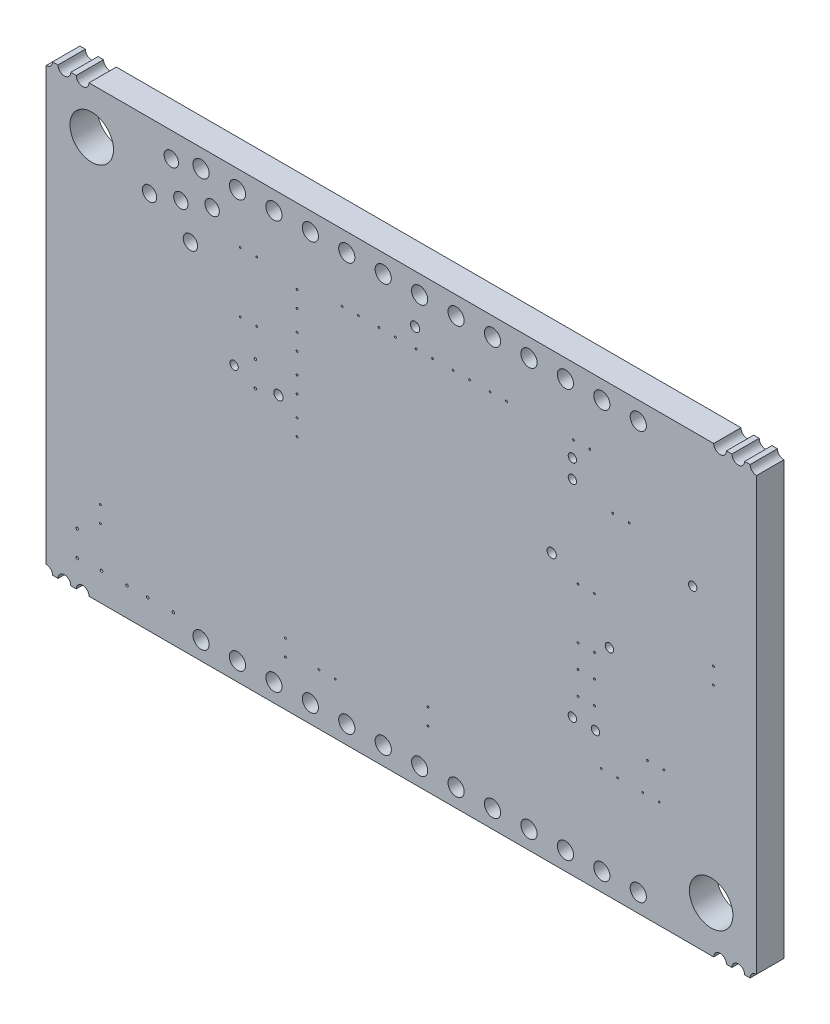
ISO-10303-21;
HEADER;
FILE_DESCRIPTION(('STEP AP214'),'2;1');
FILE_NAME('part.step','',(''),(''),'','','');
FILE_SCHEMA(('AUTOMOTIVE_DESIGN { 1 0 10303 214 1 1 1 1 }'));
ENDSEC;
DATA;
#1=APPLICATION_CONTEXT('core data for automotive mechanical design processes');
#2=APPLICATION_PROTOCOL_DEFINITION('international standard','automotive_design',2000,#1);
#3=PRODUCT_CONTEXT('',#1,'mechanical');
#4=PRODUCT('Part','Part','',(#3));
#5=PRODUCT_RELATED_PRODUCT_CATEGORY('part','',(#4));
#6=PRODUCT_DEFINITION_FORMATION('','',#4);
#7=PRODUCT_DEFINITION_CONTEXT('part definition',#1,'design');
#8=PRODUCT_DEFINITION('design','',#6,#7);
#9=PRODUCT_DEFINITION_SHAPE('','',#8);
#10=(LENGTH_UNIT() NAMED_UNIT(*) SI_UNIT(.MILLI.,.METRE.));
#11=(NAMED_UNIT(*) PLANE_ANGLE_UNIT() SI_UNIT($,.RADIAN.));
#12=(NAMED_UNIT(*) SI_UNIT($,.STERADIAN.) SOLID_ANGLE_UNIT());
#13=UNCERTAINTY_MEASURE_WITH_UNIT(LENGTH_MEASURE(1.E-05),#10,'distance_accuracy_value','');
#14=(GEOMETRIC_REPRESENTATION_CONTEXT(3) GLOBAL_UNCERTAINTY_ASSIGNED_CONTEXT((#13)) GLOBAL_UNIT_ASSIGNED_CONTEXT((#10,
#11,#12)) REPRESENTATION_CONTEXT('',''));
#15=CARTESIAN_POINT('',(0.,0.,0.));
#16=DIRECTION('',(0.,0.,1.));
#17=DIRECTION('',(1.,0.,0.));
#18=AXIS2_PLACEMENT_3D('',#15,#16,#17);
#19=CARTESIAN_POINT('',(36.488878,-21.89988,1.5));
#20=DIRECTION('',(0.,1.,0.));
#21=DIRECTION('',(0.,0.,1.));
#22=AXIS2_PLACEMENT_3D('',#19,#20,#21);
#23=PLANE('',#22);
#24=DIRECTION('',(1.,0.,0.));
#25=VECTOR('',#24,1.);
#26=CARTESIAN_POINT('',(36.488878,-21.89988,0.));
#27=LINE('',#26,#25);
#28=CARTESIAN_POINT('',(-1.150122,-21.89988,0.));
#29=VERTEX_POINT('',#28);
#30=CARTESIAN_POINT('',(-0.850121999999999,-21.89988,0.));
#31=VERTEX_POINT('',#30);
#32=EDGE_CURVE('E289',#29,#31,#27,.T.);
#33=ORIENTED_EDGE('',*,*,#32,.T.);
#34=DIRECTION('',(0.,0.,1.));
#35=VECTOR('',#34,1.);
#36=CARTESIAN_POINT('',(-0.850121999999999,-21.89988,-0.000999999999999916));
#37=LINE('',#36,#35);
#38=CARTESIAN_POINT('',(-0.850122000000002,-21.89988,1.5));
#39=VERTEX_POINT('',#38);
#40=EDGE_CURVE('E130',#39,#31,#37,.F.);
#41=ORIENTED_EDGE('',*,*,#40,.F.);
#42=DIRECTION('',(1.,0.,0.));
#43=VECTOR('',#42,1.);
#44=CARTESIAN_POINT('',(36.488878,-21.89988,1.5));
#45=LINE('',#44,#43);
#46=CARTESIAN_POINT('',(-1.150122,-21.89988,1.5));
#47=VERTEX_POINT('',#46);
#48=EDGE_CURVE('E287',#47,#39,#45,.T.);
#49=ORIENTED_EDGE('',*,*,#48,.F.);
#50=DIRECTION('',(0.,0.,1.));
#51=VECTOR('',#50,1.);
#52=CARTESIAN_POINT('',(-1.150122,-21.89988,-0.000999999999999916));
#53=LINE('',#52,#51);
#54=EDGE_CURVE('E1024',#29,#47,#53,.T.);
#55=ORIENTED_EDGE('',*,*,#54,.F.);
#56=EDGE_LOOP('',(#33,#41,#49,#55));
#57=FACE_BOUND('',#56,.T.);
#58=ADVANCED_FACE('F112',(#57),#23,.F.);
#59=CARTESIAN_POINT('',(-2.500122,2.50952,1.5));
#60=DIRECTION('',(0.,-1.,0.));
#61=DIRECTION('',(0.,0.,-1.));
#62=AXIS2_PLACEMENT_3D('',#59,#60,#61);
#63=PLANE('',#62);
#64=DIRECTION('',(-1.,0.,0.));
#65=VECTOR('',#64,1.);
#66=CARTESIAN_POINT('',(-2.500122,2.50952,0.));
#67=LINE('',#66,#65);
#68=CARTESIAN_POINT('',(34.138878,2.50952,0.));
#69=VERTEX_POINT('',#68);
#70=CARTESIAN_POINT('',(-0.150122,2.50952,0.));
#71=VERTEX_POINT('',#70);
#72=EDGE_CURVE('E1066',#69,#71,#67,.T.);
#73=ORIENTED_EDGE('',*,*,#72,.T.);
#74=DIRECTION('',(0.,0.,1.));
#75=VECTOR('',#74,1.);
#76=CARTESIAN_POINT('',(-0.150122,2.50952,-0.000999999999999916));
#77=LINE('',#76,#75);
#78=CARTESIAN_POINT('',(-0.150122,2.50952,1.5));
#79=VERTEX_POINT('',#78);
#80=EDGE_CURVE('E138',#79,#71,#77,.F.);
#81=ORIENTED_EDGE('',*,*,#80,.F.);
#82=DIRECTION('',(-1.,0.,0.));
#83=VECTOR('',#82,1.);
#84=CARTESIAN_POINT('',(-2.500122,2.50952,1.5));
#85=LINE('',#84,#83);
#86=CARTESIAN_POINT('',(34.138878,2.50952,1.5));
#87=VERTEX_POINT('',#86);
#88=EDGE_CURVE('E1090',#87,#79,#85,.T.);
#89=ORIENTED_EDGE('',*,*,#88,.F.);
#90=DIRECTION('',(0.,0.,1.));
#91=VECTOR('',#90,1.);
#92=CARTESIAN_POINT('',(34.138878,2.50952,-0.000999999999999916));
#93=LINE('',#92,#91);
#94=EDGE_CURVE('E974',#69,#87,#93,.T.);
#95=ORIENTED_EDGE('',*,*,#94,.F.);
#96=EDGE_LOOP('',(#73,#81,#89,#95));
#97=FACE_BOUND('',#96,.T.);
#98=ADVANCED_FACE('F1088',(#97),#63,.F.);
#99=CARTESIAN_POINT('',(-2.150122,-21.89988,0.));
#100=VERTEX_POINT('',#99);
#101=CARTESIAN_POINT('',(-1.850122,-21.89988,0.));
#102=VERTEX_POINT('',#101);
#103=EDGE_CURVE('E1053',#100,#102,#27,.T.);
#104=ORIENTED_EDGE('',*,*,#103,.T.);
#105=DIRECTION('',(0.,0.,1.));
#106=VECTOR('',#105,1.);
#107=CARTESIAN_POINT('',(-1.850122,-21.89988,-0.000999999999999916));
#108=LINE('',#107,#106);
#109=CARTESIAN_POINT('',(-1.850122,-21.89988,1.5));
#110=VERTEX_POINT('',#109);
#111=EDGE_CURVE('E1022',#110,#102,#108,.F.);
#112=ORIENTED_EDGE('',*,*,#111,.F.);
#113=CARTESIAN_POINT('',(-2.150122,-21.89988,1.5));
#114=VERTEX_POINT('',#113);
#115=EDGE_CURVE('E296',#114,#110,#45,.T.);
#116=ORIENTED_EDGE('',*,*,#115,.F.);
#117=DIRECTION('',(0.,0.,1.));
#118=VECTOR('',#117,1.);
#119=CARTESIAN_POINT('',(-2.150122,-21.89988,-0.000999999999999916));
#120=LINE('',#119,#118);
#121=EDGE_CURVE('E1003',#100,#114,#120,.T.);
#122=ORIENTED_EDGE('',*,*,#121,.F.);
#123=EDGE_LOOP('',(#104,#112,#116,#122));
#124=FACE_BOUND('',#123,.T.);
#125=ADVANCED_FACE('F1115',(#124),#23,.F.);
#126=CARTESIAN_POINT('',(-0.850121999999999,2.50952,1.5));
#127=VERTEX_POINT('',#126);
#128=CARTESIAN_POINT('',(-1.150122,2.50952,1.5));
#129=VERTEX_POINT('',#128);
#130=EDGE_CURVE('E123',#127,#129,#85,.T.);
#131=ORIENTED_EDGE('',*,*,#130,.F.);
#132=DIRECTION('',(0.,0.,1.));
#133=VECTOR('',#132,1.);
#134=CARTESIAN_POINT('',(-0.850121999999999,2.50952,-0.000999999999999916));
#135=LINE('',#134,#133);
#136=CARTESIAN_POINT('',(-0.850121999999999,2.50952,0.));
#137=VERTEX_POINT('',#136);
#138=EDGE_CURVE('E1031',#137,#127,#135,.T.);
#139=ORIENTED_EDGE('',*,*,#138,.F.);
#140=CARTESIAN_POINT('',(-1.150122,2.50952,0.));
#141=VERTEX_POINT('',#140);
#142=EDGE_CURVE('E318',#137,#141,#67,.T.);
#143=ORIENTED_EDGE('',*,*,#142,.T.);
#144=DIRECTION('',(0.,0.,1.));
#145=VECTOR('',#144,1.);
#146=CARTESIAN_POINT('',(-1.150122,2.50952,-0.000999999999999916));
#147=LINE('',#146,#145);
#148=EDGE_CURVE('E1013',#129,#141,#147,.F.);
#149=ORIENTED_EDGE('',*,*,#148,.F.);
#150=EDGE_LOOP('',(#131,#139,#143,#149));
#151=FACE_BOUND('',#150,.T.);
#152=ADVANCED_FACE('F1119',(#151),#63,.F.);
#153=CARTESIAN_POINT('',(-0.150122,-21.89988,1.5));
#154=VERTEX_POINT('',#153);
#155=CARTESIAN_POINT('',(34.138878,-21.89988,1.5));
#156=VERTEX_POINT('',#155);
#157=EDGE_CURVE('E297',#154,#156,#45,.T.);
#158=ORIENTED_EDGE('',*,*,#157,.F.);
#159=DIRECTION('',(0.,0.,1.));
#160=VECTOR('',#159,1.);
#161=CARTESIAN_POINT('',(-0.150122,-21.89988,-0.000999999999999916));
#162=LINE('',#161,#160);
#163=CARTESIAN_POINT('',(-0.150122,-21.89988,0.));
#164=VERTEX_POINT('',#163);
#165=EDGE_CURVE('E277',#164,#154,#162,.T.);
#166=ORIENTED_EDGE('',*,*,#165,.F.);
#167=CARTESIAN_POINT('',(34.138878,-21.89988,0.));
#168=VERTEX_POINT('',#167);
#169=EDGE_CURVE('E1038',#164,#168,#27,.T.);
#170=ORIENTED_EDGE('',*,*,#169,.T.);
#171=DIRECTION('',(0.,0.,1.));
#172=VECTOR('',#171,1.);
#173=CARTESIAN_POINT('',(34.138878,-21.89988,-0.000999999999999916));
#174=LINE('',#173,#172);
#175=EDGE_CURVE('E982',#156,#168,#174,.F.);
#176=ORIENTED_EDGE('',*,*,#175,.F.);
#177=EDGE_LOOP('',(#158,#166,#170,#176));
#178=FACE_BOUND('',#177,.T.);
#179=ADVANCED_FACE('F1040',(#178),#23,.F.);
#180=CARTESIAN_POINT('',(35.138878,2.50952,0.));
#181=VERTEX_POINT('',#180);
#182=CARTESIAN_POINT('',(34.838878,2.50952,0.));
#183=VERTEX_POINT('',#182);
#184=EDGE_CURVE('E317',#181,#183,#67,.T.);
#185=ORIENTED_EDGE('',*,*,#184,.T.);
#186=DIRECTION('',(0.,0.,1.));
#187=VECTOR('',#186,1.);
#188=CARTESIAN_POINT('',(34.838878,2.50952,-0.000999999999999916));
#189=LINE('',#188,#187);
#190=CARTESIAN_POINT('',(34.838878,2.50952,1.5));
#191=VERTEX_POINT('',#190);
#192=EDGE_CURVE('E972',#191,#183,#189,.F.);
#193=ORIENTED_EDGE('',*,*,#192,.F.);
#194=CARTESIAN_POINT('',(35.138878,2.50952,1.5));
#195=VERTEX_POINT('',#194);
#196=EDGE_CURVE('E121',#195,#191,#85,.T.);
#197=ORIENTED_EDGE('',*,*,#196,.F.);
#198=DIRECTION('',(0.,0.,1.));
#199=VECTOR('',#198,1.);
#200=CARTESIAN_POINT('',(35.138878,2.50952,-0.000999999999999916));
#201=LINE('',#200,#199);
#202=EDGE_CURVE('E955',#181,#195,#201,.T.);
#203=ORIENTED_EDGE('',*,*,#202,.F.);
#204=EDGE_LOOP('',(#185,#193,#197,#203));
#205=FACE_BOUND('',#204,.T.);
#206=ADVANCED_FACE('F1080',(#205),#63,.F.);
#207=CARTESIAN_POINT('',(34.838878,-21.89988,1.5));
#208=VERTEX_POINT('',#207);
#209=CARTESIAN_POINT('',(35.138878,-21.89988,1.5));
#210=VERTEX_POINT('',#209);
#211=EDGE_CURVE('E299',#208,#210,#45,.T.);
#212=ORIENTED_EDGE('',*,*,#211,.F.);
#213=DIRECTION('',(0.,0.,1.));
#214=VECTOR('',#213,1.);
#215=CARTESIAN_POINT('',(34.838878,-21.89988,-0.000999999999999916));
#216=LINE('',#215,#214);
#217=CARTESIAN_POINT('',(34.838878,-21.89988,0.));
#218=VERTEX_POINT('',#217);
#219=EDGE_CURVE('E985',#218,#208,#216,.T.);
#220=ORIENTED_EDGE('',*,*,#219,.F.);
#221=CARTESIAN_POINT('',(35.138878,-21.89988,0.));
#222=VERTEX_POINT('',#221);
#223=EDGE_CURVE('E1049',#218,#222,#27,.T.);
#224=ORIENTED_EDGE('',*,*,#223,.T.);
#225=DIRECTION('',(0.,0.,1.));
#226=VECTOR('',#225,1.);
#227=CARTESIAN_POINT('',(35.138878,-21.89988,-0.000999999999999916));
#228=LINE('',#227,#226);
#229=EDGE_CURVE('E962',#210,#222,#228,.F.);
#230=ORIENTED_EDGE('',*,*,#229,.F.);
#231=EDGE_LOOP('',(#212,#220,#224,#230));
#232=FACE_BOUND('',#231,.T.);
#233=ADVANCED_FACE('F1047',(#232),#23,.F.);
#234=CARTESIAN_POINT('',(36.138878,2.50952,0.));
#235=VERTEX_POINT('',#234);
#236=CARTESIAN_POINT('',(35.838878,2.50952,0.));
#237=VERTEX_POINT('',#236);
#238=EDGE_CURVE('E116',#235,#237,#67,.T.);
#239=ORIENTED_EDGE('',*,*,#238,.T.);
#240=DIRECTION('',(0.,0.,1.));
#241=VECTOR('',#240,1.);
#242=CARTESIAN_POINT('',(35.838878,2.50952,-0.000999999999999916));
#243=LINE('',#242,#241);
#244=CARTESIAN_POINT('',(35.838878,2.50952,1.5));
#245=VERTEX_POINT('',#244);
#246=EDGE_CURVE('E953',#245,#237,#243,.F.);
#247=ORIENTED_EDGE('',*,*,#246,.F.);
#248=CARTESIAN_POINT('',(36.138878,2.50952,1.5));
#249=VERTEX_POINT('',#248);
#250=EDGE_CURVE('E14',#249,#245,#85,.T.);
#251=ORIENTED_EDGE('',*,*,#250,.F.);
#252=DIRECTION('',(0.,0.,1.));
#253=VECTOR('',#252,1.);
#254=CARTESIAN_POINT('',(36.138878,2.50952,-0.000999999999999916));
#255=LINE('',#254,#253);
#256=EDGE_CURVE('E936',#235,#249,#255,.T.);
#257=ORIENTED_EDGE('',*,*,#256,.F.);
#258=EDGE_LOOP('',(#239,#247,#251,#257));
#259=FACE_BOUND('',#258,.T.);
#260=ADVANCED_FACE('F1112',(#259),#63,.F.);
#261=CARTESIAN_POINT('',(0.,0.,1.5));
#262=DIRECTION('',(0.,0.,-1.));
#263=DIRECTION('',(-1.,0.,0.));
#264=AXIS2_PLACEMENT_3D('',#261,#262,#263);
#265=PLANE('',#264);
#266=CARTESIAN_POINT('',(5.99996,1.500124,1.5));
#267=DIRECTION('',(0.,0.,1.));
#268=DIRECTION('',(1.,0.,0.));
#269=AXIS2_PLACEMENT_3D('',#266,#267,#268);
#270=CIRCLE('',#269,0.4445);
#271=CARTESIAN_POINT('',(6.44446,1.500124,1.5));
#272=VERTEX_POINT('',#271);
#273=EDGE_CURVE('E913',#272,#272,#270,.T.);
#274=ORIENTED_EDGE('',*,*,#273,.F.);
#275=EDGE_LOOP('',(#274));
#276=FACE_BOUND('',#275,.T.);
#277=CARTESIAN_POINT('',(5.99996,-20.899876,1.5));
#278=DIRECTION('',(0.,0.,1.));
#279=DIRECTION('',(1.,0.,0.));
#280=AXIS2_PLACEMENT_3D('',#277,#278,#279);
#281=CIRCLE('',#280,0.4445);
#282=CARTESIAN_POINT('',(6.44446,-20.899876,1.5));
#283=VERTEX_POINT('',#282);
#284=EDGE_CURVE('E901',#283,#283,#281,.T.);
#285=ORIENTED_EDGE('',*,*,#284,.F.);
#286=EDGE_LOOP('',(#285));
#287=FACE_BOUND('',#286,.T.);
#288=CARTESIAN_POINT('',(28.41496,-10.056876,1.5));
#289=DIRECTION('',(0.,0.,1.));
#290=DIRECTION('',(1.,0.,0.));
#291=AXIS2_PLACEMENT_3D('',#288,#289,#290);
#292=CIRCLE('',#291,0.228599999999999);
#293=CARTESIAN_POINT('',(28.64356,-10.056876,1.5));
#294=VERTEX_POINT('',#293);
#295=EDGE_CURVE('E889',#294,#294,#292,.T.);
#296=ORIENTED_EDGE('',*,*,#295,.F.);
#297=EDGE_LOOP('',(#296));
#298=FACE_BOUND('',#297,.T.);
#299=CARTESIAN_POINT('',(26.38296,-14.374876,1.5));
#300=DIRECTION('',(0.,0.,1.));
#301=DIRECTION('',(1.,0.,0.));
#302=AXIS2_PLACEMENT_3D('',#299,#300,#301);
#303=CIRCLE('',#302,0.228599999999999);
#304=CARTESIAN_POINT('',(26.61156,-14.374876,1.5));
#305=VERTEX_POINT('',#304);
#306=EDGE_CURVE('E877',#305,#305,#303,.T.);
#307=ORIENTED_EDGE('',*,*,#306,.F.);
#308=EDGE_LOOP('',(#307));
#309=FACE_BOUND('',#308,.T.);
#310=CARTESIAN_POINT('',(27.65296,-14.374876,1.5));
#311=DIRECTION('',(0.,0.,1.));
#312=DIRECTION('',(1.,0.,0.));
#313=AXIS2_PLACEMENT_3D('',#310,#311,#312);
#314=CIRCLE('',#313,0.228599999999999);
#315=CARTESIAN_POINT('',(27.88156,-14.374876,1.5));
#316=VERTEX_POINT('',#315);
#317=EDGE_CURVE('E865',#316,#316,#314,.T.);
#318=ORIENTED_EDGE('',*,*,#317,.F.);
#319=EDGE_LOOP('',(#318));
#320=FACE_BOUND('',#319,.T.);
#321=CARTESIAN_POINT('',(3.07696,-20.343876,1.5));
#322=DIRECTION('',(0.,0.,1.));
#323=DIRECTION('',(1.,0.,0.));
#324=AXIS2_PLACEMENT_3D('',#321,#322,#323);
#325=CIRCLE('',#324,0.0700000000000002);
#326=CARTESIAN_POINT('',(3.14696,-20.343876,1.5));
#327=VERTEX_POINT('',#326);
#328=EDGE_CURVE('E853',#327,#327,#325,.T.);
#329=ORIENTED_EDGE('',*,*,#328,.F.);
#330=EDGE_LOOP('',(#329));
#331=FACE_BOUND('',#330,.T.);
#332=CARTESIAN_POINT('',(0.53696,-20.343876,1.5));
#333=DIRECTION('',(0.,0.,1.));
#334=DIRECTION('',(1.,0.,0.));
#335=AXIS2_PLACEMENT_3D('',#332,#333,#334);
#336=CIRCLE('',#335,0.07);
#337=CARTESIAN_POINT('',(0.60696,-20.343876,1.5));
#338=VERTEX_POINT('',#337);
#339=EDGE_CURVE('E841',#338,#338,#336,.T.);
#340=ORIENTED_EDGE('',*,*,#339,.F.);
#341=EDGE_LOOP('',(#340));
#342=FACE_BOUND('',#341,.T.);
#343=CARTESIAN_POINT('',(-0.79504,-19.008876,1.5));
#344=DIRECTION('',(0.,0.,1.));
#345=DIRECTION('',(1.,0.,0.));
#346=AXIS2_PLACEMENT_3D('',#343,#344,#345);
#347=CIRCLE('',#346,0.07);
#348=CARTESIAN_POINT('',(-0.72504,-19.008876,1.5));
#349=VERTEX_POINT('',#348);
#350=EDGE_CURVE('E829',#349,#349,#347,.T.);
#351=ORIENTED_EDGE('',*,*,#350,.F.);
#352=EDGE_LOOP('',(#351));
#353=FACE_BOUND('',#352,.T.);
#354=CARTESIAN_POINT('',(8.98396,-6.054876,1.5));
#355=DIRECTION('',(0.,0.,1.));
#356=DIRECTION('',(1.,0.,0.));
#357=AXIS2_PLACEMENT_3D('',#354,#355,#356);
#358=CIRCLE('',#357,0.0700000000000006);
#359=CARTESIAN_POINT('',(9.05396,-6.054876,1.5));
#360=VERTEX_POINT('',#359);
#361=EDGE_CURVE('E817',#360,#360,#358,.T.);
#362=ORIENTED_EDGE('',*,*,#361,.F.);
#363=EDGE_LOOP('',(#362));
#364=FACE_BOUND('',#363,.T.);
#365=CARTESIAN_POINT('',(18.45816,-18.761876,1.5));
#366=DIRECTION('',(0.,0.,1.));
#367=DIRECTION('',(1.,0.,0.));
#368=AXIS2_PLACEMENT_3D('',#365,#366,#367);
#369=CIRCLE('',#368,0.0500000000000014);
#370=CARTESIAN_POINT('',(18.50816,-18.761876,1.5));
#371=VERTEX_POINT('',#370);
#372=EDGE_CURVE('E805',#371,#371,#369,.T.);
#373=ORIENTED_EDGE('',*,*,#372,.F.);
#374=EDGE_LOOP('',(#373));
#375=FACE_BOUND('',#374,.T.);
#376=CARTESIAN_POINT('',(13.37096,-19.073876,1.5));
#377=DIRECTION('',(0.,0.,1.));
#378=DIRECTION('',(1.,0.,0.));
#379=AXIS2_PLACEMENT_3D('',#376,#377,#378);
#380=CIRCLE('',#379,0.0499999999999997);
#381=CARTESIAN_POINT('',(13.42096,-19.073876,1.5));
#382=VERTEX_POINT('',#381);
#383=EDGE_CURVE('E793',#382,#382,#380,.T.);
#384=ORIENTED_EDGE('',*,*,#383,.F.);
#385=EDGE_LOOP('',(#384));
#386=FACE_BOUND('',#385,.T.);
#387=CARTESIAN_POINT('',(9.05296,-1.166876,1.5));
#388=DIRECTION('',(0.,0.,1.));
#389=DIRECTION('',(1.,0.,0.));
#390=AXIS2_PLACEMENT_3D('',#387,#388,#389);
#391=CIRCLE('',#390,0.0499999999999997);
#392=CARTESIAN_POINT('',(9.10296,-1.166876,1.5));
#393=VERTEX_POINT('',#392);
#394=EDGE_CURVE('E781',#393,#393,#391,.T.);
#395=ORIENTED_EDGE('',*,*,#394,.F.);
#396=EDGE_LOOP('',(#395));
#397=FACE_BOUND('',#396,.T.);
#398=CARTESIAN_POINT('',(10.63496,-19.396876,1.5));
#399=DIRECTION('',(0.,0.,1.));
#400=DIRECTION('',(1.,0.,0.));
#401=AXIS2_PLACEMENT_3D('',#398,#399,#400);
#402=CIRCLE('',#401,0.0499999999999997);
#403=CARTESIAN_POINT('',(10.68496,-19.396876,1.5));
#404=VERTEX_POINT('',#403);
#405=EDGE_CURVE('E769',#404,#404,#402,.T.);
#406=ORIENTED_EDGE('',*,*,#405,.F.);
#407=EDGE_LOOP('',(#406));
#408=FACE_BOUND('',#407,.T.);
#409=CARTESIAN_POINT('',(27.59496,-11.961876,1.5));
#410=DIRECTION('',(0.,0.,1.));
#411=DIRECTION('',(1.,0.,0.));
#412=AXIS2_PLACEMENT_3D('',#409,#410,#411);
#413=CIRCLE('',#412,0.0500000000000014);
#414=CARTESIAN_POINT('',(27.64496,-11.961876,1.5));
#415=VERTEX_POINT('',#414);
#416=EDGE_CURVE('E757',#415,#415,#413,.T.);
#417=ORIENTED_EDGE('',*,*,#416,.F.);
#418=EDGE_LOOP('',(#417));
#419=FACE_BOUND('',#418,.T.);
#420=CARTESIAN_POINT('',(27.59496,-13.231876,1.5));
#421=DIRECTION('',(0.,0.,1.));
#422=DIRECTION('',(1.,0.,0.));
#423=AXIS2_PLACEMENT_3D('',#420,#421,#422);
#424=CIRCLE('',#423,0.0500000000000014);
#425=CARTESIAN_POINT('',(27.64496,-13.231876,1.5));
#426=VERTEX_POINT('',#425);
#427=EDGE_CURVE('E745',#426,#426,#424,.T.);
#428=ORIENTED_EDGE('',*,*,#427,.F.);
#429=EDGE_LOOP('',(#428));
#430=FACE_BOUND('',#429,.T.);
#431=CARTESIAN_POINT('',(30.25096,-16.025876,1.5));
#432=DIRECTION('',(0.,0.,1.));
#433=DIRECTION('',(1.,0.,0.));
#434=AXIS2_PLACEMENT_3D('',#431,#432,#433);
#435=CIRCLE('',#434,0.0500000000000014);
#436=CARTESIAN_POINT('',(30.30096,-16.025876,1.5));
#437=VERTEX_POINT('',#436);
#438=EDGE_CURVE('E733',#437,#437,#435,.T.);
#439=ORIENTED_EDGE('',*,*,#438,.F.);
#440=EDGE_LOOP('',(#439));
#441=FACE_BOUND('',#440,.T.);
#442=CARTESIAN_POINT('',(29.49996,-3.579876,1.5));
#443=DIRECTION('',(0.,0.,1.));
#444=DIRECTION('',(1.,0.,0.));
#445=AXIS2_PLACEMENT_3D('',#442,#443,#444);
#446=CIRCLE('',#445,0.0500000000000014);
#447=CARTESIAN_POINT('',(29.54996,-3.579876,1.5));
#448=VERTEX_POINT('',#447);
#449=EDGE_CURVE('E721',#448,#448,#446,.T.);
#450=ORIENTED_EDGE('',*,*,#449,.F.);
#451=EDGE_LOOP('',(#450));
#452=FACE_BOUND('',#451,.T.);
#453=CARTESIAN_POINT('',(31.40496,-14.374876,1.5));
#454=DIRECTION('',(0.,0.,1.));
#455=DIRECTION('',(1.,0.,0.));
#456=AXIS2_PLACEMENT_3D('',#453,#454,#455);
#457=CIRCLE('',#456,0.0500000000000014);
#458=CARTESIAN_POINT('',(31.45496,-14.374876,1.5));
#459=VERTEX_POINT('',#458);
#460=EDGE_CURVE('E709',#459,#459,#457,.T.);
#461=ORIENTED_EDGE('',*,*,#460,.F.);
#462=EDGE_LOOP('',(#461));
#463=FACE_BOUND('',#462,.T.);
#464=CARTESIAN_POINT('',(26.69496,-7.897876,1.5));
#465=DIRECTION('',(0.,0.,1.));
#466=DIRECTION('',(1.,0.,0.));
#467=AXIS2_PLACEMENT_3D('',#464,#465,#466);
#468=CIRCLE('',#467,0.0500000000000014);
#469=CARTESIAN_POINT('',(26.74496,-7.897876,1.5));
#470=VERTEX_POINT('',#469);
#471=EDGE_CURVE('E697',#470,#470,#468,.T.);
#472=ORIENTED_EDGE('',*,*,#471,.F.);
#473=EDGE_LOOP('',(#472));
#474=FACE_BOUND('',#473,.T.);
#475=CARTESIAN_POINT('',(34.12996,-8.082876,1.5));
#476=DIRECTION('',(0.,0.,1.));
#477=DIRECTION('',(1.,0.,0.));
#478=AXIS2_PLACEMENT_3D('',#475,#476,#477);
#479=CIRCLE('',#478,0.0500000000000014);
#480=CARTESIAN_POINT('',(34.17996,-8.082876,1.5));
#481=VERTEX_POINT('',#480);
#482=EDGE_CURVE('E685',#481,#481,#479,.T.);
#483=ORIENTED_EDGE('',*,*,#482,.F.);
#484=EDGE_LOOP('',(#483));
#485=FACE_BOUND('',#484,.T.);
#486=CARTESIAN_POINT('',(9.05296,-4.468876,1.5));
#487=DIRECTION('',(0.,0.,1.));
#488=DIRECTION('',(1.,0.,0.));
#489=AXIS2_PLACEMENT_3D('',#486,#487,#488);
#490=CIRCLE('',#489,0.0499999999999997);
#491=CARTESIAN_POINT('',(9.10296,-4.468876,1.5));
#492=VERTEX_POINT('',#491);
#493=EDGE_CURVE('E673',#492,#492,#490,.T.);
#494=ORIENTED_EDGE('',*,*,#493,.F.);
#495=EDGE_LOOP('',(#494));
#496=FACE_BOUND('',#495,.T.);
#497=CARTESIAN_POINT('',(0.47496,-17.226876,1.5));
#498=DIRECTION('',(0.,0.,1.));
#499=DIRECTION('',(1.,0.,0.));
#500=AXIS2_PLACEMENT_3D('',#497,#498,#499);
#501=CIRCLE('',#500,0.05);
#502=CARTESIAN_POINT('',(0.52496,-17.226876,1.5));
#503=VERTEX_POINT('',#502);
#504=EDGE_CURVE('E661',#503,#503,#501,.T.);
#505=ORIENTED_EDGE('',*,*,#504,.F.);
#506=EDGE_LOOP('',(#505));
#507=FACE_BOUND('',#506,.T.);
#508=CARTESIAN_POINT('',(27.34096,-1.166876,1.5));
#509=DIRECTION('',(0.,0.,1.));
#510=DIRECTION('',(1.,0.,0.));
#511=AXIS2_PLACEMENT_3D('',#508,#509,#510);
#512=CIRCLE('',#511,0.0500000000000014);
#513=CARTESIAN_POINT('',(27.39096,-1.166876,1.5));
#514=VERTEX_POINT('',#513);
#515=EDGE_CURVE('E649',#514,#514,#512,.T.);
#516=ORIENTED_EDGE('',*,*,#515,.F.);
#517=EDGE_LOOP('',(#516));
#518=FACE_BOUND('',#517,.T.);
#519=CARTESIAN_POINT('',(11.26996,-8.601876,1.5));
#520=DIRECTION('',(0.,0.,1.));
#521=DIRECTION('',(1.,0.,0.));
#522=AXIS2_PLACEMENT_3D('',#519,#520,#521);
#523=CIRCLE('',#522,0.0499999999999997);
#524=CARTESIAN_POINT('',(11.31996,-8.601876,1.5));
#525=VERTEX_POINT('',#524);
#526=EDGE_CURVE('E637',#525,#525,#523,.T.);
#527=ORIENTED_EDGE('',*,*,#526,.F.);
#528=EDGE_LOOP('',(#527));
#529=FACE_BOUND('',#528,.T.);
#530=CARTESIAN_POINT('',(20.73696,-1.166876,1.5));
#531=DIRECTION('',(0.,0.,1.));
#532=DIRECTION('',(1.,0.,0.));
#533=AXIS2_PLACEMENT_3D('',#530,#531,#532);
#534=CIRCLE('',#533,0.0500000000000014);
#535=CARTESIAN_POINT('',(20.78696,-1.166876,1.5));
#536=VERTEX_POINT('',#535);
#537=EDGE_CURVE('E625',#536,#536,#534,.T.);
#538=ORIENTED_EDGE('',*,*,#537,.F.);
#539=EDGE_LOOP('',(#538));
#540=FACE_BOUND('',#539,.T.);
#541=CARTESIAN_POINT('',(22.76896,-1.166876,1.5));
#542=DIRECTION('',(0.,0.,1.));
#543=DIRECTION('',(1.,0.,0.));
#544=AXIS2_PLACEMENT_3D('',#541,#542,#543);
#545=CIRCLE('',#544,0.0500000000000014);
#546=CARTESIAN_POINT('',(22.81896,-1.166876,1.5));
#547=VERTEX_POINT('',#546);
#548=EDGE_CURVE('E613',#547,#547,#545,.T.);
#549=ORIENTED_EDGE('',*,*,#548,.F.);
#550=EDGE_LOOP('',(#549));
#551=FACE_BOUND('',#550,.T.);
#552=CARTESIAN_POINT('',(11.26996,-6.569876,1.5));
#553=DIRECTION('',(0.,0.,1.));
#554=DIRECTION('',(1.,0.,0.));
#555=AXIS2_PLACEMENT_3D('',#552,#553,#554);
#556=CIRCLE('',#555,0.0499999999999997);
#557=CARTESIAN_POINT('',(11.31996,-6.569876,1.5));
#558=VERTEX_POINT('',#557);
#559=EDGE_CURVE('E601',#558,#558,#556,.T.);
#560=ORIENTED_EDGE('',*,*,#559,.F.);
#561=EDGE_LOOP('',(#560));
#562=FACE_BOUND('',#561,.T.);
#563=CARTESIAN_POINT('',(18.70496,-1.166876,1.5));
#564=DIRECTION('',(0.,0.,1.));
#565=DIRECTION('',(1.,0.,0.));
#566=AXIS2_PLACEMENT_3D('',#563,#564,#565);
#567=CIRCLE('',#566,0.0500000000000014);
#568=CARTESIAN_POINT('',(18.75496,-1.166876,1.5));
#569=VERTEX_POINT('',#568);
#570=EDGE_CURVE('E589',#569,#569,#567,.T.);
#571=ORIENTED_EDGE('',*,*,#570,.F.);
#572=EDGE_LOOP('',(#571));
#573=FACE_BOUND('',#572,.T.);
#574=CARTESIAN_POINT('',(16.67296,-1.166876,1.5));
#575=DIRECTION('',(0.,0.,1.));
#576=DIRECTION('',(1.,0.,0.));
#577=AXIS2_PLACEMENT_3D('',#574,#575,#576);
#578=CIRCLE('',#577,0.0500000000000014);
#579=CARTESIAN_POINT('',(16.72296,-1.166876,1.5));
#580=VERTEX_POINT('',#579);
#581=EDGE_CURVE('E577',#580,#580,#578,.T.);
#582=ORIENTED_EDGE('',*,*,#581,.F.);
#583=EDGE_LOOP('',(#582));
#584=FACE_BOUND('',#583,.T.);
#585=CARTESIAN_POINT('',(13.74096,-1.166876,1.5));
#586=DIRECTION('',(0.,0.,1.));
#587=DIRECTION('',(1.,0.,0.));
#588=AXIS2_PLACEMENT_3D('',#585,#586,#587);
#589=CIRCLE('',#588,0.0499999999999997);
#590=CARTESIAN_POINT('',(13.79096,-1.166876,1.5));
#591=VERTEX_POINT('',#590);
#592=EDGE_CURVE('E565',#591,#591,#589,.T.);
#593=ORIENTED_EDGE('',*,*,#592,.F.);
#594=EDGE_LOOP('',(#593));
#595=FACE_BOUND('',#594,.T.);
#596=CARTESIAN_POINT('',(27.96496,-16.025876,1.5));
#597=DIRECTION('',(0.,0.,1.));
#598=DIRECTION('',(1.,0.,0.));
#599=AXIS2_PLACEMENT_3D('',#596,#597,#598);
#600=CIRCLE('',#599,0.0500000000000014);
#601=CARTESIAN_POINT('',(28.01496,-16.025876,1.5));
#602=VERTEX_POINT('',#601);
#603=EDGE_CURVE('E553',#602,#602,#600,.T.);
#604=ORIENTED_EDGE('',*,*,#603,.F.);
#605=EDGE_LOOP('',(#604));
#606=FACE_BOUND('',#605,.T.);
#607=CARTESIAN_POINT('',(11.26996,-4.537876,1.5));
#608=DIRECTION('',(0.,0.,1.));
#609=DIRECTION('',(1.,0.,0.));
#610=AXIS2_PLACEMENT_3D('',#607,#608,#609);
#611=CIRCLE('',#610,0.0499999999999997);
#612=CARTESIAN_POINT('',(11.31996,-4.537876,1.5));
#613=VERTEX_POINT('',#612);
#614=EDGE_CURVE('E541',#613,#613,#611,.T.);
#615=ORIENTED_EDGE('',*,*,#614,.F.);
#616=EDGE_LOOP('',(#615));
#617=FACE_BOUND('',#616,.T.);
#618=CARTESIAN_POINT('',(11.26996,-2.505876,1.5));
#619=DIRECTION('',(0.,0.,1.));
#620=DIRECTION('',(1.,0.,0.));
#621=AXIS2_PLACEMENT_3D('',#618,#619,#620);
#622=CIRCLE('',#621,0.0499999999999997);
#623=CARTESIAN_POINT('',(11.31996,-2.505876,1.5));
#624=VERTEX_POINT('',#623);
#625=EDGE_CURVE('E529',#624,#624,#622,.T.);
#626=ORIENTED_EDGE('',*,*,#625,.F.);
#627=EDGE_LOOP('',(#626));
#628=FACE_BOUND('',#627,.T.);
#629=CARTESIAN_POINT('',(26.69496,-10.691876,1.5));
#630=DIRECTION('',(0.,0.,1.));
#631=DIRECTION('',(1.,0.,0.));
#632=AXIS2_PLACEMENT_3D('',#629,#630,#631);
#633=CIRCLE('',#632,0.0500000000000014);
#634=CARTESIAN_POINT('',(26.74496,-10.691876,1.5));
#635=VERTEX_POINT('',#634);
#636=EDGE_CURVE('E517',#635,#635,#633,.T.);
#637=ORIENTED_EDGE('',*,*,#636,.F.);
#638=EDGE_LOOP('',(#637));
#639=FACE_BOUND('',#638,.T.);
#640=CARTESIAN_POINT('',(3.17370766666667,-1.08899054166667,1.5));
#641=DIRECTION('',(0.,0.,1.));
#642=DIRECTION('',(1.,0.,0.));
#643=AXIS2_PLACEMENT_3D('',#640,#641,#642);
#644=CIRCLE('',#643,0.3937);
#645=CARTESIAN_POINT('',(3.56740766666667,-1.08899054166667,1.5));
#646=VERTEX_POINT('',#645);
#647=EDGE_CURVE('E505',#646,#646,#644,.T.);
#648=ORIENTED_EDGE('',*,*,#647,.F.);
#649=EDGE_LOOP('',(#648));
#650=FACE_BOUND('',#649,.T.);
#651=CARTESIAN_POINT('',(4.36616545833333,1.15369633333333,1.5));
#652=DIRECTION('',(0.,0.,1.));
#653=DIRECTION('',(1.,0.,0.));
#654=AXIS2_PLACEMENT_3D('',#651,#652,#653);
#655=CIRCLE('',#654,0.3937);
#656=CARTESIAN_POINT('',(4.75986545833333,1.15369633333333,1.5));
#657=VERTEX_POINT('',#656);
#658=EDGE_CURVE('E493',#657,#657,#655,.T.);
#659=ORIENTED_EDGE('',*,*,#658,.F.);
#660=EDGE_LOOP('',(#659));
#661=FACE_BOUND('',#660,.T.);
#662=CARTESIAN_POINT('',(4.89128,-0.563876,1.5));
#663=DIRECTION('',(0.,0.,1.));
#664=DIRECTION('',(1.,0.,0.));
#665=AXIS2_PLACEMENT_3D('',#662,#663,#664);
#666=CIRCLE('',#665,0.3937);
#667=CARTESIAN_POINT('',(5.28498,-0.563876,1.5));
#668=VERTEX_POINT('',#667);
#669=EDGE_CURVE('E481',#668,#668,#666,.T.);
#670=ORIENTED_EDGE('',*,*,#669,.F.);
#671=EDGE_LOOP('',(#670));
#672=FACE_BOUND('',#671,.T.);
#673=CARTESIAN_POINT('',(33.999932,-19.399758,1.5));
#674=DIRECTION('',(0.,0.,1.));
#675=DIRECTION('',(1.,0.,0.));
#676=AXIS2_PLACEMENT_3D('',#673,#674,#675);
#677=CIRCLE('',#676,1.1938);
#678=CARTESIAN_POINT('',(35.193732,-19.399758,1.5));
#679=VERTEX_POINT('',#678);
#680=EDGE_CURVE('E469',#679,#679,#677,.T.);
#681=ORIENTED_EDGE('',*,*,#680,.F.);
#682=EDGE_LOOP('',(#681));
#683=FACE_BOUND('',#682,.T.);
#684=CARTESIAN_POINT('',(29.99996,1.500124,1.5));
#685=DIRECTION('',(0.,0.,1.));
#686=DIRECTION('',(1.,0.,0.));
#687=AXIS2_PLACEMENT_3D('',#684,#685,#686);
#688=CIRCLE('',#687,0.4445);
#689=CARTESIAN_POINT('',(30.44446,1.500124,1.5));
#690=VERTEX_POINT('',#689);
#691=EDGE_CURVE('E457',#690,#690,#688,.T.);
#692=ORIENTED_EDGE('',*,*,#691,.F.);
#693=EDGE_LOOP('',(#692));
#694=FACE_BOUND('',#693,.T.);
#695=CARTESIAN_POINT('',(25.99996,1.500124,1.5));
#696=DIRECTION('',(0.,0.,1.));
#697=DIRECTION('',(1.,0.,0.));
#698=AXIS2_PLACEMENT_3D('',#695,#696,#697);
#699=CIRCLE('',#698,0.4445);
#700=CARTESIAN_POINT('',(26.44446,1.500124,1.5));
#701=VERTEX_POINT('',#700);
#702=EDGE_CURVE('E445',#701,#701,#699,.T.);
#703=ORIENTED_EDGE('',*,*,#702,.F.);
#704=EDGE_LOOP('',(#703));
#705=FACE_BOUND('',#704,.T.);
#706=CARTESIAN_POINT('',(21.99996,1.500124,1.5));
#707=DIRECTION('',(0.,0.,1.));
#708=DIRECTION('',(1.,0.,0.));
#709=AXIS2_PLACEMENT_3D('',#706,#707,#708);
#710=CIRCLE('',#709,0.4445);
#711=CARTESIAN_POINT('',(22.44446,1.500124,1.5));
#712=VERTEX_POINT('',#711);
#713=EDGE_CURVE('E433',#712,#712,#710,.T.);
#714=ORIENTED_EDGE('',*,*,#713,.F.);
#715=EDGE_LOOP('',(#714));
#716=FACE_BOUND('',#715,.T.);
#717=CARTESIAN_POINT('',(17.99996,1.500124,1.5));
#718=DIRECTION('',(0.,0.,1.));
#719=DIRECTION('',(1.,0.,0.));
#720=AXIS2_PLACEMENT_3D('',#717,#718,#719);
#721=CIRCLE('',#720,0.4445);
#722=CARTESIAN_POINT('',(18.44446,1.500124,1.5));
#723=VERTEX_POINT('',#722);
#724=EDGE_CURVE('E421',#723,#723,#721,.T.);
#725=ORIENTED_EDGE('',*,*,#724,.F.);
#726=EDGE_LOOP('',(#725));
#727=FACE_BOUND('',#726,.T.);
#728=CARTESIAN_POINT('',(13.99996,1.500124,1.5));
#729=DIRECTION('',(0.,0.,1.));
#730=DIRECTION('',(1.,0.,0.));
#731=AXIS2_PLACEMENT_3D('',#728,#729,#730);
#732=CIRCLE('',#731,0.4445);
#733=CARTESIAN_POINT('',(14.44446,1.500124,1.5));
#734=VERTEX_POINT('',#733);
#735=EDGE_CURVE('E409',#734,#734,#732,.T.);
#736=ORIENTED_EDGE('',*,*,#735,.F.);
#737=EDGE_LOOP('',(#736));
#738=FACE_BOUND('',#737,.T.);
#739=CARTESIAN_POINT('',(9.99996,-20.899882,1.5));
#740=DIRECTION('',(0.,0.,1.));
#741=DIRECTION('',(1.,0.,0.));
#742=AXIS2_PLACEMENT_3D('',#739,#740,#741);
#743=CIRCLE('',#742,0.4445);
#744=CARTESIAN_POINT('',(10.44446,-20.899882,1.5));
#745=VERTEX_POINT('',#744);
#746=EDGE_CURVE('E397',#745,#745,#743,.T.);
#747=ORIENTED_EDGE('',*,*,#746,.F.);
#748=EDGE_LOOP('',(#747));
#749=FACE_BOUND('',#748,.T.);
#750=CARTESIAN_POINT('',(27.99996,-20.899882,1.5));
#751=DIRECTION('',(0.,0.,1.));
#752=DIRECTION('',(1.,0.,0.));
#753=AXIS2_PLACEMENT_3D('',#750,#751,#752);
#754=CIRCLE('',#753,0.4445);
#755=CARTESIAN_POINT('',(28.44446,-20.899882,1.5));
#756=VERTEX_POINT('',#755);
#757=EDGE_CURVE('E385',#756,#756,#754,.T.);
#758=ORIENTED_EDGE('',*,*,#757,.F.);
#759=EDGE_LOOP('',(#758));
#760=FACE_BOUND('',#759,.T.);
#761=CARTESIAN_POINT('',(23.99996,-20.899882,1.5));
#762=DIRECTION('',(0.,0.,1.));
#763=DIRECTION('',(1.,0.,0.));
#764=AXIS2_PLACEMENT_3D('',#761,#762,#763);
#765=CIRCLE('',#764,0.4445);
#766=CARTESIAN_POINT('',(24.44446,-20.899882,1.5));
#767=VERTEX_POINT('',#766);
#768=EDGE_CURVE('E373',#767,#767,#765,.T.);
#769=ORIENTED_EDGE('',*,*,#768,.F.);
#770=EDGE_LOOP('',(#769));
#771=FACE_BOUND('',#770,.T.);
#772=CARTESIAN_POINT('',(19.99996,-20.899882,1.5));
#773=DIRECTION('',(0.,0.,1.));
#774=DIRECTION('',(1.,0.,0.));
#775=AXIS2_PLACEMENT_3D('',#772,#773,#774);
#776=CIRCLE('',#775,0.4445);
#777=CARTESIAN_POINT('',(20.44446,-20.899882,1.5));
#778=VERTEX_POINT('',#777);
#779=EDGE_CURVE('E361',#778,#778,#776,.T.);
#780=ORIENTED_EDGE('',*,*,#779,.F.);
#781=EDGE_LOOP('',(#780));
#782=FACE_BOUND('',#781,.T.);
#783=CARTESIAN_POINT('',(15.99996,-20.899882,1.5));
#784=DIRECTION('',(0.,0.,1.));
#785=DIRECTION('',(1.,0.,0.));
#786=AXIS2_PLACEMENT_3D('',#783,#784,#785);
#787=CIRCLE('',#786,0.4445);
#788=CARTESIAN_POINT('',(16.44446,-20.899882,1.5));
#789=VERTEX_POINT('',#788);
#790=EDGE_CURVE('E349',#789,#789,#787,.T.);
#791=ORIENTED_EDGE('',*,*,#790,.F.);
#792=EDGE_LOOP('',(#791));
#793=FACE_BOUND('',#792,.T.);
#794=CARTESIAN_POINT('',(11.99996,-20.899882,1.5));
#795=DIRECTION('',(0.,0.,1.));
#796=DIRECTION('',(1.,0.,0.));
#797=AXIS2_PLACEMENT_3D('',#794,#795,#796);
#798=CIRCLE('',#797,0.4445);
#799=CARTESIAN_POINT('',(12.44446,-20.899882,1.5));
#800=VERTEX_POINT('',#799);
#801=EDGE_CURVE('E337',#800,#800,#798,.T.);
#802=ORIENTED_EDGE('',*,*,#801,.F.);
#803=EDGE_LOOP('',(#802));
#804=FACE_BOUND('',#803,.T.);
#805=CARTESIAN_POINT('',(10.24696,-7.135876,1.5));
#806=DIRECTION('',(0.,0.,1.));
#807=DIRECTION('',(1.,0.,0.));
#808=AXIS2_PLACEMENT_3D('',#805,#806,#807);
#809=CIRCLE('',#808,0.254000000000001);
#810=CARTESIAN_POINT('',(10.50096,-7.135876,1.5));
#811=VERTEX_POINT('',#810);
#812=EDGE_CURVE('E324',#811,#811,#809,.T.);
#813=ORIENTED_EDGE('',*,*,#812,.F.);
#814=EDGE_LOOP('',(#813));
#815=FACE_BOUND('',#814,.T.);
#816=ORIENTED_EDGE('',*,*,#48,.T.);
#817=CARTESIAN_POINT('',(-0.500122,-21.89988,1.5));
#818=DIRECTION('',(0.,0.,1.));
#819=DIRECTION('',(1.,0.,0.));
#820=AXIS2_PLACEMENT_3D('',#817,#818,#819);
#821=CIRCLE('',#820,0.35);
#822=EDGE_CURVE('E274',#154,#39,#821,.T.);
#823=ORIENTED_EDGE('',*,*,#822,.F.);
#824=ORIENTED_EDGE('',*,*,#157,.T.);
#825=CARTESIAN_POINT('',(34.488878,-21.89988,1.5));
#826=DIRECTION('',(0.,0.,1.));
#827=DIRECTION('',(1.,0.,0.));
#828=AXIS2_PLACEMENT_3D('',#825,#826,#827);
#829=CIRCLE('',#828,0.350000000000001);
#830=EDGE_CURVE('E979',#208,#156,#829,.T.);
#831=ORIENTED_EDGE('',*,*,#830,.F.);
#832=ORIENTED_EDGE('',*,*,#211,.T.);
#833=CARTESIAN_POINT('',(35.488878,-21.89988,1.5));
#834=DIRECTION('',(0.,0.,1.));
#835=DIRECTION('',(1.,0.,0.));
#836=AXIS2_PLACEMENT_3D('',#833,#834,#835);
#837=CIRCLE('',#836,0.350000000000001);
#838=CARTESIAN_POINT('',(35.838878,-21.89988,1.5));
#839=VERTEX_POINT('',#838);
#840=EDGE_CURVE('E960',#839,#210,#837,.T.);
#841=ORIENTED_EDGE('',*,*,#840,.F.);
#842=CARTESIAN_POINT('',(36.138878,-21.89988,1.5));
#843=VERTEX_POINT('',#842);
#844=EDGE_CURVE('E301',#839,#843,#45,.T.);
#845=ORIENTED_EDGE('',*,*,#844,.T.);
#846=CARTESIAN_POINT('',(36.488878,-21.89988,1.5));
#847=DIRECTION('',(0.,0.,1.));
#848=DIRECTION('',(1.,0.,0.));
#849=AXIS2_PLACEMENT_3D('',#846,#847,#848);
#850=CIRCLE('',#849,0.350000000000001);
#851=CARTESIAN_POINT('',(36.488878,-21.54988,1.5));
#852=VERTEX_POINT('',#851);
#853=EDGE_CURVE('E941',#852,#843,#850,.T.);
#854=ORIENTED_EDGE('',*,*,#853,.F.);
#855=DIRECTION('',(0.,1.,0.));
#856=VECTOR('',#855,1.);
#857=CARTESIAN_POINT('',(36.488878,2.50952,1.5));
#858=LINE('',#857,#856);
#859=CARTESIAN_POINT('',(36.488878,2.15952,1.5));
#860=VERTEX_POINT('',#859);
#861=EDGE_CURVE('E300',#852,#860,#858,.T.);
#862=ORIENTED_EDGE('',*,*,#861,.T.);
#863=CARTESIAN_POINT('',(36.488878,2.50952,1.5));
#864=DIRECTION('',(0.,0.,1.));
#865=DIRECTION('',(1.,0.,0.));
#866=AXIS2_PLACEMENT_3D('',#863,#864,#865);
#867=CIRCLE('',#866,0.350000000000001);
#868=EDGE_CURVE('E930',#249,#860,#867,.T.);
#869=ORIENTED_EDGE('',*,*,#868,.F.);
#870=ORIENTED_EDGE('',*,*,#250,.T.);
#871=CARTESIAN_POINT('',(35.488878,2.50952,1.5));
#872=DIRECTION('',(0.,0.,1.));
#873=DIRECTION('',(1.,0.,0.));
#874=AXIS2_PLACEMENT_3D('',#871,#872,#873);
#875=CIRCLE('',#874,0.350000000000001);
#876=EDGE_CURVE('E951',#195,#245,#875,.T.);
#877=ORIENTED_EDGE('',*,*,#876,.F.);
#878=ORIENTED_EDGE('',*,*,#196,.T.);
#879=CARTESIAN_POINT('',(34.488878,2.50952,1.5));
#880=DIRECTION('',(0.,0.,1.));
#881=DIRECTION('',(1.,0.,0.));
#882=AXIS2_PLACEMENT_3D('',#879,#880,#881);
#883=CIRCLE('',#882,0.350000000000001);
#884=EDGE_CURVE('E970',#87,#191,#883,.T.);
#885=ORIENTED_EDGE('',*,*,#884,.F.);
#886=ORIENTED_EDGE('',*,*,#88,.T.);
#887=CARTESIAN_POINT('',(-0.500122,2.50952,1.5));
#888=DIRECTION('',(0.,0.,1.));
#889=DIRECTION('',(1.,0.,0.));
#890=AXIS2_PLACEMENT_3D('',#887,#888,#889);
#891=CIRCLE('',#890,0.35);
#892=EDGE_CURVE('E1028',#127,#79,#891,.T.);
#893=ORIENTED_EDGE('',*,*,#892,.F.);
#894=ORIENTED_EDGE('',*,*,#130,.T.);
#895=CARTESIAN_POINT('',(-1.500122,2.50952,1.5));
#896=DIRECTION('',(0.,0.,1.));
#897=DIRECTION('',(1.,0.,0.));
#898=AXIS2_PLACEMENT_3D('',#895,#896,#897);
#899=CIRCLE('',#898,0.35);
#900=CARTESIAN_POINT('',(-1.850122,2.50952,1.5));
#901=VERTEX_POINT('',#900);
#902=EDGE_CURVE('E1010',#901,#129,#899,.T.);
#903=ORIENTED_EDGE('',*,*,#902,.F.);
#904=CARTESIAN_POINT('',(-2.150122,2.50952,1.5));
#905=VERTEX_POINT('',#904);
#906=EDGE_CURVE('E1092',#901,#905,#85,.T.);
#907=ORIENTED_EDGE('',*,*,#906,.T.);
#908=CARTESIAN_POINT('',(-2.500122,2.50952,1.5));
#909=DIRECTION('',(0.,0.,1.));
#910=DIRECTION('',(1.,0.,0.));
#911=AXIS2_PLACEMENT_3D('',#908,#909,#910);
#912=CIRCLE('',#911,0.35);
#913=CARTESIAN_POINT('',(-2.500122,2.15952,1.5));
#914=VERTEX_POINT('',#913);
#915=EDGE_CURVE('E990',#914,#905,#912,.T.);
#916=ORIENTED_EDGE('',*,*,#915,.F.);
#917=DIRECTION('',(0.,-1.,0.));
#918=VECTOR('',#917,1.);
#919=CARTESIAN_POINT('',(-2.500122,-21.89988,1.5));
#920=LINE('',#919,#918);
#921=CARTESIAN_POINT('',(-2.500122,-21.54988,1.5));
#922=VERTEX_POINT('',#921);
#923=EDGE_CURVE('E308',#914,#922,#920,.T.);
#924=ORIENTED_EDGE('',*,*,#923,.T.);
#925=CARTESIAN_POINT('',(-2.500122,-21.89988,1.5));
#926=DIRECTION('',(0.,0.,1.));
#927=DIRECTION('',(1.,0.,0.));
#928=AXIS2_PLACEMENT_3D('',#925,#926,#927);
#929=CIRCLE('',#928,0.35);
#930=EDGE_CURVE('E1001',#114,#922,#929,.T.);
#931=ORIENTED_EDGE('',*,*,#930,.F.);
#932=ORIENTED_EDGE('',*,*,#115,.T.);
#933=CARTESIAN_POINT('',(-1.500122,-21.89988,1.5));
#934=DIRECTION('',(0.,0.,1.));
#935=DIRECTION('',(1.,0.,0.));
#936=AXIS2_PLACEMENT_3D('',#933,#934,#935);
#937=CIRCLE('',#936,0.35);
#938=EDGE_CURVE('E295',#47,#110,#937,.T.);
#939=ORIENTED_EDGE('',*,*,#938,.F.);
#940=EDGE_LOOP('',(#816,#823,#824,#831,#832,#841,#845,#854,#862,#869,#870,#877,#878,#885,#886,
#893,#894,#903,#907,#916,#924,#931,#932,#939));
#941=FACE_BOUND('',#940,.T.);
#942=CARTESIAN_POINT('',(25.24696,-7.135876,1.5));
#943=DIRECTION('',(0.,0.,1.));
#944=DIRECTION('',(1.,0.,0.));
#945=AXIS2_PLACEMENT_3D('',#942,#943,#944);
#946=CIRCLE('',#945,0.254000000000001);
#947=CARTESIAN_POINT('',(25.50096,-7.135876,1.5));
#948=VERTEX_POINT('',#947);
#949=EDGE_CURVE('E323',#948,#948,#946,.T.);
#950=ORIENTED_EDGE('',*,*,#949,.F.);
#951=EDGE_LOOP('',(#950));
#952=FACE_BOUND('',#951,.T.);
#953=CARTESIAN_POINT('',(17.74696,-0.135876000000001,1.5));
#954=DIRECTION('',(0.,0.,1.));
#955=DIRECTION('',(1.,0.,0.));
#956=AXIS2_PLACEMENT_3D('',#953,#954,#955);
#957=CIRCLE('',#956,0.254000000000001);
#958=CARTESIAN_POINT('',(18.00096,-0.135876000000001,1.5));
#959=VERTEX_POINT('',#958);
#960=EDGE_CURVE('E331',#959,#959,#957,.T.);
#961=ORIENTED_EDGE('',*,*,#960,.F.);
#962=EDGE_LOOP('',(#961));
#963=FACE_BOUND('',#962,.T.);
#964=CARTESIAN_POINT('',(13.99996,-20.899882,1.5));
#965=DIRECTION('',(0.,0.,1.));
#966=DIRECTION('',(1.,0.,0.));
#967=AXIS2_PLACEMENT_3D('',#964,#965,#966);
#968=CIRCLE('',#967,0.4445);
#969=CARTESIAN_POINT('',(14.44446,-20.899882,1.5));
#970=VERTEX_POINT('',#969);
#971=EDGE_CURVE('E343',#970,#970,#968,.T.);
#972=ORIENTED_EDGE('',*,*,#971,.F.);
#973=EDGE_LOOP('',(#972));
#974=FACE_BOUND('',#973,.T.);
#975=CARTESIAN_POINT('',(17.99996,-20.899882,1.5));
#976=DIRECTION('',(0.,0.,1.));
#977=DIRECTION('',(1.,0.,0.));
#978=AXIS2_PLACEMENT_3D('',#975,#976,#977);
#979=CIRCLE('',#978,0.4445);
#980=CARTESIAN_POINT('',(18.44446,-20.899882,1.5));
#981=VERTEX_POINT('',#980);
#982=EDGE_CURVE('E355',#981,#981,#979,.T.);
#983=ORIENTED_EDGE('',*,*,#982,.F.);
#984=EDGE_LOOP('',(#983));
#985=FACE_BOUND('',#984,.T.);
#986=CARTESIAN_POINT('',(21.99996,-20.899882,1.5));
#987=DIRECTION('',(0.,0.,1.));
#988=DIRECTION('',(1.,0.,0.));
#989=AXIS2_PLACEMENT_3D('',#986,#987,#988);
#990=CIRCLE('',#989,0.4445);
#991=CARTESIAN_POINT('',(22.44446,-20.899882,1.5));
#992=VERTEX_POINT('',#991);
#993=EDGE_CURVE('E367',#992,#992,#990,.T.);
#994=ORIENTED_EDGE('',*,*,#993,.F.);
#995=EDGE_LOOP('',(#994));
#996=FACE_BOUND('',#995,.T.);
#997=CARTESIAN_POINT('',(25.99996,-20.899882,1.5));
#998=DIRECTION('',(0.,0.,1.));
#999=DIRECTION('',(1.,0.,0.));
#1000=AXIS2_PLACEMENT_3D('',#997,#998,#999);
#1001=CIRCLE('',#1000,0.4445);
#1002=CARTESIAN_POINT('',(26.44446,-20.899882,1.5));
#1003=VERTEX_POINT('',#1002);
#1004=EDGE_CURVE('E379',#1003,#1003,#1001,.T.);
#1005=ORIENTED_EDGE('',*,*,#1004,.F.);
#1006=EDGE_LOOP('',(#1005));
#1007=FACE_BOUND('',#1006,.T.);
#1008=CARTESIAN_POINT('',(29.99996,-20.899882,1.5));
#1009=DIRECTION('',(0.,0.,1.));
#1010=DIRECTION('',(1.,0.,0.));
#1011=AXIS2_PLACEMENT_3D('',#1008,#1009,#1010);
#1012=CIRCLE('',#1011,0.4445);
#1013=CARTESIAN_POINT('',(30.44446,-20.899882,1.5));
#1014=VERTEX_POINT('',#1013);
#1015=EDGE_CURVE('E391',#1014,#1014,#1012,.T.);
#1016=ORIENTED_EDGE('',*,*,#1015,.F.);
#1017=EDGE_LOOP('',(#1016));
#1018=FACE_BOUND('',#1017,.T.);
#1019=CARTESIAN_POINT('',(11.99996,1.500124,1.5));
#1020=DIRECTION('',(0.,0.,1.));
#1021=DIRECTION('',(1.,0.,0.));
#1022=AXIS2_PLACEMENT_3D('',#1019,#1020,#1021);
#1023=CIRCLE('',#1022,0.4445);
#1024=CARTESIAN_POINT('',(12.44446,1.500124,1.5));
#1025=VERTEX_POINT('',#1024);
#1026=EDGE_CURVE('E403',#1025,#1025,#1023,.T.);
#1027=ORIENTED_EDGE('',*,*,#1026,.F.);
#1028=EDGE_LOOP('',(#1027));
#1029=FACE_BOUND('',#1028,.T.);
#1030=CARTESIAN_POINT('',(15.99996,1.500124,1.5));
#1031=DIRECTION('',(0.,0.,1.));
#1032=DIRECTION('',(1.,0.,0.));
#1033=AXIS2_PLACEMENT_3D('',#1030,#1031,#1032);
#1034=CIRCLE('',#1033,0.4445);
#1035=CARTESIAN_POINT('',(16.44446,1.500124,1.5));
#1036=VERTEX_POINT('',#1035);
#1037=EDGE_CURVE('E415',#1036,#1036,#1034,.T.);
#1038=ORIENTED_EDGE('',*,*,#1037,.F.);
#1039=EDGE_LOOP('',(#1038));
#1040=FACE_BOUND('',#1039,.T.);
#1041=CARTESIAN_POINT('',(19.99996,1.500124,1.5));
#1042=DIRECTION('',(0.,0.,1.));
#1043=DIRECTION('',(1.,0.,0.));
#1044=AXIS2_PLACEMENT_3D('',#1041,#1042,#1043);
#1045=CIRCLE('',#1044,0.4445);
#1046=CARTESIAN_POINT('',(20.44446,1.500124,1.5));
#1047=VERTEX_POINT('',#1046);
#1048=EDGE_CURVE('E427',#1047,#1047,#1045,.T.);
#1049=ORIENTED_EDGE('',*,*,#1048,.F.);
#1050=EDGE_LOOP('',(#1049));
#1051=FACE_BOUND('',#1050,.T.);
#1052=CARTESIAN_POINT('',(23.99996,1.500124,1.5));
#1053=DIRECTION('',(0.,0.,1.));
#1054=DIRECTION('',(1.,0.,0.));
#1055=AXIS2_PLACEMENT_3D('',#1052,#1053,#1054);
#1056=CIRCLE('',#1055,0.4445);
#1057=CARTESIAN_POINT('',(24.44446,1.500124,1.5));
#1058=VERTEX_POINT('',#1057);
#1059=EDGE_CURVE('E439',#1058,#1058,#1056,.T.);
#1060=ORIENTED_EDGE('',*,*,#1059,.F.);
#1061=EDGE_LOOP('',(#1060));
#1062=FACE_BOUND('',#1061,.T.);
#1063=CARTESIAN_POINT('',(27.99996,1.500124,1.5));
#1064=DIRECTION('',(0.,0.,1.));
#1065=DIRECTION('',(1.,0.,0.));
#1066=AXIS2_PLACEMENT_3D('',#1063,#1064,#1065);
#1067=CIRCLE('',#1066,0.4445);
#1068=CARTESIAN_POINT('',(28.44446,1.500124,1.5));
#1069=VERTEX_POINT('',#1068);
#1070=EDGE_CURVE('E451',#1069,#1069,#1067,.T.);
#1071=ORIENTED_EDGE('',*,*,#1070,.F.);
#1072=EDGE_LOOP('',(#1071));
#1073=FACE_BOUND('',#1072,.T.);
#1074=CARTESIAN_POINT('',(9.99996,1.500124,1.5));
#1075=DIRECTION('',(0.,0.,1.));
#1076=DIRECTION('',(1.,0.,0.));
#1077=AXIS2_PLACEMENT_3D('',#1074,#1075,#1076);
#1078=CIRCLE('',#1077,0.4445);
#1079=CARTESIAN_POINT('',(10.44446,1.500124,1.5));
#1080=VERTEX_POINT('',#1079);
#1081=EDGE_CURVE('E463',#1080,#1080,#1078,.T.);
#1082=ORIENTED_EDGE('',*,*,#1081,.F.);
#1083=EDGE_LOOP('',(#1082));
#1084=FACE_BOUND('',#1083,.T.);
#1085=CARTESIAN_POINT('',(0.,0.,1.5));
#1086=DIRECTION('',(0.,0.,1.));
#1087=DIRECTION('',(1.,0.,0.));
#1088=AXIS2_PLACEMENT_3D('',#1085,#1086,#1087);
#1089=CIRCLE('',#1088,1.1938);
#1090=CARTESIAN_POINT('',(1.1938,0.,1.5));
#1091=VERTEX_POINT('',#1090);
#1092=EDGE_CURVE('E475',#1091,#1091,#1089,.T.);
#1093=ORIENTED_EDGE('',*,*,#1092,.F.);
#1094=EDGE_LOOP('',(#1093));
#1095=FACE_BOUND('',#1094,.T.);
#1096=CARTESIAN_POINT('',(6.60885233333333,-0.0387614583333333,1.5));
#1097=DIRECTION('',(0.,0.,1.));
#1098=DIRECTION('',(1.,0.,0.));
#1099=AXIS2_PLACEMENT_3D('',#1096,#1097,#1098);
#1100=CIRCLE('',#1099,0.3937);
#1101=CARTESIAN_POINT('',(7.00255233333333,-0.0387614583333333,1.5));
#1102=VERTEX_POINT('',#1101);
#1103=EDGE_CURVE('E487',#1102,#1102,#1100,.T.);
#1104=ORIENTED_EDGE('',*,*,#1103,.F.);
#1105=EDGE_LOOP('',(#1104));
#1106=FACE_BOUND('',#1105,.T.);
#1107=CARTESIAN_POINT('',(5.41639454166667,-2.28144833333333,1.5));
#1108=DIRECTION('',(0.,0.,1.));
#1109=DIRECTION('',(1.,0.,0.));
#1110=AXIS2_PLACEMENT_3D('',#1107,#1108,#1109);
#1111=CIRCLE('',#1110,0.3937);
#1112=CARTESIAN_POINT('',(5.81009454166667,-2.28144833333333,1.5));
#1113=VERTEX_POINT('',#1112);
#1114=EDGE_CURVE('E499',#1113,#1113,#1111,.T.);
#1115=ORIENTED_EDGE('',*,*,#1114,.F.);
#1116=EDGE_LOOP('',(#1115));
#1117=FACE_BOUND('',#1116,.T.);
#1118=CARTESIAN_POINT('',(27.59496,-10.691876,1.5));
#1119=DIRECTION('',(0.,0.,1.));
#1120=DIRECTION('',(1.,0.,0.));
#1121=AXIS2_PLACEMENT_3D('',#1118,#1119,#1120);
#1122=CIRCLE('',#1121,0.0500000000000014);
#1123=CARTESIAN_POINT('',(27.64496,-10.691876,1.5));
#1124=VERTEX_POINT('',#1123);
#1125=EDGE_CURVE('E511',#1124,#1124,#1122,.T.);
#1126=ORIENTED_EDGE('',*,*,#1125,.F.);
#1127=EDGE_LOOP('',(#1126));
#1128=FACE_BOUND('',#1127,.T.);
#1129=CARTESIAN_POINT('',(11.26996,-1.605876,1.5));
#1130=DIRECTION('',(0.,0.,1.));
#1131=DIRECTION('',(1.,0.,0.));
#1132=AXIS2_PLACEMENT_3D('',#1129,#1130,#1131);
#1133=CIRCLE('',#1132,0.0499999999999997);
#1134=CARTESIAN_POINT('',(11.31996,-1.605876,1.5));
#1135=VERTEX_POINT('',#1134);
#1136=EDGE_CURVE('E523',#1135,#1135,#1133,.T.);
#1137=ORIENTED_EDGE('',*,*,#1136,.F.);
#1138=EDGE_LOOP('',(#1137));
#1139=FACE_BOUND('',#1138,.T.);
#1140=CARTESIAN_POINT('',(11.26996,-3.637876,1.5));
#1141=DIRECTION('',(0.,0.,1.));
#1142=DIRECTION('',(1.,0.,0.));
#1143=AXIS2_PLACEMENT_3D('',#1140,#1141,#1142);
#1144=CIRCLE('',#1143,0.0499999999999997);
#1145=CARTESIAN_POINT('',(11.31996,-3.637876,1.5));
#1146=VERTEX_POINT('',#1145);
#1147=EDGE_CURVE('E535',#1146,#1146,#1144,.T.);
#1148=ORIENTED_EDGE('',*,*,#1147,.F.);
#1149=EDGE_LOOP('',(#1148));
#1150=FACE_BOUND('',#1149,.T.);
#1151=CARTESIAN_POINT('',(28.86496,-16.025876,1.5));
#1152=DIRECTION('',(0.,0.,1.));
#1153=DIRECTION('',(1.,0.,0.));
#1154=AXIS2_PLACEMENT_3D('',#1151,#1152,#1153);
#1155=CIRCLE('',#1154,0.0500000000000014);
#1156=CARTESIAN_POINT('',(28.91496,-16.025876,1.5));
#1157=VERTEX_POINT('',#1156);
#1158=EDGE_CURVE('E547',#1157,#1157,#1155,.T.);
#1159=ORIENTED_EDGE('',*,*,#1158,.F.);
#1160=EDGE_LOOP('',(#1159));
#1161=FACE_BOUND('',#1160,.T.);
#1162=CARTESIAN_POINT('',(14.64096,-1.166876,1.5));
#1163=DIRECTION('',(0.,0.,1.));
#1164=DIRECTION('',(1.,0.,0.));
#1165=AXIS2_PLACEMENT_3D('',#1162,#1163,#1164);
#1166=CIRCLE('',#1165,0.0499999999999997);
#1167=CARTESIAN_POINT('',(14.69096,-1.166876,1.5));
#1168=VERTEX_POINT('',#1167);
#1169=EDGE_CURVE('E559',#1168,#1168,#1166,.T.);
#1170=ORIENTED_EDGE('',*,*,#1169,.F.);
#1171=EDGE_LOOP('',(#1170));
#1172=FACE_BOUND('',#1171,.T.);
#1173=CARTESIAN_POINT('',(15.77296,-1.166876,1.5));
#1174=DIRECTION('',(0.,0.,1.));
#1175=DIRECTION('',(1.,0.,0.));
#1176=AXIS2_PLACEMENT_3D('',#1173,#1174,#1175);
#1177=CIRCLE('',#1176,0.0500000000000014);
#1178=CARTESIAN_POINT('',(15.82296,-1.166876,1.5));
#1179=VERTEX_POINT('',#1178);
#1180=EDGE_CURVE('E571',#1179,#1179,#1177,.T.);
#1181=ORIENTED_EDGE('',*,*,#1180,.F.);
#1182=EDGE_LOOP('',(#1181));
#1183=FACE_BOUND('',#1182,.T.);
#1184=CARTESIAN_POINT('',(17.80496,-1.166876,1.5));
#1185=DIRECTION('',(0.,0.,1.));
#1186=DIRECTION('',(1.,0.,0.));
#1187=AXIS2_PLACEMENT_3D('',#1184,#1185,#1186);
#1188=CIRCLE('',#1187,0.0500000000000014);
#1189=CARTESIAN_POINT('',(17.85496,-1.166876,1.5));
#1190=VERTEX_POINT('',#1189);
#1191=EDGE_CURVE('E583',#1190,#1190,#1188,.T.);
#1192=ORIENTED_EDGE('',*,*,#1191,.F.);
#1193=EDGE_LOOP('',(#1192));
#1194=FACE_BOUND('',#1193,.T.);
#1195=CARTESIAN_POINT('',(11.26996,-5.669876,1.5));
#1196=DIRECTION('',(0.,0.,1.));
#1197=DIRECTION('',(1.,0.,0.));
#1198=AXIS2_PLACEMENT_3D('',#1195,#1196,#1197);
#1199=CIRCLE('',#1198,0.0499999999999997);
#1200=CARTESIAN_POINT('',(11.31996,-5.669876,1.5));
#1201=VERTEX_POINT('',#1200);
#1202=EDGE_CURVE('E595',#1201,#1201,#1199,.T.);
#1203=ORIENTED_EDGE('',*,*,#1202,.F.);
#1204=EDGE_LOOP('',(#1203));
#1205=FACE_BOUND('',#1204,.T.);
#1206=CARTESIAN_POINT('',(21.86896,-1.166876,1.5));
#1207=DIRECTION('',(0.,0.,1.));
#1208=DIRECTION('',(1.,0.,0.));
#1209=AXIS2_PLACEMENT_3D('',#1206,#1207,#1208);
#1210=CIRCLE('',#1209,0.0500000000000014);
#1211=CARTESIAN_POINT('',(21.91896,-1.166876,1.5));
#1212=VERTEX_POINT('',#1211);
#1213=EDGE_CURVE('E607',#1212,#1212,#1210,.T.);
#1214=ORIENTED_EDGE('',*,*,#1213,.F.);
#1215=EDGE_LOOP('',(#1214));
#1216=FACE_BOUND('',#1215,.T.);
#1217=CARTESIAN_POINT('',(19.83696,-1.166876,1.5));
#1218=DIRECTION('',(0.,0.,1.));
#1219=DIRECTION('',(1.,0.,0.));
#1220=AXIS2_PLACEMENT_3D('',#1217,#1218,#1219);
#1221=CIRCLE('',#1220,0.0500000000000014);
#1222=CARTESIAN_POINT('',(19.88696,-1.166876,1.5));
#1223=VERTEX_POINT('',#1222);
#1224=EDGE_CURVE('E619',#1223,#1223,#1221,.T.);
#1225=ORIENTED_EDGE('',*,*,#1224,.F.);
#1226=EDGE_LOOP('',(#1225));
#1227=FACE_BOUND('',#1226,.T.);
#1228=CARTESIAN_POINT('',(11.26996,-7.701876,1.5));
#1229=DIRECTION('',(0.,0.,1.));
#1230=DIRECTION('',(1.,0.,0.));
#1231=AXIS2_PLACEMENT_3D('',#1228,#1229,#1230);
#1232=CIRCLE('',#1231,0.0499999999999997);
#1233=CARTESIAN_POINT('',(11.31996,-7.701876,1.5));
#1234=VERTEX_POINT('',#1233);
#1235=EDGE_CURVE('E631',#1234,#1234,#1232,.T.);
#1236=ORIENTED_EDGE('',*,*,#1235,.F.);
#1237=EDGE_LOOP('',(#1236));
#1238=FACE_BOUND('',#1237,.T.);
#1239=CARTESIAN_POINT('',(26.44096,-1.166876,1.5));
#1240=DIRECTION('',(0.,0.,1.));
#1241=DIRECTION('',(1.,0.,0.));
#1242=AXIS2_PLACEMENT_3D('',#1239,#1240,#1241);
#1243=CIRCLE('',#1242,0.0500000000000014);
#1244=CARTESIAN_POINT('',(26.49096,-1.166876,1.5));
#1245=VERTEX_POINT('',#1244);
#1246=EDGE_CURVE('E643',#1245,#1245,#1243,.T.);
#1247=ORIENTED_EDGE('',*,*,#1246,.F.);
#1248=EDGE_LOOP('',(#1247));
#1249=FACE_BOUND('',#1248,.T.);
#1250=CARTESIAN_POINT('',(0.47496,-18.126876,1.5));
#1251=DIRECTION('',(0.,0.,1.));
#1252=DIRECTION('',(1.,0.,0.));
#1253=AXIS2_PLACEMENT_3D('',#1250,#1251,#1252);
#1254=CIRCLE('',#1253,0.05);
#1255=CARTESIAN_POINT('',(0.52496,-18.126876,1.5));
#1256=VERTEX_POINT('',#1255);
#1257=EDGE_CURVE('E655',#1256,#1256,#1254,.T.);
#1258=ORIENTED_EDGE('',*,*,#1257,.F.);
#1259=EDGE_LOOP('',(#1258));
#1260=FACE_BOUND('',#1259,.T.);
#1261=CARTESIAN_POINT('',(8.15296,-4.468876,1.5));
#1262=DIRECTION('',(0.,0.,1.));
#1263=DIRECTION('',(1.,0.,0.));
#1264=AXIS2_PLACEMENT_3D('',#1261,#1262,#1263);
#1265=CIRCLE('',#1264,0.0499999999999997);
#1266=CARTESIAN_POINT('',(8.20296,-4.468876,1.5));
#1267=VERTEX_POINT('',#1266);
#1268=EDGE_CURVE('E667',#1267,#1267,#1265,.T.);
#1269=ORIENTED_EDGE('',*,*,#1268,.F.);
#1270=EDGE_LOOP('',(#1269));
#1271=FACE_BOUND('',#1270,.T.);
#1272=CARTESIAN_POINT('',(34.12996,-8.982876,1.5));
#1273=DIRECTION('',(0.,0.,1.));
#1274=DIRECTION('',(1.,0.,0.));
#1275=AXIS2_PLACEMENT_3D('',#1272,#1273,#1274);
#1276=CIRCLE('',#1275,0.0500000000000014);
#1277=CARTESIAN_POINT('',(34.17996,-8.982876,1.5));
#1278=VERTEX_POINT('',#1277);
#1279=EDGE_CURVE('E679',#1278,#1278,#1276,.T.);
#1280=ORIENTED_EDGE('',*,*,#1279,.F.);
#1281=EDGE_LOOP('',(#1280));
#1282=FACE_BOUND('',#1281,.T.);
#1283=CARTESIAN_POINT('',(27.59496,-7.897876,1.5));
#1284=DIRECTION('',(0.,0.,1.));
#1285=DIRECTION('',(1.,0.,0.));
#1286=AXIS2_PLACEMENT_3D('',#1283,#1284,#1285);
#1287=CIRCLE('',#1286,0.0500000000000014);
#1288=CARTESIAN_POINT('',(27.64496,-7.897876,1.5));
#1289=VERTEX_POINT('',#1288);
#1290=EDGE_CURVE('E691',#1289,#1289,#1287,.T.);
#1291=ORIENTED_EDGE('',*,*,#1290,.F.);
#1292=EDGE_LOOP('',(#1291));
#1293=FACE_BOUND('',#1292,.T.);
#1294=CARTESIAN_POINT('',(30.50496,-14.374876,1.5));
#1295=DIRECTION('',(0.,0.,1.));
#1296=DIRECTION('',(1.,0.,0.));
#1297=AXIS2_PLACEMENT_3D('',#1294,#1295,#1296);
#1298=CIRCLE('',#1297,0.0500000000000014);
#1299=CARTESIAN_POINT('',(30.55496,-14.374876,1.5));
#1300=VERTEX_POINT('',#1299);
#1301=EDGE_CURVE('E703',#1300,#1300,#1298,.T.);
#1302=ORIENTED_EDGE('',*,*,#1301,.F.);
#1303=EDGE_LOOP('',(#1302));
#1304=FACE_BOUND('',#1303,.T.);
#1305=CARTESIAN_POINT('',(28.59996,-3.579876,1.5));
#1306=DIRECTION('',(0.,0.,1.));
#1307=DIRECTION('',(1.,0.,0.));
#1308=AXIS2_PLACEMENT_3D('',#1305,#1306,#1307);
#1309=CIRCLE('',#1308,0.0500000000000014);
#1310=CARTESIAN_POINT('',(28.64996,-3.579876,1.5));
#1311=VERTEX_POINT('',#1310);
#1312=EDGE_CURVE('E715',#1311,#1311,#1309,.T.);
#1313=ORIENTED_EDGE('',*,*,#1312,.F.);
#1314=EDGE_LOOP('',(#1313));
#1315=FACE_BOUND('',#1314,.T.);
#1316=CARTESIAN_POINT('',(31.15096,-16.025876,1.5));
#1317=DIRECTION('',(0.,0.,1.));
#1318=DIRECTION('',(1.,0.,0.));
#1319=AXIS2_PLACEMENT_3D('',#1316,#1317,#1318);
#1320=CIRCLE('',#1319,0.0500000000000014);
#1321=CARTESIAN_POINT('',(31.20096,-16.025876,1.5));
#1322=VERTEX_POINT('',#1321);
#1323=EDGE_CURVE('E727',#1322,#1322,#1320,.T.);
#1324=ORIENTED_EDGE('',*,*,#1323,.F.);
#1325=EDGE_LOOP('',(#1324));
#1326=FACE_BOUND('',#1325,.T.);
#1327=CARTESIAN_POINT('',(26.69496,-13.231876,1.5));
#1328=DIRECTION('',(0.,0.,1.));
#1329=DIRECTION('',(1.,0.,0.));
#1330=AXIS2_PLACEMENT_3D('',#1327,#1328,#1329);
#1331=CIRCLE('',#1330,0.0500000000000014);
#1332=CARTESIAN_POINT('',(26.74496,-13.231876,1.5));
#1333=VERTEX_POINT('',#1332);
#1334=EDGE_CURVE('E739',#1333,#1333,#1331,.T.);
#1335=ORIENTED_EDGE('',*,*,#1334,.F.);
#1336=EDGE_LOOP('',(#1335));
#1337=FACE_BOUND('',#1336,.T.);
#1338=CARTESIAN_POINT('',(26.69496,-11.961876,1.5));
#1339=DIRECTION('',(0.,0.,1.));
#1340=DIRECTION('',(1.,0.,0.));
#1341=AXIS2_PLACEMENT_3D('',#1338,#1339,#1340);
#1342=CIRCLE('',#1341,0.0500000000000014);
#1343=CARTESIAN_POINT('',(26.74496,-11.961876,1.5));
#1344=VERTEX_POINT('',#1343);
#1345=EDGE_CURVE('E751',#1344,#1344,#1342,.T.);
#1346=ORIENTED_EDGE('',*,*,#1345,.F.);
#1347=EDGE_LOOP('',(#1346));
#1348=FACE_BOUND('',#1347,.T.);
#1349=CARTESIAN_POINT('',(10.63496,-18.496876,1.5));
#1350=DIRECTION('',(0.,0.,1.));
#1351=DIRECTION('',(1.,0.,0.));
#1352=AXIS2_PLACEMENT_3D('',#1349,#1350,#1351);
#1353=CIRCLE('',#1352,0.0499999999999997);
#1354=CARTESIAN_POINT('',(10.68496,-18.496876,1.5));
#1355=VERTEX_POINT('',#1354);
#1356=EDGE_CURVE('E763',#1355,#1355,#1353,.T.);
#1357=ORIENTED_EDGE('',*,*,#1356,.F.);
#1358=EDGE_LOOP('',(#1357));
#1359=FACE_BOUND('',#1358,.T.);
#1360=CARTESIAN_POINT('',(8.15296,-1.166876,1.5));
#1361=DIRECTION('',(0.,0.,1.));
#1362=DIRECTION('',(1.,0.,0.));
#1363=AXIS2_PLACEMENT_3D('',#1360,#1361,#1362);
#1364=CIRCLE('',#1363,0.0499999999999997);
#1365=CARTESIAN_POINT('',(8.20296,-1.166876,1.5));
#1366=VERTEX_POINT('',#1365);
#1367=EDGE_CURVE('E775',#1366,#1366,#1364,.T.);
#1368=ORIENTED_EDGE('',*,*,#1367,.F.);
#1369=EDGE_LOOP('',(#1368));
#1370=FACE_BOUND('',#1369,.T.);
#1371=CARTESIAN_POINT('',(12.47096,-19.073876,1.5));
#1372=DIRECTION('',(0.,0.,1.));
#1373=DIRECTION('',(1.,0.,0.));
#1374=AXIS2_PLACEMENT_3D('',#1371,#1372,#1373);
#1375=CIRCLE('',#1374,0.0499999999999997);
#1376=CARTESIAN_POINT('',(12.52096,-19.073876,1.5));
#1377=VERTEX_POINT('',#1376);
#1378=EDGE_CURVE('E787',#1377,#1377,#1375,.T.);
#1379=ORIENTED_EDGE('',*,*,#1378,.F.);
#1380=EDGE_LOOP('',(#1379));
#1381=FACE_BOUND('',#1380,.T.);
#1382=CARTESIAN_POINT('',(18.45816,-17.861876,1.5));
#1383=DIRECTION('',(0.,0.,1.));
#1384=DIRECTION('',(1.,0.,0.));
#1385=AXIS2_PLACEMENT_3D('',#1382,#1383,#1384);
#1386=CIRCLE('',#1385,0.0500000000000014);
#1387=CARTESIAN_POINT('',(18.50816,-17.861876,1.5));
#1388=VERTEX_POINT('',#1387);
#1389=EDGE_CURVE('E799',#1388,#1388,#1386,.T.);
#1390=ORIENTED_EDGE('',*,*,#1389,.F.);
#1391=EDGE_LOOP('',(#1390));
#1392=FACE_BOUND('',#1391,.T.);
#1393=CARTESIAN_POINT('',(8.98396,-7.454876,1.5));
#1394=DIRECTION('',(0.,0.,1.));
#1395=DIRECTION('',(1.,0.,0.));
#1396=AXIS2_PLACEMENT_3D('',#1393,#1394,#1395);
#1397=CIRCLE('',#1396,0.0700000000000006);
#1398=CARTESIAN_POINT('',(9.05396,-7.454876,1.5));
#1399=VERTEX_POINT('',#1398);
#1400=EDGE_CURVE('E811',#1399,#1399,#1397,.T.);
#1401=ORIENTED_EDGE('',*,*,#1400,.F.);
#1402=EDGE_LOOP('',(#1401));
#1403=FACE_BOUND('',#1402,.T.);
#1404=CARTESIAN_POINT('',(-0.79504,-20.408876,1.5));
#1405=DIRECTION('',(0.,0.,1.));
#1406=DIRECTION('',(1.,0.,0.));
#1407=AXIS2_PLACEMENT_3D('',#1404,#1405,#1406);
#1408=CIRCLE('',#1407,0.07);
#1409=CARTESIAN_POINT('',(-0.72504,-20.408876,1.5));
#1410=VERTEX_POINT('',#1409);
#1411=EDGE_CURVE('E823',#1410,#1410,#1408,.T.);
#1412=ORIENTED_EDGE('',*,*,#1411,.F.);
#1413=EDGE_LOOP('',(#1412));
#1414=FACE_BOUND('',#1413,.T.);
#1415=CARTESIAN_POINT('',(1.93696,-20.343876,1.5));
#1416=DIRECTION('',(0.,0.,1.));
#1417=DIRECTION('',(1.,0.,0.));
#1418=AXIS2_PLACEMENT_3D('',#1415,#1416,#1417);
#1419=CIRCLE('',#1418,0.0700000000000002);
#1420=CARTESIAN_POINT('',(2.00696,-20.343876,1.5));
#1421=VERTEX_POINT('',#1420);
#1422=EDGE_CURVE('E835',#1421,#1421,#1419,.T.);
#1423=ORIENTED_EDGE('',*,*,#1422,.F.);
#1424=EDGE_LOOP('',(#1423));
#1425=FACE_BOUND('',#1424,.T.);
#1426=CARTESIAN_POINT('',(4.47696,-20.343876,1.5));
#1427=DIRECTION('',(0.,0.,1.));
#1428=DIRECTION('',(1.,0.,0.));
#1429=AXIS2_PLACEMENT_3D('',#1426,#1427,#1428);
#1430=CIRCLE('',#1429,0.0699999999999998);
#1431=CARTESIAN_POINT('',(4.54696,-20.343876,1.5));
#1432=VERTEX_POINT('',#1431);
#1433=EDGE_CURVE('E847',#1432,#1432,#1430,.T.);
#1434=ORIENTED_EDGE('',*,*,#1433,.F.);
#1435=EDGE_LOOP('',(#1434));
#1436=FACE_BOUND('',#1435,.T.);
#1437=CARTESIAN_POINT('',(7.81556,-6.932676,1.5));
#1438=DIRECTION('',(0.,0.,1.));
#1439=DIRECTION('',(1.,0.,0.));
#1440=AXIS2_PLACEMENT_3D('',#1437,#1438,#1439);
#1441=CIRCLE('',#1440,0.228600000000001);
#1442=CARTESIAN_POINT('',(8.04416,-6.932676,1.5));
#1443=VERTEX_POINT('',#1442);
#1444=EDGE_CURVE('E859',#1443,#1443,#1441,.T.);
#1445=ORIENTED_EDGE('',*,*,#1444,.F.);
#1446=EDGE_LOOP('',(#1445));
#1447=FACE_BOUND('',#1446,.T.);
#1448=CARTESIAN_POINT('',(26.38296,-3.071876,1.5));
#1449=DIRECTION('',(0.,0.,1.));
#1450=DIRECTION('',(1.,0.,0.));
#1451=AXIS2_PLACEMENT_3D('',#1448,#1449,#1450);
#1452=CIRCLE('',#1451,0.228599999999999);
#1453=CARTESIAN_POINT('',(26.61156,-3.071876,1.5));
#1454=VERTEX_POINT('',#1453);
#1455=EDGE_CURVE('E871',#1454,#1454,#1452,.T.);
#1456=ORIENTED_EDGE('',*,*,#1455,.F.);
#1457=EDGE_LOOP('',(#1456));
#1458=FACE_BOUND('',#1457,.T.);
#1459=CARTESIAN_POINT('',(32.98696,-4.849876,1.5));
#1460=DIRECTION('',(0.,0.,1.));
#1461=DIRECTION('',(1.,0.,0.));
#1462=AXIS2_PLACEMENT_3D('',#1459,#1460,#1461);
#1463=CIRCLE('',#1462,0.228600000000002);
#1464=CARTESIAN_POINT('',(33.21556,-4.849876,1.5));
#1465=VERTEX_POINT('',#1464);
#1466=EDGE_CURVE('E883',#1465,#1465,#1463,.T.);
#1467=ORIENTED_EDGE('',*,*,#1466,.F.);
#1468=EDGE_LOOP('',(#1467));
#1469=FACE_BOUND('',#1468,.T.);
#1470=CARTESIAN_POINT('',(26.38296,-2.055876,1.5));
#1471=DIRECTION('',(0.,0.,1.));
#1472=DIRECTION('',(1.,0.,0.));
#1473=AXIS2_PLACEMENT_3D('',#1470,#1471,#1472);
#1474=CIRCLE('',#1473,0.228599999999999);
#1475=CARTESIAN_POINT('',(26.61156,-2.055876,1.5));
#1476=VERTEX_POINT('',#1475);
#1477=EDGE_CURVE('E895',#1476,#1476,#1474,.T.);
#1478=ORIENTED_EDGE('',*,*,#1477,.F.);
#1479=EDGE_LOOP('',(#1478));
#1480=FACE_BOUND('',#1479,.T.);
#1481=CARTESIAN_POINT('',(7.99996,-20.899876,1.5));
#1482=DIRECTION('',(0.,0.,1.));
#1483=DIRECTION('',(1.,0.,0.));
#1484=AXIS2_PLACEMENT_3D('',#1481,#1482,#1483);
#1485=CIRCLE('',#1484,0.4445);
#1486=CARTESIAN_POINT('',(8.44446,-20.899876,1.5));
#1487=VERTEX_POINT('',#1486);
#1488=EDGE_CURVE('E907',#1487,#1487,#1485,.T.);
#1489=ORIENTED_EDGE('',*,*,#1488,.F.);
#1490=EDGE_LOOP('',(#1489));
#1491=FACE_BOUND('',#1490,.T.);
#1492=CARTESIAN_POINT('',(7.99996,1.500124,1.5));
#1493=DIRECTION('',(0.,0.,1.));
#1494=DIRECTION('',(1.,0.,0.));
#1495=AXIS2_PLACEMENT_3D('',#1492,#1493,#1494);
#1496=CIRCLE('',#1495,0.4445);
#1497=CARTESIAN_POINT('',(8.44446,1.500124,1.5));
#1498=VERTEX_POINT('',#1497);
#1499=EDGE_CURVE('E919',#1498,#1498,#1496,.T.);
#1500=ORIENTED_EDGE('',*,*,#1499,.F.);
#1501=EDGE_LOOP('',(#1500));
#1502=FACE_BOUND('',#1501,.T.);
#1503=ADVANCED_FACE('F292',(#276,#287,#298,#309,#320,#331,#342,#353,#364,#375,#386,#397,#408,
#419,#430,#441,#452,#463,#474,#485,#496,#507,#518,#529,#540,#551,#562,#573,#584,#595,#606,#617,
#628,#639,#650,#661,#672,#683,#694,#705,#716,#727,#738,#749,#760,#771,#782,#793,#804,#815,#941,
#952,#963,#974,#985,#996,#1007,#1018,#1029,#1040,#1051,#1062,#1073,#1084,#1095,#1106,#1117,
#1128,#1139,#1150,#1161,#1172,#1183,#1194,#1205,#1216,#1227,#1238,#1249,#1260,#1271,#1282,#1293,
#1304,#1315,#1326,#1337,#1348,#1359,#1370,#1381,#1392,#1403,#1414,#1425,#1436,#1447,#1458,#1469,
#1480,#1491,#1502),#265,.F.);
#1504=CARTESIAN_POINT('',(0.,0.,0.));
#1505=DIRECTION('',(0.,0.,-1.));
#1506=DIRECTION('',(-1.,0.,0.));
#1507=AXIS2_PLACEMENT_3D('',#1504,#1505,#1506);
#1508=PLANE('',#1507);
#1509=CARTESIAN_POINT('',(-0.500122,-21.89988,0.));
#1510=DIRECTION('',(0.,0.,-1.));
#1511=DIRECTION('',(-1.,0.,0.));
#1512=AXIS2_PLACEMENT_3D('',#1509,#1510,#1511);
#1513=CIRCLE('',#1512,0.35);
#1514=EDGE_CURVE('E281',#164,#31,#1513,.F.);
#1515=ORIENTED_EDGE('',*,*,#1514,.T.);
#1516=ORIENTED_EDGE('',*,*,#32,.F.);
#1517=CARTESIAN_POINT('',(-1.500122,-21.89988,0.));
#1518=DIRECTION('',(0.,0.,-1.));
#1519=DIRECTION('',(-1.,0.,0.));
#1520=AXIS2_PLACEMENT_3D('',#1517,#1518,#1519);
#1521=CIRCLE('',#1520,0.35);
#1522=EDGE_CURVE('E1018',#29,#102,#1521,.F.);
#1523=ORIENTED_EDGE('',*,*,#1522,.T.);
#1524=ORIENTED_EDGE('',*,*,#103,.F.);
#1525=CARTESIAN_POINT('',(-2.500122,-21.89988,0.));
#1526=DIRECTION('',(0.,0.,-1.));
#1527=DIRECTION('',(-1.,0.,0.));
#1528=AXIS2_PLACEMENT_3D('',#1525,#1526,#1527);
#1529=CIRCLE('',#1528,0.35);
#1530=CARTESIAN_POINT('',(-2.500122,-21.54988,0.));
#1531=VERTEX_POINT('',#1530);
#1532=EDGE_CURVE('E998',#100,#1531,#1529,.F.);
#1533=ORIENTED_EDGE('',*,*,#1532,.T.);
#1534=DIRECTION('',(0.,-1.,0.));
#1535=VECTOR('',#1534,1.);
#1536=CARTESIAN_POINT('',(-2.500122,-21.89988,0.));
#1537=LINE('',#1536,#1535);
#1538=CARTESIAN_POINT('',(-2.500122,2.15952,0.));
#1539=VERTEX_POINT('',#1538);
#1540=EDGE_CURVE('E327',#1539,#1531,#1537,.T.);
#1541=ORIENTED_EDGE('',*,*,#1540,.F.);
#1542=CARTESIAN_POINT('',(-2.500122,2.50952,0.));
#1543=DIRECTION('',(0.,0.,-1.));
#1544=DIRECTION('',(-1.,0.,0.));
#1545=AXIS2_PLACEMENT_3D('',#1542,#1543,#1544);
#1546=CIRCLE('',#1545,0.35);
#1547=CARTESIAN_POINT('',(-2.150122,2.50952,0.));
#1548=VERTEX_POINT('',#1547);
#1549=EDGE_CURVE('E987',#1539,#1548,#1546,.F.);
#1550=ORIENTED_EDGE('',*,*,#1549,.T.);
#1551=CARTESIAN_POINT('',(-1.850122,2.50952,0.));
#1552=VERTEX_POINT('',#1551);
#1553=EDGE_CURVE('E1061',#1552,#1548,#67,.T.);
#1554=ORIENTED_EDGE('',*,*,#1553,.F.);
#1555=CARTESIAN_POINT('',(-1.500122,2.50952,0.));
#1556=DIRECTION('',(0.,0.,-1.));
#1557=DIRECTION('',(-1.,0.,0.));
#1558=AXIS2_PLACEMENT_3D('',#1555,#1556,#1557);
#1559=CIRCLE('',#1558,0.35);
#1560=EDGE_CURVE('E1007',#1552,#141,#1559,.F.);
#1561=ORIENTED_EDGE('',*,*,#1560,.T.);
#1562=ORIENTED_EDGE('',*,*,#142,.F.);
#1563=CARTESIAN_POINT('',(-0.500122,2.50952,0.));
#1564=DIRECTION('',(0.,0.,-1.));
#1565=DIRECTION('',(-1.,0.,0.));
#1566=AXIS2_PLACEMENT_3D('',#1563,#1564,#1565);
#1567=CIRCLE('',#1566,0.35);
#1568=EDGE_CURVE('E1026',#137,#71,#1567,.F.);
#1569=ORIENTED_EDGE('',*,*,#1568,.T.);
#1570=ORIENTED_EDGE('',*,*,#72,.F.);
#1571=CARTESIAN_POINT('',(34.488878,2.50952,0.));
#1572=DIRECTION('',(0.,0.,-1.));
#1573=DIRECTION('',(-1.,0.,0.));
#1574=AXIS2_PLACEMENT_3D('',#1571,#1572,#1573);
#1575=CIRCLE('',#1574,0.350000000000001);
#1576=EDGE_CURVE('E967',#69,#183,#1575,.F.);
#1577=ORIENTED_EDGE('',*,*,#1576,.T.);
#1578=ORIENTED_EDGE('',*,*,#184,.F.);
#1579=CARTESIAN_POINT('',(35.488878,2.50952,0.));
#1580=DIRECTION('',(0.,0.,-1.));
#1581=DIRECTION('',(-1.,0.,0.));
#1582=AXIS2_PLACEMENT_3D('',#1579,#1580,#1581);
#1583=CIRCLE('',#1582,0.350000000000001);
#1584=EDGE_CURVE('E948',#181,#237,#1583,.F.);
#1585=ORIENTED_EDGE('',*,*,#1584,.T.);
#1586=ORIENTED_EDGE('',*,*,#238,.F.);
#1587=CARTESIAN_POINT('',(36.488878,2.50952,0.));
#1588=DIRECTION('',(0.,0.,-1.));
#1589=DIRECTION('',(-1.,0.,0.));
#1590=AXIS2_PLACEMENT_3D('',#1587,#1588,#1589);
#1591=CIRCLE('',#1590,0.350000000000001);
#1592=CARTESIAN_POINT('',(36.488878,2.15952,0.));
#1593=VERTEX_POINT('',#1592);
#1594=EDGE_CURVE('E925',#235,#1593,#1591,.F.);
#1595=ORIENTED_EDGE('',*,*,#1594,.T.);
#1596=DIRECTION('',(0.,1.,0.));
#1597=VECTOR('',#1596,1.);
#1598=CARTESIAN_POINT('',(36.488878,2.50952,0.));
#1599=LINE('',#1598,#1597);
#1600=CARTESIAN_POINT('',(36.488878,-21.54988,0.));
#1601=VERTEX_POINT('',#1600);
#1602=EDGE_CURVE('E1056',#1601,#1593,#1599,.T.);
#1603=ORIENTED_EDGE('',*,*,#1602,.F.);
#1604=CARTESIAN_POINT('',(36.488878,-21.89988,0.));
#1605=DIRECTION('',(0.,0.,-1.));
#1606=DIRECTION('',(-1.,0.,0.));
#1607=AXIS2_PLACEMENT_3D('',#1604,#1605,#1606);
#1608=CIRCLE('',#1607,0.350000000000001);
#1609=CARTESIAN_POINT('',(36.138878,-21.89988,0.));
#1610=VERTEX_POINT('',#1609);
#1611=EDGE_CURVE('E938',#1601,#1610,#1608,.F.);
#1612=ORIENTED_EDGE('',*,*,#1611,.T.);
#1613=CARTESIAN_POINT('',(35.838878,-21.89988,0.));
#1614=VERTEX_POINT('',#1613);
#1615=EDGE_CURVE('E1051',#1614,#1610,#27,.T.);
#1616=ORIENTED_EDGE('',*,*,#1615,.F.);
#1617=CARTESIAN_POINT('',(35.488878,-21.89988,0.));
#1618=DIRECTION('',(0.,0.,-1.));
#1619=DIRECTION('',(-1.,0.,0.));
#1620=AXIS2_PLACEMENT_3D('',#1617,#1618,#1619);
#1621=CIRCLE('',#1620,0.350000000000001);
#1622=EDGE_CURVE('E957',#1614,#222,#1621,.F.);
#1623=ORIENTED_EDGE('',*,*,#1622,.T.);
#1624=ORIENTED_EDGE('',*,*,#223,.F.);
#1625=CARTESIAN_POINT('',(34.488878,-21.89988,0.));
#1626=DIRECTION('',(0.,0.,-1.));
#1627=DIRECTION('',(-1.,0.,0.));
#1628=AXIS2_PLACEMENT_3D('',#1625,#1626,#1627);
#1629=CIRCLE('',#1628,0.350000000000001);
#1630=EDGE_CURVE('E976',#218,#168,#1629,.F.);
#1631=ORIENTED_EDGE('',*,*,#1630,.T.);
#1632=ORIENTED_EDGE('',*,*,#169,.F.);
#1633=EDGE_LOOP('',(#1515,#1516,#1523,#1524,#1533,#1541,#1550,#1554,#1561,#1562,#1569,#1570,
#1577,#1578,#1585,#1586,#1595,#1603,#1612,#1616,#1623,#1624,#1631,#1632));
#1634=FACE_BOUND('',#1633,.T.);
#1635=CARTESIAN_POINT('',(5.99996,1.500124,0.));
#1636=DIRECTION('',(0.,0.,1.));
#1637=DIRECTION('',(1.,0.,0.));
#1638=AXIS2_PLACEMENT_3D('',#1635,#1636,#1637);
#1639=CIRCLE('',#1638,0.4445);
#1640=CARTESIAN_POINT('',(6.44446,1.500124,0.));
#1641=VERTEX_POINT('',#1640);
#1642=EDGE_CURVE('E916',#1641,#1641,#1639,.T.);
#1643=ORIENTED_EDGE('',*,*,#1642,.T.);
#1644=EDGE_LOOP('',(#1643));
#1645=FACE_BOUND('',#1644,.T.);
#1646=CARTESIAN_POINT('',(5.99996,-20.899876,0.));
#1647=DIRECTION('',(0.,0.,1.));
#1648=DIRECTION('',(1.,0.,0.));
#1649=AXIS2_PLACEMENT_3D('',#1646,#1647,#1648);
#1650=CIRCLE('',#1649,0.4445);
#1651=CARTESIAN_POINT('',(6.44446,-20.899876,0.));
#1652=VERTEX_POINT('',#1651);
#1653=EDGE_CURVE('E904',#1652,#1652,#1650,.T.);
#1654=ORIENTED_EDGE('',*,*,#1653,.T.);
#1655=EDGE_LOOP('',(#1654));
#1656=FACE_BOUND('',#1655,.T.);
#1657=CARTESIAN_POINT('',(28.41496,-10.056876,0.));
#1658=DIRECTION('',(0.,0.,1.));
#1659=DIRECTION('',(1.,0.,0.));
#1660=AXIS2_PLACEMENT_3D('',#1657,#1658,#1659);
#1661=CIRCLE('',#1660,0.228599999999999);
#1662=CARTESIAN_POINT('',(28.64356,-10.056876,0.));
#1663=VERTEX_POINT('',#1662);
#1664=EDGE_CURVE('E892',#1663,#1663,#1661,.T.);
#1665=ORIENTED_EDGE('',*,*,#1664,.T.);
#1666=EDGE_LOOP('',(#1665));
#1667=FACE_BOUND('',#1666,.T.);
#1668=CARTESIAN_POINT('',(26.38296,-14.374876,0.));
#1669=DIRECTION('',(0.,0.,1.));
#1670=DIRECTION('',(1.,0.,0.));
#1671=AXIS2_PLACEMENT_3D('',#1668,#1669,#1670);
#1672=CIRCLE('',#1671,0.228599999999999);
#1673=CARTESIAN_POINT('',(26.61156,-14.374876,0.));
#1674=VERTEX_POINT('',#1673);
#1675=EDGE_CURVE('E880',#1674,#1674,#1672,.T.);
#1676=ORIENTED_EDGE('',*,*,#1675,.T.);
#1677=EDGE_LOOP('',(#1676));
#1678=FACE_BOUND('',#1677,.T.);
#1679=CARTESIAN_POINT('',(27.65296,-14.374876,0.));
#1680=DIRECTION('',(0.,0.,1.));
#1681=DIRECTION('',(1.,0.,0.));
#1682=AXIS2_PLACEMENT_3D('',#1679,#1680,#1681);
#1683=CIRCLE('',#1682,0.228599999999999);
#1684=CARTESIAN_POINT('',(27.88156,-14.374876,0.));
#1685=VERTEX_POINT('',#1684);
#1686=EDGE_CURVE('E868',#1685,#1685,#1683,.T.);
#1687=ORIENTED_EDGE('',*,*,#1686,.T.);
#1688=EDGE_LOOP('',(#1687));
#1689=FACE_BOUND('',#1688,.T.);
#1690=CARTESIAN_POINT('',(3.07696,-20.343876,0.));
#1691=DIRECTION('',(0.,0.,1.));
#1692=DIRECTION('',(1.,0.,0.));
#1693=AXIS2_PLACEMENT_3D('',#1690,#1691,#1692);
#1694=CIRCLE('',#1693,0.0700000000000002);
#1695=CARTESIAN_POINT('',(3.14696,-20.343876,0.));
#1696=VERTEX_POINT('',#1695);
#1697=EDGE_CURVE('E856',#1696,#1696,#1694,.T.);
#1698=ORIENTED_EDGE('',*,*,#1697,.T.);
#1699=EDGE_LOOP('',(#1698));
#1700=FACE_BOUND('',#1699,.T.);
#1701=CARTESIAN_POINT('',(0.53696,-20.343876,0.));
#1702=DIRECTION('',(0.,0.,1.));
#1703=DIRECTION('',(1.,0.,0.));
#1704=AXIS2_PLACEMENT_3D('',#1701,#1702,#1703);
#1705=CIRCLE('',#1704,0.07);
#1706=CARTESIAN_POINT('',(0.60696,-20.343876,0.));
#1707=VERTEX_POINT('',#1706);
#1708=EDGE_CURVE('E844',#1707,#1707,#1705,.T.);
#1709=ORIENTED_EDGE('',*,*,#1708,.T.);
#1710=EDGE_LOOP('',(#1709));
#1711=FACE_BOUND('',#1710,.T.);
#1712=CARTESIAN_POINT('',(-0.79504,-19.008876,0.));
#1713=DIRECTION('',(0.,0.,1.));
#1714=DIRECTION('',(1.,0.,0.));
#1715=AXIS2_PLACEMENT_3D('',#1712,#1713,#1714);
#1716=CIRCLE('',#1715,0.07);
#1717=CARTESIAN_POINT('',(-0.72504,-19.008876,0.));
#1718=VERTEX_POINT('',#1717);
#1719=EDGE_CURVE('E832',#1718,#1718,#1716,.T.);
#1720=ORIENTED_EDGE('',*,*,#1719,.T.);
#1721=EDGE_LOOP('',(#1720));
#1722=FACE_BOUND('',#1721,.T.);
#1723=CARTESIAN_POINT('',(8.98396,-6.054876,0.));
#1724=DIRECTION('',(0.,0.,1.));
#1725=DIRECTION('',(1.,0.,0.));
#1726=AXIS2_PLACEMENT_3D('',#1723,#1724,#1725);
#1727=CIRCLE('',#1726,0.0700000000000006);
#1728=CARTESIAN_POINT('',(9.05396,-6.054876,0.));
#1729=VERTEX_POINT('',#1728);
#1730=EDGE_CURVE('E820',#1729,#1729,#1727,.T.);
#1731=ORIENTED_EDGE('',*,*,#1730,.T.);
#1732=EDGE_LOOP('',(#1731));
#1733=FACE_BOUND('',#1732,.T.);
#1734=CARTESIAN_POINT('',(18.45816,-18.761876,0.));
#1735=DIRECTION('',(0.,0.,1.));
#1736=DIRECTION('',(1.,0.,0.));
#1737=AXIS2_PLACEMENT_3D('',#1734,#1735,#1736);
#1738=CIRCLE('',#1737,0.0500000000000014);
#1739=CARTESIAN_POINT('',(18.50816,-18.761876,0.));
#1740=VERTEX_POINT('',#1739);
#1741=EDGE_CURVE('E808',#1740,#1740,#1738,.T.);
#1742=ORIENTED_EDGE('',*,*,#1741,.T.);
#1743=EDGE_LOOP('',(#1742));
#1744=FACE_BOUND('',#1743,.T.);
#1745=CARTESIAN_POINT('',(13.37096,-19.073876,0.));
#1746=DIRECTION('',(0.,0.,1.));
#1747=DIRECTION('',(1.,0.,0.));
#1748=AXIS2_PLACEMENT_3D('',#1745,#1746,#1747);
#1749=CIRCLE('',#1748,0.0499999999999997);
#1750=CARTESIAN_POINT('',(13.42096,-19.073876,0.));
#1751=VERTEX_POINT('',#1750);
#1752=EDGE_CURVE('E796',#1751,#1751,#1749,.T.);
#1753=ORIENTED_EDGE('',*,*,#1752,.T.);
#1754=EDGE_LOOP('',(#1753));
#1755=FACE_BOUND('',#1754,.T.);
#1756=CARTESIAN_POINT('',(9.05296,-1.166876,0.));
#1757=DIRECTION('',(0.,0.,1.));
#1758=DIRECTION('',(1.,0.,0.));
#1759=AXIS2_PLACEMENT_3D('',#1756,#1757,#1758);
#1760=CIRCLE('',#1759,0.0499999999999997);
#1761=CARTESIAN_POINT('',(9.10296,-1.166876,0.));
#1762=VERTEX_POINT('',#1761);
#1763=EDGE_CURVE('E784',#1762,#1762,#1760,.T.);
#1764=ORIENTED_EDGE('',*,*,#1763,.T.);
#1765=EDGE_LOOP('',(#1764));
#1766=FACE_BOUND('',#1765,.T.);
#1767=CARTESIAN_POINT('',(10.63496,-19.396876,0.));
#1768=DIRECTION('',(0.,0.,1.));
#1769=DIRECTION('',(1.,0.,0.));
#1770=AXIS2_PLACEMENT_3D('',#1767,#1768,#1769);
#1771=CIRCLE('',#1770,0.0499999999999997);
#1772=CARTESIAN_POINT('',(10.68496,-19.396876,0.));
#1773=VERTEX_POINT('',#1772);
#1774=EDGE_CURVE('E772',#1773,#1773,#1771,.T.);
#1775=ORIENTED_EDGE('',*,*,#1774,.T.);
#1776=EDGE_LOOP('',(#1775));
#1777=FACE_BOUND('',#1776,.T.);
#1778=CARTESIAN_POINT('',(27.59496,-11.961876,0.));
#1779=DIRECTION('',(0.,0.,1.));
#1780=DIRECTION('',(1.,0.,0.));
#1781=AXIS2_PLACEMENT_3D('',#1778,#1779,#1780);
#1782=CIRCLE('',#1781,0.0500000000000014);
#1783=CARTESIAN_POINT('',(27.64496,-11.961876,0.));
#1784=VERTEX_POINT('',#1783);
#1785=EDGE_CURVE('E760',#1784,#1784,#1782,.T.);
#1786=ORIENTED_EDGE('',*,*,#1785,.T.);
#1787=EDGE_LOOP('',(#1786));
#1788=FACE_BOUND('',#1787,.T.);
#1789=CARTESIAN_POINT('',(27.59496,-13.231876,0.));
#1790=DIRECTION('',(0.,0.,1.));
#1791=DIRECTION('',(1.,0.,0.));
#1792=AXIS2_PLACEMENT_3D('',#1789,#1790,#1791);
#1793=CIRCLE('',#1792,0.0500000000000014);
#1794=CARTESIAN_POINT('',(27.64496,-13.231876,0.));
#1795=VERTEX_POINT('',#1794);
#1796=EDGE_CURVE('E748',#1795,#1795,#1793,.T.);
#1797=ORIENTED_EDGE('',*,*,#1796,.T.);
#1798=EDGE_LOOP('',(#1797));
#1799=FACE_BOUND('',#1798,.T.);
#1800=CARTESIAN_POINT('',(30.25096,-16.025876,0.));
#1801=DIRECTION('',(0.,0.,1.));
#1802=DIRECTION('',(1.,0.,0.));
#1803=AXIS2_PLACEMENT_3D('',#1800,#1801,#1802);
#1804=CIRCLE('',#1803,0.0500000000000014);
#1805=CARTESIAN_POINT('',(30.30096,-16.025876,0.));
#1806=VERTEX_POINT('',#1805);
#1807=EDGE_CURVE('E736',#1806,#1806,#1804,.T.);
#1808=ORIENTED_EDGE('',*,*,#1807,.T.);
#1809=EDGE_LOOP('',(#1808));
#1810=FACE_BOUND('',#1809,.T.);
#1811=CARTESIAN_POINT('',(29.49996,-3.579876,0.));
#1812=DIRECTION('',(0.,0.,1.));
#1813=DIRECTION('',(1.,0.,0.));
#1814=AXIS2_PLACEMENT_3D('',#1811,#1812,#1813);
#1815=CIRCLE('',#1814,0.0500000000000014);
#1816=CARTESIAN_POINT('',(29.54996,-3.579876,0.));
#1817=VERTEX_POINT('',#1816);
#1818=EDGE_CURVE('E724',#1817,#1817,#1815,.T.);
#1819=ORIENTED_EDGE('',*,*,#1818,.T.);
#1820=EDGE_LOOP('',(#1819));
#1821=FACE_BOUND('',#1820,.T.);
#1822=CARTESIAN_POINT('',(31.40496,-14.374876,0.));
#1823=DIRECTION('',(0.,0.,1.));
#1824=DIRECTION('',(1.,0.,0.));
#1825=AXIS2_PLACEMENT_3D('',#1822,#1823,#1824);
#1826=CIRCLE('',#1825,0.0500000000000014);
#1827=CARTESIAN_POINT('',(31.45496,-14.374876,0.));
#1828=VERTEX_POINT('',#1827);
#1829=EDGE_CURVE('E712',#1828,#1828,#1826,.T.);
#1830=ORIENTED_EDGE('',*,*,#1829,.T.);
#1831=EDGE_LOOP('',(#1830));
#1832=FACE_BOUND('',#1831,.T.);
#1833=CARTESIAN_POINT('',(26.69496,-7.897876,0.));
#1834=DIRECTION('',(0.,0.,1.));
#1835=DIRECTION('',(1.,0.,0.));
#1836=AXIS2_PLACEMENT_3D('',#1833,#1834,#1835);
#1837=CIRCLE('',#1836,0.0500000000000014);
#1838=CARTESIAN_POINT('',(26.74496,-7.897876,0.));
#1839=VERTEX_POINT('',#1838);
#1840=EDGE_CURVE('E700',#1839,#1839,#1837,.T.);
#1841=ORIENTED_EDGE('',*,*,#1840,.T.);
#1842=EDGE_LOOP('',(#1841));
#1843=FACE_BOUND('',#1842,.T.);
#1844=CARTESIAN_POINT('',(34.12996,-8.082876,0.));
#1845=DIRECTION('',(0.,0.,1.));
#1846=DIRECTION('',(1.,0.,0.));
#1847=AXIS2_PLACEMENT_3D('',#1844,#1845,#1846);
#1848=CIRCLE('',#1847,0.0500000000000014);
#1849=CARTESIAN_POINT('',(34.17996,-8.082876,0.));
#1850=VERTEX_POINT('',#1849);
#1851=EDGE_CURVE('E688',#1850,#1850,#1848,.T.);
#1852=ORIENTED_EDGE('',*,*,#1851,.T.);
#1853=EDGE_LOOP('',(#1852));
#1854=FACE_BOUND('',#1853,.T.);
#1855=CARTESIAN_POINT('',(9.05296,-4.468876,0.));
#1856=DIRECTION('',(0.,0.,1.));
#1857=DIRECTION('',(1.,0.,0.));
#1858=AXIS2_PLACEMENT_3D('',#1855,#1856,#1857);
#1859=CIRCLE('',#1858,0.0499999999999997);
#1860=CARTESIAN_POINT('',(9.10296,-4.468876,0.));
#1861=VERTEX_POINT('',#1860);
#1862=EDGE_CURVE('E676',#1861,#1861,#1859,.T.);
#1863=ORIENTED_EDGE('',*,*,#1862,.T.);
#1864=EDGE_LOOP('',(#1863));
#1865=FACE_BOUND('',#1864,.T.);
#1866=CARTESIAN_POINT('',(0.47496,-17.226876,0.));
#1867=DIRECTION('',(0.,0.,1.));
#1868=DIRECTION('',(1.,0.,0.));
#1869=AXIS2_PLACEMENT_3D('',#1866,#1867,#1868);
#1870=CIRCLE('',#1869,0.05);
#1871=CARTESIAN_POINT('',(0.52496,-17.226876,0.));
#1872=VERTEX_POINT('',#1871);
#1873=EDGE_CURVE('E664',#1872,#1872,#1870,.T.);
#1874=ORIENTED_EDGE('',*,*,#1873,.T.);
#1875=EDGE_LOOP('',(#1874));
#1876=FACE_BOUND('',#1875,.T.);
#1877=CARTESIAN_POINT('',(27.34096,-1.166876,0.));
#1878=DIRECTION('',(0.,0.,1.));
#1879=DIRECTION('',(1.,0.,0.));
#1880=AXIS2_PLACEMENT_3D('',#1877,#1878,#1879);
#1881=CIRCLE('',#1880,0.0500000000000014);
#1882=CARTESIAN_POINT('',(27.39096,-1.166876,0.));
#1883=VERTEX_POINT('',#1882);
#1884=EDGE_CURVE('E652',#1883,#1883,#1881,.T.);
#1885=ORIENTED_EDGE('',*,*,#1884,.T.);
#1886=EDGE_LOOP('',(#1885));
#1887=FACE_BOUND('',#1886,.T.);
#1888=CARTESIAN_POINT('',(11.26996,-8.601876,0.));
#1889=DIRECTION('',(0.,0.,1.));
#1890=DIRECTION('',(1.,0.,0.));
#1891=AXIS2_PLACEMENT_3D('',#1888,#1889,#1890);
#1892=CIRCLE('',#1891,0.0499999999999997);
#1893=CARTESIAN_POINT('',(11.31996,-8.601876,0.));
#1894=VERTEX_POINT('',#1893);
#1895=EDGE_CURVE('E640',#1894,#1894,#1892,.T.);
#1896=ORIENTED_EDGE('',*,*,#1895,.T.);
#1897=EDGE_LOOP('',(#1896));
#1898=FACE_BOUND('',#1897,.T.);
#1899=CARTESIAN_POINT('',(20.73696,-1.166876,0.));
#1900=DIRECTION('',(0.,0.,1.));
#1901=DIRECTION('',(1.,0.,0.));
#1902=AXIS2_PLACEMENT_3D('',#1899,#1900,#1901);
#1903=CIRCLE('',#1902,0.0500000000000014);
#1904=CARTESIAN_POINT('',(20.78696,-1.166876,0.));
#1905=VERTEX_POINT('',#1904);
#1906=EDGE_CURVE('E628',#1905,#1905,#1903,.T.);
#1907=ORIENTED_EDGE('',*,*,#1906,.T.);
#1908=EDGE_LOOP('',(#1907));
#1909=FACE_BOUND('',#1908,.T.);
#1910=CARTESIAN_POINT('',(22.76896,-1.166876,0.));
#1911=DIRECTION('',(0.,0.,1.));
#1912=DIRECTION('',(1.,0.,0.));
#1913=AXIS2_PLACEMENT_3D('',#1910,#1911,#1912);
#1914=CIRCLE('',#1913,0.0500000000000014);
#1915=CARTESIAN_POINT('',(22.81896,-1.166876,0.));
#1916=VERTEX_POINT('',#1915);
#1917=EDGE_CURVE('E616',#1916,#1916,#1914,.T.);
#1918=ORIENTED_EDGE('',*,*,#1917,.T.);
#1919=EDGE_LOOP('',(#1918));
#1920=FACE_BOUND('',#1919,.T.);
#1921=CARTESIAN_POINT('',(11.26996,-6.569876,0.));
#1922=DIRECTION('',(0.,0.,1.));
#1923=DIRECTION('',(1.,0.,0.));
#1924=AXIS2_PLACEMENT_3D('',#1921,#1922,#1923);
#1925=CIRCLE('',#1924,0.0499999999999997);
#1926=CARTESIAN_POINT('',(11.31996,-6.569876,0.));
#1927=VERTEX_POINT('',#1926);
#1928=EDGE_CURVE('E604',#1927,#1927,#1925,.T.);
#1929=ORIENTED_EDGE('',*,*,#1928,.T.);
#1930=EDGE_LOOP('',(#1929));
#1931=FACE_BOUND('',#1930,.T.);
#1932=CARTESIAN_POINT('',(18.70496,-1.166876,0.));
#1933=DIRECTION('',(0.,0.,1.));
#1934=DIRECTION('',(1.,0.,0.));
#1935=AXIS2_PLACEMENT_3D('',#1932,#1933,#1934);
#1936=CIRCLE('',#1935,0.0500000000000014);
#1937=CARTESIAN_POINT('',(18.75496,-1.166876,0.));
#1938=VERTEX_POINT('',#1937);
#1939=EDGE_CURVE('E592',#1938,#1938,#1936,.T.);
#1940=ORIENTED_EDGE('',*,*,#1939,.T.);
#1941=EDGE_LOOP('',(#1940));
#1942=FACE_BOUND('',#1941,.T.);
#1943=CARTESIAN_POINT('',(16.67296,-1.166876,0.));
#1944=DIRECTION('',(0.,0.,1.));
#1945=DIRECTION('',(1.,0.,0.));
#1946=AXIS2_PLACEMENT_3D('',#1943,#1944,#1945);
#1947=CIRCLE('',#1946,0.0500000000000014);
#1948=CARTESIAN_POINT('',(16.72296,-1.166876,0.));
#1949=VERTEX_POINT('',#1948);
#1950=EDGE_CURVE('E580',#1949,#1949,#1947,.T.);
#1951=ORIENTED_EDGE('',*,*,#1950,.T.);
#1952=EDGE_LOOP('',(#1951));
#1953=FACE_BOUND('',#1952,.T.);
#1954=CARTESIAN_POINT('',(13.74096,-1.166876,0.));
#1955=DIRECTION('',(0.,0.,1.));
#1956=DIRECTION('',(1.,0.,0.));
#1957=AXIS2_PLACEMENT_3D('',#1954,#1955,#1956);
#1958=CIRCLE('',#1957,0.0499999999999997);
#1959=CARTESIAN_POINT('',(13.79096,-1.166876,0.));
#1960=VERTEX_POINT('',#1959);
#1961=EDGE_CURVE('E568',#1960,#1960,#1958,.T.);
#1962=ORIENTED_EDGE('',*,*,#1961,.T.);
#1963=EDGE_LOOP('',(#1962));
#1964=FACE_BOUND('',#1963,.T.);
#1965=CARTESIAN_POINT('',(27.96496,-16.025876,0.));
#1966=DIRECTION('',(0.,0.,1.));
#1967=DIRECTION('',(1.,0.,0.));
#1968=AXIS2_PLACEMENT_3D('',#1965,#1966,#1967);
#1969=CIRCLE('',#1968,0.0500000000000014);
#1970=CARTESIAN_POINT('',(28.01496,-16.025876,0.));
#1971=VERTEX_POINT('',#1970);
#1972=EDGE_CURVE('E556',#1971,#1971,#1969,.T.);
#1973=ORIENTED_EDGE('',*,*,#1972,.T.);
#1974=EDGE_LOOP('',(#1973));
#1975=FACE_BOUND('',#1974,.T.);
#1976=CARTESIAN_POINT('',(11.26996,-4.537876,0.));
#1977=DIRECTION('',(0.,0.,1.));
#1978=DIRECTION('',(1.,0.,0.));
#1979=AXIS2_PLACEMENT_3D('',#1976,#1977,#1978);
#1980=CIRCLE('',#1979,0.0499999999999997);
#1981=CARTESIAN_POINT('',(11.31996,-4.537876,0.));
#1982=VERTEX_POINT('',#1981);
#1983=EDGE_CURVE('E544',#1982,#1982,#1980,.T.);
#1984=ORIENTED_EDGE('',*,*,#1983,.T.);
#1985=EDGE_LOOP('',(#1984));
#1986=FACE_BOUND('',#1985,.T.);
#1987=CARTESIAN_POINT('',(11.26996,-2.505876,0.));
#1988=DIRECTION('',(0.,0.,1.));
#1989=DIRECTION('',(1.,0.,0.));
#1990=AXIS2_PLACEMENT_3D('',#1987,#1988,#1989);
#1991=CIRCLE('',#1990,0.0499999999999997);
#1992=CARTESIAN_POINT('',(11.31996,-2.505876,0.));
#1993=VERTEX_POINT('',#1992);
#1994=EDGE_CURVE('E532',#1993,#1993,#1991,.T.);
#1995=ORIENTED_EDGE('',*,*,#1994,.T.);
#1996=EDGE_LOOP('',(#1995));
#1997=FACE_BOUND('',#1996,.T.);
#1998=CARTESIAN_POINT('',(26.69496,-10.691876,0.));
#1999=DIRECTION('',(0.,0.,1.));
#2000=DIRECTION('',(1.,0.,0.));
#2001=AXIS2_PLACEMENT_3D('',#1998,#1999,#2000);
#2002=CIRCLE('',#2001,0.0500000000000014);
#2003=CARTESIAN_POINT('',(26.74496,-10.691876,0.));
#2004=VERTEX_POINT('',#2003);
#2005=EDGE_CURVE('E520',#2004,#2004,#2002,.T.);
#2006=ORIENTED_EDGE('',*,*,#2005,.T.);
#2007=EDGE_LOOP('',(#2006));
#2008=FACE_BOUND('',#2007,.T.);
#2009=CARTESIAN_POINT('',(3.17370766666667,-1.08899054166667,0.));
#2010=DIRECTION('',(0.,0.,1.));
#2011=DIRECTION('',(1.,0.,0.));
#2012=AXIS2_PLACEMENT_3D('',#2009,#2010,#2011);
#2013=CIRCLE('',#2012,0.3937);
#2014=CARTESIAN_POINT('',(3.56740766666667,-1.08899054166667,0.));
#2015=VERTEX_POINT('',#2014);
#2016=EDGE_CURVE('E508',#2015,#2015,#2013,.T.);
#2017=ORIENTED_EDGE('',*,*,#2016,.T.);
#2018=EDGE_LOOP('',(#2017));
#2019=FACE_BOUND('',#2018,.T.);
#2020=CARTESIAN_POINT('',(4.36616545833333,1.15369633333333,0.));
#2021=DIRECTION('',(0.,0.,1.));
#2022=DIRECTION('',(1.,0.,0.));
#2023=AXIS2_PLACEMENT_3D('',#2020,#2021,#2022);
#2024=CIRCLE('',#2023,0.3937);
#2025=CARTESIAN_POINT('',(4.75986545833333,1.15369633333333,0.));
#2026=VERTEX_POINT('',#2025);
#2027=EDGE_CURVE('E496',#2026,#2026,#2024,.T.);
#2028=ORIENTED_EDGE('',*,*,#2027,.T.);
#2029=EDGE_LOOP('',(#2028));
#2030=FACE_BOUND('',#2029,.T.);
#2031=CARTESIAN_POINT('',(4.89128,-0.563876,0.));
#2032=DIRECTION('',(0.,0.,1.));
#2033=DIRECTION('',(1.,0.,0.));
#2034=AXIS2_PLACEMENT_3D('',#2031,#2032,#2033);
#2035=CIRCLE('',#2034,0.3937);
#2036=CARTESIAN_POINT('',(5.28498,-0.563876,0.));
#2037=VERTEX_POINT('',#2036);
#2038=EDGE_CURVE('E484',#2037,#2037,#2035,.T.);
#2039=ORIENTED_EDGE('',*,*,#2038,.T.);
#2040=EDGE_LOOP('',(#2039));
#2041=FACE_BOUND('',#2040,.T.);
#2042=CARTESIAN_POINT('',(33.999932,-19.399758,0.));
#2043=DIRECTION('',(0.,0.,1.));
#2044=DIRECTION('',(1.,0.,0.));
#2045=AXIS2_PLACEMENT_3D('',#2042,#2043,#2044);
#2046=CIRCLE('',#2045,1.1938);
#2047=CARTESIAN_POINT('',(35.193732,-19.399758,0.));
#2048=VERTEX_POINT('',#2047);
#2049=EDGE_CURVE('E472',#2048,#2048,#2046,.T.);
#2050=ORIENTED_EDGE('',*,*,#2049,.T.);
#2051=EDGE_LOOP('',(#2050));
#2052=FACE_BOUND('',#2051,.T.);
#2053=CARTESIAN_POINT('',(29.99996,1.500124,0.));
#2054=DIRECTION('',(0.,0.,1.));
#2055=DIRECTION('',(1.,0.,0.));
#2056=AXIS2_PLACEMENT_3D('',#2053,#2054,#2055);
#2057=CIRCLE('',#2056,0.4445);
#2058=CARTESIAN_POINT('',(30.44446,1.500124,0.));
#2059=VERTEX_POINT('',#2058);
#2060=EDGE_CURVE('E460',#2059,#2059,#2057,.T.);
#2061=ORIENTED_EDGE('',*,*,#2060,.T.);
#2062=EDGE_LOOP('',(#2061));
#2063=FACE_BOUND('',#2062,.T.);
#2064=CARTESIAN_POINT('',(25.99996,1.500124,0.));
#2065=DIRECTION('',(0.,0.,1.));
#2066=DIRECTION('',(1.,0.,0.));
#2067=AXIS2_PLACEMENT_3D('',#2064,#2065,#2066);
#2068=CIRCLE('',#2067,0.4445);
#2069=CARTESIAN_POINT('',(26.44446,1.500124,0.));
#2070=VERTEX_POINT('',#2069);
#2071=EDGE_CURVE('E448',#2070,#2070,#2068,.T.);
#2072=ORIENTED_EDGE('',*,*,#2071,.T.);
#2073=EDGE_LOOP('',(#2072));
#2074=FACE_BOUND('',#2073,.T.);
#2075=CARTESIAN_POINT('',(21.99996,1.500124,0.));
#2076=DIRECTION('',(0.,0.,1.));
#2077=DIRECTION('',(1.,0.,0.));
#2078=AXIS2_PLACEMENT_3D('',#2075,#2076,#2077);
#2079=CIRCLE('',#2078,0.4445);
#2080=CARTESIAN_POINT('',(22.44446,1.500124,0.));
#2081=VERTEX_POINT('',#2080);
#2082=EDGE_CURVE('E436',#2081,#2081,#2079,.T.);
#2083=ORIENTED_EDGE('',*,*,#2082,.T.);
#2084=EDGE_LOOP('',(#2083));
#2085=FACE_BOUND('',#2084,.T.);
#2086=CARTESIAN_POINT('',(17.99996,1.500124,0.));
#2087=DIRECTION('',(0.,0.,1.));
#2088=DIRECTION('',(1.,0.,0.));
#2089=AXIS2_PLACEMENT_3D('',#2086,#2087,#2088);
#2090=CIRCLE('',#2089,0.4445);
#2091=CARTESIAN_POINT('',(18.44446,1.500124,0.));
#2092=VERTEX_POINT('',#2091);
#2093=EDGE_CURVE('E424',#2092,#2092,#2090,.T.);
#2094=ORIENTED_EDGE('',*,*,#2093,.T.);
#2095=EDGE_LOOP('',(#2094));
#2096=FACE_BOUND('',#2095,.T.);
#2097=CARTESIAN_POINT('',(13.99996,1.500124,0.));
#2098=DIRECTION('',(0.,0.,1.));
#2099=DIRECTION('',(1.,0.,0.));
#2100=AXIS2_PLACEMENT_3D('',#2097,#2098,#2099);
#2101=CIRCLE('',#2100,0.4445);
#2102=CARTESIAN_POINT('',(14.44446,1.500124,0.));
#2103=VERTEX_POINT('',#2102);
#2104=EDGE_CURVE('E412',#2103,#2103,#2101,.T.);
#2105=ORIENTED_EDGE('',*,*,#2104,.T.);
#2106=EDGE_LOOP('',(#2105));
#2107=FACE_BOUND('',#2106,.T.);
#2108=CARTESIAN_POINT('',(9.99996,-20.899882,0.));
#2109=DIRECTION('',(0.,0.,1.));
#2110=DIRECTION('',(1.,0.,0.));
#2111=AXIS2_PLACEMENT_3D('',#2108,#2109,#2110);
#2112=CIRCLE('',#2111,0.4445);
#2113=CARTESIAN_POINT('',(10.44446,-20.899882,0.));
#2114=VERTEX_POINT('',#2113);
#2115=EDGE_CURVE('E400',#2114,#2114,#2112,.T.);
#2116=ORIENTED_EDGE('',*,*,#2115,.T.);
#2117=EDGE_LOOP('',(#2116));
#2118=FACE_BOUND('',#2117,.T.);
#2119=CARTESIAN_POINT('',(27.99996,-20.899882,0.));
#2120=DIRECTION('',(0.,0.,1.));
#2121=DIRECTION('',(1.,0.,0.));
#2122=AXIS2_PLACEMENT_3D('',#2119,#2120,#2121);
#2123=CIRCLE('',#2122,0.4445);
#2124=CARTESIAN_POINT('',(28.44446,-20.899882,0.));
#2125=VERTEX_POINT('',#2124);
#2126=EDGE_CURVE('E388',#2125,#2125,#2123,.T.);
#2127=ORIENTED_EDGE('',*,*,#2126,.T.);
#2128=EDGE_LOOP('',(#2127));
#2129=FACE_BOUND('',#2128,.T.);
#2130=CARTESIAN_POINT('',(23.99996,-20.899882,0.));
#2131=DIRECTION('',(0.,0.,1.));
#2132=DIRECTION('',(1.,0.,0.));
#2133=AXIS2_PLACEMENT_3D('',#2130,#2131,#2132);
#2134=CIRCLE('',#2133,0.4445);
#2135=CARTESIAN_POINT('',(24.44446,-20.899882,0.));
#2136=VERTEX_POINT('',#2135);
#2137=EDGE_CURVE('E376',#2136,#2136,#2134,.T.);
#2138=ORIENTED_EDGE('',*,*,#2137,.T.);
#2139=EDGE_LOOP('',(#2138));
#2140=FACE_BOUND('',#2139,.T.);
#2141=CARTESIAN_POINT('',(19.99996,-20.899882,0.));
#2142=DIRECTION('',(0.,0.,1.));
#2143=DIRECTION('',(1.,0.,0.));
#2144=AXIS2_PLACEMENT_3D('',#2141,#2142,#2143);
#2145=CIRCLE('',#2144,0.4445);
#2146=CARTESIAN_POINT('',(20.44446,-20.899882,0.));
#2147=VERTEX_POINT('',#2146);
#2148=EDGE_CURVE('E364',#2147,#2147,#2145,.T.);
#2149=ORIENTED_EDGE('',*,*,#2148,.T.);
#2150=EDGE_LOOP('',(#2149));
#2151=FACE_BOUND('',#2150,.T.);
#2152=CARTESIAN_POINT('',(15.99996,-20.899882,0.));
#2153=DIRECTION('',(0.,0.,1.));
#2154=DIRECTION('',(1.,0.,0.));
#2155=AXIS2_PLACEMENT_3D('',#2152,#2153,#2154);
#2156=CIRCLE('',#2155,0.4445);
#2157=CARTESIAN_POINT('',(16.44446,-20.899882,0.));
#2158=VERTEX_POINT('',#2157);
#2159=EDGE_CURVE('E352',#2158,#2158,#2156,.T.);
#2160=ORIENTED_EDGE('',*,*,#2159,.T.);
#2161=EDGE_LOOP('',(#2160));
#2162=FACE_BOUND('',#2161,.T.);
#2163=CARTESIAN_POINT('',(11.99996,-20.899882,0.));
#2164=DIRECTION('',(0.,0.,1.));
#2165=DIRECTION('',(1.,0.,0.));
#2166=AXIS2_PLACEMENT_3D('',#2163,#2164,#2165);
#2167=CIRCLE('',#2166,0.4445);
#2168=CARTESIAN_POINT('',(12.44446,-20.899882,0.));
#2169=VERTEX_POINT('',#2168);
#2170=EDGE_CURVE('E340',#2169,#2169,#2167,.T.);
#2171=ORIENTED_EDGE('',*,*,#2170,.T.);
#2172=EDGE_LOOP('',(#2171));
#2173=FACE_BOUND('',#2172,.T.);
#2174=CARTESIAN_POINT('',(10.24696,-7.135876,0.));
#2175=DIRECTION('',(0.,0.,1.));
#2176=DIRECTION('',(1.,0.,0.));
#2177=AXIS2_PLACEMENT_3D('',#2174,#2175,#2176);
#2178=CIRCLE('',#2177,0.254000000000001);
#2179=CARTESIAN_POINT('',(10.50096,-7.135876,0.));
#2180=VERTEX_POINT('',#2179);
#2181=EDGE_CURVE('E328',#2180,#2180,#2178,.T.);
#2182=ORIENTED_EDGE('',*,*,#2181,.T.);
#2183=EDGE_LOOP('',(#2182));
#2184=FACE_BOUND('',#2183,.T.);
#2185=CARTESIAN_POINT('',(25.24696,-7.135876,0.));
#2186=DIRECTION('',(0.,0.,1.));
#2187=DIRECTION('',(1.,0.,0.));
#2188=AXIS2_PLACEMENT_3D('',#2185,#2186,#2187);
#2189=CIRCLE('',#2188,0.254000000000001);
#2190=CARTESIAN_POINT('',(25.50096,-7.135876,0.));
#2191=VERTEX_POINT('',#2190);
#2192=EDGE_CURVE('E320',#2191,#2191,#2189,.T.);
#2193=ORIENTED_EDGE('',*,*,#2192,.T.);
#2194=EDGE_LOOP('',(#2193));
#2195=FACE_BOUND('',#2194,.T.);
#2196=CARTESIAN_POINT('',(17.74696,-0.135876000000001,0.));
#2197=DIRECTION('',(0.,0.,1.));
#2198=DIRECTION('',(1.,0.,0.));
#2199=AXIS2_PLACEMENT_3D('',#2196,#2197,#2198);
#2200=CIRCLE('',#2199,0.254000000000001);
#2201=CARTESIAN_POINT('',(18.00096,-0.135876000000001,0.));
#2202=VERTEX_POINT('',#2201);
#2203=EDGE_CURVE('E334',#2202,#2202,#2200,.T.);
#2204=ORIENTED_EDGE('',*,*,#2203,.T.);
#2205=EDGE_LOOP('',(#2204));
#2206=FACE_BOUND('',#2205,.T.);
#2207=CARTESIAN_POINT('',(13.99996,-20.899882,0.));
#2208=DIRECTION('',(0.,0.,1.));
#2209=DIRECTION('',(1.,0.,0.));
#2210=AXIS2_PLACEMENT_3D('',#2207,#2208,#2209);
#2211=CIRCLE('',#2210,0.4445);
#2212=CARTESIAN_POINT('',(14.44446,-20.899882,0.));
#2213=VERTEX_POINT('',#2212);
#2214=EDGE_CURVE('E346',#2213,#2213,#2211,.T.);
#2215=ORIENTED_EDGE('',*,*,#2214,.T.);
#2216=EDGE_LOOP('',(#2215));
#2217=FACE_BOUND('',#2216,.T.);
#2218=CARTESIAN_POINT('',(17.99996,-20.899882,0.));
#2219=DIRECTION('',(0.,0.,1.));
#2220=DIRECTION('',(1.,0.,0.));
#2221=AXIS2_PLACEMENT_3D('',#2218,#2219,#2220);
#2222=CIRCLE('',#2221,0.4445);
#2223=CARTESIAN_POINT('',(18.44446,-20.899882,0.));
#2224=VERTEX_POINT('',#2223);
#2225=EDGE_CURVE('E358',#2224,#2224,#2222,.T.);
#2226=ORIENTED_EDGE('',*,*,#2225,.T.);
#2227=EDGE_LOOP('',(#2226));
#2228=FACE_BOUND('',#2227,.T.);
#2229=CARTESIAN_POINT('',(21.99996,-20.899882,0.));
#2230=DIRECTION('',(0.,0.,1.));
#2231=DIRECTION('',(1.,0.,0.));
#2232=AXIS2_PLACEMENT_3D('',#2229,#2230,#2231);
#2233=CIRCLE('',#2232,0.4445);
#2234=CARTESIAN_POINT('',(22.44446,-20.899882,0.));
#2235=VERTEX_POINT('',#2234);
#2236=EDGE_CURVE('E370',#2235,#2235,#2233,.T.);
#2237=ORIENTED_EDGE('',*,*,#2236,.T.);
#2238=EDGE_LOOP('',(#2237));
#2239=FACE_BOUND('',#2238,.T.);
#2240=CARTESIAN_POINT('',(25.99996,-20.899882,0.));
#2241=DIRECTION('',(0.,0.,1.));
#2242=DIRECTION('',(1.,0.,0.));
#2243=AXIS2_PLACEMENT_3D('',#2240,#2241,#2242);
#2244=CIRCLE('',#2243,0.4445);
#2245=CARTESIAN_POINT('',(26.44446,-20.899882,0.));
#2246=VERTEX_POINT('',#2245);
#2247=EDGE_CURVE('E382',#2246,#2246,#2244,.T.);
#2248=ORIENTED_EDGE('',*,*,#2247,.T.);
#2249=EDGE_LOOP('',(#2248));
#2250=FACE_BOUND('',#2249,.T.);
#2251=CARTESIAN_POINT('',(29.99996,-20.899882,0.));
#2252=DIRECTION('',(0.,0.,1.));
#2253=DIRECTION('',(1.,0.,0.));
#2254=AXIS2_PLACEMENT_3D('',#2251,#2252,#2253);
#2255=CIRCLE('',#2254,0.4445);
#2256=CARTESIAN_POINT('',(30.44446,-20.899882,0.));
#2257=VERTEX_POINT('',#2256);
#2258=EDGE_CURVE('E394',#2257,#2257,#2255,.T.);
#2259=ORIENTED_EDGE('',*,*,#2258,.T.);
#2260=EDGE_LOOP('',(#2259));
#2261=FACE_BOUND('',#2260,.T.);
#2262=CARTESIAN_POINT('',(11.99996,1.500124,0.));
#2263=DIRECTION('',(0.,0.,1.));
#2264=DIRECTION('',(1.,0.,0.));
#2265=AXIS2_PLACEMENT_3D('',#2262,#2263,#2264);
#2266=CIRCLE('',#2265,0.4445);
#2267=CARTESIAN_POINT('',(12.44446,1.500124,0.));
#2268=VERTEX_POINT('',#2267);
#2269=EDGE_CURVE('E406',#2268,#2268,#2266,.T.);
#2270=ORIENTED_EDGE('',*,*,#2269,.T.);
#2271=EDGE_LOOP('',(#2270));
#2272=FACE_BOUND('',#2271,.T.);
#2273=CARTESIAN_POINT('',(15.99996,1.500124,0.));
#2274=DIRECTION('',(0.,0.,1.));
#2275=DIRECTION('',(1.,0.,0.));
#2276=AXIS2_PLACEMENT_3D('',#2273,#2274,#2275);
#2277=CIRCLE('',#2276,0.4445);
#2278=CARTESIAN_POINT('',(16.44446,1.500124,0.));
#2279=VERTEX_POINT('',#2278);
#2280=EDGE_CURVE('E418',#2279,#2279,#2277,.T.);
#2281=ORIENTED_EDGE('',*,*,#2280,.T.);
#2282=EDGE_LOOP('',(#2281));
#2283=FACE_BOUND('',#2282,.T.);
#2284=CARTESIAN_POINT('',(19.99996,1.500124,0.));
#2285=DIRECTION('',(0.,0.,1.));
#2286=DIRECTION('',(1.,0.,0.));
#2287=AXIS2_PLACEMENT_3D('',#2284,#2285,#2286);
#2288=CIRCLE('',#2287,0.4445);
#2289=CARTESIAN_POINT('',(20.44446,1.500124,0.));
#2290=VERTEX_POINT('',#2289);
#2291=EDGE_CURVE('E430',#2290,#2290,#2288,.T.);
#2292=ORIENTED_EDGE('',*,*,#2291,.T.);
#2293=EDGE_LOOP('',(#2292));
#2294=FACE_BOUND('',#2293,.T.);
#2295=CARTESIAN_POINT('',(23.99996,1.500124,0.));
#2296=DIRECTION('',(0.,0.,1.));
#2297=DIRECTION('',(1.,0.,0.));
#2298=AXIS2_PLACEMENT_3D('',#2295,#2296,#2297);
#2299=CIRCLE('',#2298,0.4445);
#2300=CARTESIAN_POINT('',(24.44446,1.500124,0.));
#2301=VERTEX_POINT('',#2300);
#2302=EDGE_CURVE('E442',#2301,#2301,#2299,.T.);
#2303=ORIENTED_EDGE('',*,*,#2302,.T.);
#2304=EDGE_LOOP('',(#2303));
#2305=FACE_BOUND('',#2304,.T.);
#2306=CARTESIAN_POINT('',(27.99996,1.500124,0.));
#2307=DIRECTION('',(0.,0.,1.));
#2308=DIRECTION('',(1.,0.,0.));
#2309=AXIS2_PLACEMENT_3D('',#2306,#2307,#2308);
#2310=CIRCLE('',#2309,0.4445);
#2311=CARTESIAN_POINT('',(28.44446,1.500124,0.));
#2312=VERTEX_POINT('',#2311);
#2313=EDGE_CURVE('E454',#2312,#2312,#2310,.T.);
#2314=ORIENTED_EDGE('',*,*,#2313,.T.);
#2315=EDGE_LOOP('',(#2314));
#2316=FACE_BOUND('',#2315,.T.);
#2317=CARTESIAN_POINT('',(9.99996,1.500124,0.));
#2318=DIRECTION('',(0.,0.,1.));
#2319=DIRECTION('',(1.,0.,0.));
#2320=AXIS2_PLACEMENT_3D('',#2317,#2318,#2319);
#2321=CIRCLE('',#2320,0.4445);
#2322=CARTESIAN_POINT('',(10.44446,1.500124,0.));
#2323=VERTEX_POINT('',#2322);
#2324=EDGE_CURVE('E466',#2323,#2323,#2321,.T.);
#2325=ORIENTED_EDGE('',*,*,#2324,.T.);
#2326=EDGE_LOOP('',(#2325));
#2327=FACE_BOUND('',#2326,.T.);
#2328=CARTESIAN_POINT('',(0.,0.,0.));
#2329=DIRECTION('',(0.,0.,1.));
#2330=DIRECTION('',(1.,0.,0.));
#2331=AXIS2_PLACEMENT_3D('',#2328,#2329,#2330);
#2332=CIRCLE('',#2331,1.1938);
#2333=CARTESIAN_POINT('',(1.1938,0.,0.));
#2334=VERTEX_POINT('',#2333);
#2335=EDGE_CURVE('E478',#2334,#2334,#2332,.T.);
#2336=ORIENTED_EDGE('',*,*,#2335,.T.);
#2337=EDGE_LOOP('',(#2336));
#2338=FACE_BOUND('',#2337,.T.);
#2339=CARTESIAN_POINT('',(6.60885233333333,-0.0387614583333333,0.));
#2340=DIRECTION('',(0.,0.,1.));
#2341=DIRECTION('',(1.,0.,0.));
#2342=AXIS2_PLACEMENT_3D('',#2339,#2340,#2341);
#2343=CIRCLE('',#2342,0.3937);
#2344=CARTESIAN_POINT('',(7.00255233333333,-0.0387614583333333,0.));
#2345=VERTEX_POINT('',#2344);
#2346=EDGE_CURVE('E490',#2345,#2345,#2343,.T.);
#2347=ORIENTED_EDGE('',*,*,#2346,.T.);
#2348=EDGE_LOOP('',(#2347));
#2349=FACE_BOUND('',#2348,.T.);
#2350=CARTESIAN_POINT('',(5.41639454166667,-2.28144833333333,0.));
#2351=DIRECTION('',(0.,0.,1.));
#2352=DIRECTION('',(1.,0.,0.));
#2353=AXIS2_PLACEMENT_3D('',#2350,#2351,#2352);
#2354=CIRCLE('',#2353,0.3937);
#2355=CARTESIAN_POINT('',(5.81009454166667,-2.28144833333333,0.));
#2356=VERTEX_POINT('',#2355);
#2357=EDGE_CURVE('E502',#2356,#2356,#2354,.T.);
#2358=ORIENTED_EDGE('',*,*,#2357,.T.);
#2359=EDGE_LOOP('',(#2358));
#2360=FACE_BOUND('',#2359,.T.);
#2361=CARTESIAN_POINT('',(27.59496,-10.691876,0.));
#2362=DIRECTION('',(0.,0.,1.));
#2363=DIRECTION('',(1.,0.,0.));
#2364=AXIS2_PLACEMENT_3D('',#2361,#2362,#2363);
#2365=CIRCLE('',#2364,0.0500000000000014);
#2366=CARTESIAN_POINT('',(27.64496,-10.691876,0.));
#2367=VERTEX_POINT('',#2366);
#2368=EDGE_CURVE('E514',#2367,#2367,#2365,.T.);
#2369=ORIENTED_EDGE('',*,*,#2368,.T.);
#2370=EDGE_LOOP('',(#2369));
#2371=FACE_BOUND('',#2370,.T.);
#2372=CARTESIAN_POINT('',(11.26996,-1.605876,0.));
#2373=DIRECTION('',(0.,0.,1.));
#2374=DIRECTION('',(1.,0.,0.));
#2375=AXIS2_PLACEMENT_3D('',#2372,#2373,#2374);
#2376=CIRCLE('',#2375,0.0499999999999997);
#2377=CARTESIAN_POINT('',(11.31996,-1.605876,0.));
#2378=VERTEX_POINT('',#2377);
#2379=EDGE_CURVE('E526',#2378,#2378,#2376,.T.);
#2380=ORIENTED_EDGE('',*,*,#2379,.T.);
#2381=EDGE_LOOP('',(#2380));
#2382=FACE_BOUND('',#2381,.T.);
#2383=CARTESIAN_POINT('',(11.26996,-3.637876,0.));
#2384=DIRECTION('',(0.,0.,1.));
#2385=DIRECTION('',(1.,0.,0.));
#2386=AXIS2_PLACEMENT_3D('',#2383,#2384,#2385);
#2387=CIRCLE('',#2386,0.0499999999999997);
#2388=CARTESIAN_POINT('',(11.31996,-3.637876,0.));
#2389=VERTEX_POINT('',#2388);
#2390=EDGE_CURVE('E538',#2389,#2389,#2387,.T.);
#2391=ORIENTED_EDGE('',*,*,#2390,.T.);
#2392=EDGE_LOOP('',(#2391));
#2393=FACE_BOUND('',#2392,.T.);
#2394=CARTESIAN_POINT('',(28.86496,-16.025876,0.));
#2395=DIRECTION('',(0.,0.,1.));
#2396=DIRECTION('',(1.,0.,0.));
#2397=AXIS2_PLACEMENT_3D('',#2394,#2395,#2396);
#2398=CIRCLE('',#2397,0.0500000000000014);
#2399=CARTESIAN_POINT('',(28.91496,-16.025876,0.));
#2400=VERTEX_POINT('',#2399);
#2401=EDGE_CURVE('E550',#2400,#2400,#2398,.T.);
#2402=ORIENTED_EDGE('',*,*,#2401,.T.);
#2403=EDGE_LOOP('',(#2402));
#2404=FACE_BOUND('',#2403,.T.);
#2405=CARTESIAN_POINT('',(14.64096,-1.166876,0.));
#2406=DIRECTION('',(0.,0.,1.));
#2407=DIRECTION('',(1.,0.,0.));
#2408=AXIS2_PLACEMENT_3D('',#2405,#2406,#2407);
#2409=CIRCLE('',#2408,0.0499999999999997);
#2410=CARTESIAN_POINT('',(14.69096,-1.166876,0.));
#2411=VERTEX_POINT('',#2410);
#2412=EDGE_CURVE('E562',#2411,#2411,#2409,.T.);
#2413=ORIENTED_EDGE('',*,*,#2412,.T.);
#2414=EDGE_LOOP('',(#2413));
#2415=FACE_BOUND('',#2414,.T.);
#2416=CARTESIAN_POINT('',(15.77296,-1.166876,0.));
#2417=DIRECTION('',(0.,0.,1.));
#2418=DIRECTION('',(1.,0.,0.));
#2419=AXIS2_PLACEMENT_3D('',#2416,#2417,#2418);
#2420=CIRCLE('',#2419,0.0500000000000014);
#2421=CARTESIAN_POINT('',(15.82296,-1.166876,0.));
#2422=VERTEX_POINT('',#2421);
#2423=EDGE_CURVE('E574',#2422,#2422,#2420,.T.);
#2424=ORIENTED_EDGE('',*,*,#2423,.T.);
#2425=EDGE_LOOP('',(#2424));
#2426=FACE_BOUND('',#2425,.T.);
#2427=CARTESIAN_POINT('',(17.80496,-1.166876,0.));
#2428=DIRECTION('',(0.,0.,1.));
#2429=DIRECTION('',(1.,0.,0.));
#2430=AXIS2_PLACEMENT_3D('',#2427,#2428,#2429);
#2431=CIRCLE('',#2430,0.0500000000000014);
#2432=CARTESIAN_POINT('',(17.85496,-1.166876,0.));
#2433=VERTEX_POINT('',#2432);
#2434=EDGE_CURVE('E586',#2433,#2433,#2431,.T.);
#2435=ORIENTED_EDGE('',*,*,#2434,.T.);
#2436=EDGE_LOOP('',(#2435));
#2437=FACE_BOUND('',#2436,.T.);
#2438=CARTESIAN_POINT('',(11.26996,-5.669876,0.));
#2439=DIRECTION('',(0.,0.,1.));
#2440=DIRECTION('',(1.,0.,0.));
#2441=AXIS2_PLACEMENT_3D('',#2438,#2439,#2440);
#2442=CIRCLE('',#2441,0.0499999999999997);
#2443=CARTESIAN_POINT('',(11.31996,-5.669876,0.));
#2444=VERTEX_POINT('',#2443);
#2445=EDGE_CURVE('E598',#2444,#2444,#2442,.T.);
#2446=ORIENTED_EDGE('',*,*,#2445,.T.);
#2447=EDGE_LOOP('',(#2446));
#2448=FACE_BOUND('',#2447,.T.);
#2449=CARTESIAN_POINT('',(21.86896,-1.166876,0.));
#2450=DIRECTION('',(0.,0.,1.));
#2451=DIRECTION('',(1.,0.,0.));
#2452=AXIS2_PLACEMENT_3D('',#2449,#2450,#2451);
#2453=CIRCLE('',#2452,0.0500000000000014);
#2454=CARTESIAN_POINT('',(21.91896,-1.166876,0.));
#2455=VERTEX_POINT('',#2454);
#2456=EDGE_CURVE('E610',#2455,#2455,#2453,.T.);
#2457=ORIENTED_EDGE('',*,*,#2456,.T.);
#2458=EDGE_LOOP('',(#2457));
#2459=FACE_BOUND('',#2458,.T.);
#2460=CARTESIAN_POINT('',(19.83696,-1.166876,0.));
#2461=DIRECTION('',(0.,0.,1.));
#2462=DIRECTION('',(1.,0.,0.));
#2463=AXIS2_PLACEMENT_3D('',#2460,#2461,#2462);
#2464=CIRCLE('',#2463,0.0500000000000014);
#2465=CARTESIAN_POINT('',(19.88696,-1.166876,0.));
#2466=VERTEX_POINT('',#2465);
#2467=EDGE_CURVE('E622',#2466,#2466,#2464,.T.);
#2468=ORIENTED_EDGE('',*,*,#2467,.T.);
#2469=EDGE_LOOP('',(#2468));
#2470=FACE_BOUND('',#2469,.T.);
#2471=CARTESIAN_POINT('',(11.26996,-7.701876,0.));
#2472=DIRECTION('',(0.,0.,1.));
#2473=DIRECTION('',(1.,0.,0.));
#2474=AXIS2_PLACEMENT_3D('',#2471,#2472,#2473);
#2475=CIRCLE('',#2474,0.0499999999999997);
#2476=CARTESIAN_POINT('',(11.31996,-7.701876,0.));
#2477=VERTEX_POINT('',#2476);
#2478=EDGE_CURVE('E634',#2477,#2477,#2475,.T.);
#2479=ORIENTED_EDGE('',*,*,#2478,.T.);
#2480=EDGE_LOOP('',(#2479));
#2481=FACE_BOUND('',#2480,.T.);
#2482=CARTESIAN_POINT('',(26.44096,-1.166876,0.));
#2483=DIRECTION('',(0.,0.,1.));
#2484=DIRECTION('',(1.,0.,0.));
#2485=AXIS2_PLACEMENT_3D('',#2482,#2483,#2484);
#2486=CIRCLE('',#2485,0.0500000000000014);
#2487=CARTESIAN_POINT('',(26.49096,-1.166876,0.));
#2488=VERTEX_POINT('',#2487);
#2489=EDGE_CURVE('E646',#2488,#2488,#2486,.T.);
#2490=ORIENTED_EDGE('',*,*,#2489,.T.);
#2491=EDGE_LOOP('',(#2490));
#2492=FACE_BOUND('',#2491,.T.);
#2493=CARTESIAN_POINT('',(0.47496,-18.126876,0.));
#2494=DIRECTION('',(0.,0.,1.));
#2495=DIRECTION('',(1.,0.,0.));
#2496=AXIS2_PLACEMENT_3D('',#2493,#2494,#2495);
#2497=CIRCLE('',#2496,0.05);
#2498=CARTESIAN_POINT('',(0.52496,-18.126876,0.));
#2499=VERTEX_POINT('',#2498);
#2500=EDGE_CURVE('E658',#2499,#2499,#2497,.T.);
#2501=ORIENTED_EDGE('',*,*,#2500,.T.);
#2502=EDGE_LOOP('',(#2501));
#2503=FACE_BOUND('',#2502,.T.);
#2504=CARTESIAN_POINT('',(8.15296,-4.468876,0.));
#2505=DIRECTION('',(0.,0.,1.));
#2506=DIRECTION('',(1.,0.,0.));
#2507=AXIS2_PLACEMENT_3D('',#2504,#2505,#2506);
#2508=CIRCLE('',#2507,0.0499999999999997);
#2509=CARTESIAN_POINT('',(8.20296,-4.468876,0.));
#2510=VERTEX_POINT('',#2509);
#2511=EDGE_CURVE('E670',#2510,#2510,#2508,.T.);
#2512=ORIENTED_EDGE('',*,*,#2511,.T.);
#2513=EDGE_LOOP('',(#2512));
#2514=FACE_BOUND('',#2513,.T.);
#2515=CARTESIAN_POINT('',(34.12996,-8.982876,0.));
#2516=DIRECTION('',(0.,0.,1.));
#2517=DIRECTION('',(1.,0.,0.));
#2518=AXIS2_PLACEMENT_3D('',#2515,#2516,#2517);
#2519=CIRCLE('',#2518,0.0500000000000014);
#2520=CARTESIAN_POINT('',(34.17996,-8.982876,0.));
#2521=VERTEX_POINT('',#2520);
#2522=EDGE_CURVE('E682',#2521,#2521,#2519,.T.);
#2523=ORIENTED_EDGE('',*,*,#2522,.T.);
#2524=EDGE_LOOP('',(#2523));
#2525=FACE_BOUND('',#2524,.T.);
#2526=CARTESIAN_POINT('',(27.59496,-7.897876,0.));
#2527=DIRECTION('',(0.,0.,1.));
#2528=DIRECTION('',(1.,0.,0.));
#2529=AXIS2_PLACEMENT_3D('',#2526,#2527,#2528);
#2530=CIRCLE('',#2529,0.0500000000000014);
#2531=CARTESIAN_POINT('',(27.64496,-7.897876,0.));
#2532=VERTEX_POINT('',#2531);
#2533=EDGE_CURVE('E694',#2532,#2532,#2530,.T.);
#2534=ORIENTED_EDGE('',*,*,#2533,.T.);
#2535=EDGE_LOOP('',(#2534));
#2536=FACE_BOUND('',#2535,.T.);
#2537=CARTESIAN_POINT('',(30.50496,-14.374876,0.));
#2538=DIRECTION('',(0.,0.,1.));
#2539=DIRECTION('',(1.,0.,0.));
#2540=AXIS2_PLACEMENT_3D('',#2537,#2538,#2539);
#2541=CIRCLE('',#2540,0.0500000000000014);
#2542=CARTESIAN_POINT('',(30.55496,-14.374876,0.));
#2543=VERTEX_POINT('',#2542);
#2544=EDGE_CURVE('E706',#2543,#2543,#2541,.T.);
#2545=ORIENTED_EDGE('',*,*,#2544,.T.);
#2546=EDGE_LOOP('',(#2545));
#2547=FACE_BOUND('',#2546,.T.);
#2548=CARTESIAN_POINT('',(28.59996,-3.579876,0.));
#2549=DIRECTION('',(0.,0.,1.));
#2550=DIRECTION('',(1.,0.,0.));
#2551=AXIS2_PLACEMENT_3D('',#2548,#2549,#2550);
#2552=CIRCLE('',#2551,0.0500000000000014);
#2553=CARTESIAN_POINT('',(28.64996,-3.579876,0.));
#2554=VERTEX_POINT('',#2553);
#2555=EDGE_CURVE('E718',#2554,#2554,#2552,.T.);
#2556=ORIENTED_EDGE('',*,*,#2555,.T.);
#2557=EDGE_LOOP('',(#2556));
#2558=FACE_BOUND('',#2557,.T.);
#2559=CARTESIAN_POINT('',(31.15096,-16.025876,0.));
#2560=DIRECTION('',(0.,0.,1.));
#2561=DIRECTION('',(1.,0.,0.));
#2562=AXIS2_PLACEMENT_3D('',#2559,#2560,#2561);
#2563=CIRCLE('',#2562,0.0500000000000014);
#2564=CARTESIAN_POINT('',(31.20096,-16.025876,0.));
#2565=VERTEX_POINT('',#2564);
#2566=EDGE_CURVE('E730',#2565,#2565,#2563,.T.);
#2567=ORIENTED_EDGE('',*,*,#2566,.T.);
#2568=EDGE_LOOP('',(#2567));
#2569=FACE_BOUND('',#2568,.T.);
#2570=CARTESIAN_POINT('',(26.69496,-13.231876,0.));
#2571=DIRECTION('',(0.,0.,1.));
#2572=DIRECTION('',(1.,0.,0.));
#2573=AXIS2_PLACEMENT_3D('',#2570,#2571,#2572);
#2574=CIRCLE('',#2573,0.0500000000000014);
#2575=CARTESIAN_POINT('',(26.74496,-13.231876,0.));
#2576=VERTEX_POINT('',#2575);
#2577=EDGE_CURVE('E742',#2576,#2576,#2574,.T.);
#2578=ORIENTED_EDGE('',*,*,#2577,.T.);
#2579=EDGE_LOOP('',(#2578));
#2580=FACE_BOUND('',#2579,.T.);
#2581=CARTESIAN_POINT('',(26.69496,-11.961876,0.));
#2582=DIRECTION('',(0.,0.,1.));
#2583=DIRECTION('',(1.,0.,0.));
#2584=AXIS2_PLACEMENT_3D('',#2581,#2582,#2583);
#2585=CIRCLE('',#2584,0.0500000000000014);
#2586=CARTESIAN_POINT('',(26.74496,-11.961876,0.));
#2587=VERTEX_POINT('',#2586);
#2588=EDGE_CURVE('E754',#2587,#2587,#2585,.T.);
#2589=ORIENTED_EDGE('',*,*,#2588,.T.);
#2590=EDGE_LOOP('',(#2589));
#2591=FACE_BOUND('',#2590,.T.);
#2592=CARTESIAN_POINT('',(10.63496,-18.496876,0.));
#2593=DIRECTION('',(0.,0.,1.));
#2594=DIRECTION('',(1.,0.,0.));
#2595=AXIS2_PLACEMENT_3D('',#2592,#2593,#2594);
#2596=CIRCLE('',#2595,0.0499999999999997);
#2597=CARTESIAN_POINT('',(10.68496,-18.496876,0.));
#2598=VERTEX_POINT('',#2597);
#2599=EDGE_CURVE('E766',#2598,#2598,#2596,.T.);
#2600=ORIENTED_EDGE('',*,*,#2599,.T.);
#2601=EDGE_LOOP('',(#2600));
#2602=FACE_BOUND('',#2601,.T.);
#2603=CARTESIAN_POINT('',(8.15296,-1.166876,0.));
#2604=DIRECTION('',(0.,0.,1.));
#2605=DIRECTION('',(1.,0.,0.));
#2606=AXIS2_PLACEMENT_3D('',#2603,#2604,#2605);
#2607=CIRCLE('',#2606,0.0499999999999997);
#2608=CARTESIAN_POINT('',(8.20296,-1.166876,0.));
#2609=VERTEX_POINT('',#2608);
#2610=EDGE_CURVE('E778',#2609,#2609,#2607,.T.);
#2611=ORIENTED_EDGE('',*,*,#2610,.T.);
#2612=EDGE_LOOP('',(#2611));
#2613=FACE_BOUND('',#2612,.T.);
#2614=CARTESIAN_POINT('',(12.47096,-19.073876,0.));
#2615=DIRECTION('',(0.,0.,1.));
#2616=DIRECTION('',(1.,0.,0.));
#2617=AXIS2_PLACEMENT_3D('',#2614,#2615,#2616);
#2618=CIRCLE('',#2617,0.0499999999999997);
#2619=CARTESIAN_POINT('',(12.52096,-19.073876,0.));
#2620=VERTEX_POINT('',#2619);
#2621=EDGE_CURVE('E790',#2620,#2620,#2618,.T.);
#2622=ORIENTED_EDGE('',*,*,#2621,.T.);
#2623=EDGE_LOOP('',(#2622));
#2624=FACE_BOUND('',#2623,.T.);
#2625=CARTESIAN_POINT('',(18.45816,-17.861876,0.));
#2626=DIRECTION('',(0.,0.,1.));
#2627=DIRECTION('',(1.,0.,0.));
#2628=AXIS2_PLACEMENT_3D('',#2625,#2626,#2627);
#2629=CIRCLE('',#2628,0.0500000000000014);
#2630=CARTESIAN_POINT('',(18.50816,-17.861876,0.));
#2631=VERTEX_POINT('',#2630);
#2632=EDGE_CURVE('E802',#2631,#2631,#2629,.T.);
#2633=ORIENTED_EDGE('',*,*,#2632,.T.);
#2634=EDGE_LOOP('',(#2633));
#2635=FACE_BOUND('',#2634,.T.);
#2636=CARTESIAN_POINT('',(8.98396,-7.454876,0.));
#2637=DIRECTION('',(0.,0.,1.));
#2638=DIRECTION('',(1.,0.,0.));
#2639=AXIS2_PLACEMENT_3D('',#2636,#2637,#2638);
#2640=CIRCLE('',#2639,0.0700000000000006);
#2641=CARTESIAN_POINT('',(9.05396,-7.454876,0.));
#2642=VERTEX_POINT('',#2641);
#2643=EDGE_CURVE('E814',#2642,#2642,#2640,.T.);
#2644=ORIENTED_EDGE('',*,*,#2643,.T.);
#2645=EDGE_LOOP('',(#2644));
#2646=FACE_BOUND('',#2645,.T.);
#2647=CARTESIAN_POINT('',(-0.79504,-20.408876,0.));
#2648=DIRECTION('',(0.,0.,1.));
#2649=DIRECTION('',(1.,0.,0.));
#2650=AXIS2_PLACEMENT_3D('',#2647,#2648,#2649);
#2651=CIRCLE('',#2650,0.07);
#2652=CARTESIAN_POINT('',(-0.72504,-20.408876,0.));
#2653=VERTEX_POINT('',#2652);
#2654=EDGE_CURVE('E826',#2653,#2653,#2651,.T.);
#2655=ORIENTED_EDGE('',*,*,#2654,.T.);
#2656=EDGE_LOOP('',(#2655));
#2657=FACE_BOUND('',#2656,.T.);
#2658=CARTESIAN_POINT('',(1.93696,-20.343876,0.));
#2659=DIRECTION('',(0.,0.,1.));
#2660=DIRECTION('',(1.,0.,0.));
#2661=AXIS2_PLACEMENT_3D('',#2658,#2659,#2660);
#2662=CIRCLE('',#2661,0.0700000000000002);
#2663=CARTESIAN_POINT('',(2.00696,-20.343876,0.));
#2664=VERTEX_POINT('',#2663);
#2665=EDGE_CURVE('E838',#2664,#2664,#2662,.T.);
#2666=ORIENTED_EDGE('',*,*,#2665,.T.);
#2667=EDGE_LOOP('',(#2666));
#2668=FACE_BOUND('',#2667,.T.);
#2669=CARTESIAN_POINT('',(4.47696,-20.343876,0.));
#2670=DIRECTION('',(0.,0.,1.));
#2671=DIRECTION('',(1.,0.,0.));
#2672=AXIS2_PLACEMENT_3D('',#2669,#2670,#2671);
#2673=CIRCLE('',#2672,0.0699999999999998);
#2674=CARTESIAN_POINT('',(4.54696,-20.343876,0.));
#2675=VERTEX_POINT('',#2674);
#2676=EDGE_CURVE('E850',#2675,#2675,#2673,.T.);
#2677=ORIENTED_EDGE('',*,*,#2676,.T.);
#2678=EDGE_LOOP('',(#2677));
#2679=FACE_BOUND('',#2678,.T.);
#2680=CARTESIAN_POINT('',(7.81556,-6.932676,0.));
#2681=DIRECTION('',(0.,0.,1.));
#2682=DIRECTION('',(1.,0.,0.));
#2683=AXIS2_PLACEMENT_3D('',#2680,#2681,#2682);
#2684=CIRCLE('',#2683,0.228600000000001);
#2685=CARTESIAN_POINT('',(8.04416,-6.932676,0.));
#2686=VERTEX_POINT('',#2685);
#2687=EDGE_CURVE('E862',#2686,#2686,#2684,.T.);
#2688=ORIENTED_EDGE('',*,*,#2687,.T.);
#2689=EDGE_LOOP('',(#2688));
#2690=FACE_BOUND('',#2689,.T.);
#2691=CARTESIAN_POINT('',(26.38296,-3.071876,0.));
#2692=DIRECTION('',(0.,0.,1.));
#2693=DIRECTION('',(1.,0.,0.));
#2694=AXIS2_PLACEMENT_3D('',#2691,#2692,#2693);
#2695=CIRCLE('',#2694,0.228599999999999);
#2696=CARTESIAN_POINT('',(26.61156,-3.071876,0.));
#2697=VERTEX_POINT('',#2696);
#2698=EDGE_CURVE('E874',#2697,#2697,#2695,.T.);
#2699=ORIENTED_EDGE('',*,*,#2698,.T.);
#2700=EDGE_LOOP('',(#2699));
#2701=FACE_BOUND('',#2700,.T.);
#2702=CARTESIAN_POINT('',(32.98696,-4.849876,0.));
#2703=DIRECTION('',(0.,0.,1.));
#2704=DIRECTION('',(1.,0.,0.));
#2705=AXIS2_PLACEMENT_3D('',#2702,#2703,#2704);
#2706=CIRCLE('',#2705,0.228600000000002);
#2707=CARTESIAN_POINT('',(33.21556,-4.849876,0.));
#2708=VERTEX_POINT('',#2707);
#2709=EDGE_CURVE('E886',#2708,#2708,#2706,.T.);
#2710=ORIENTED_EDGE('',*,*,#2709,.T.);
#2711=EDGE_LOOP('',(#2710));
#2712=FACE_BOUND('',#2711,.T.);
#2713=CARTESIAN_POINT('',(26.38296,-2.055876,0.));
#2714=DIRECTION('',(0.,0.,1.));
#2715=DIRECTION('',(1.,0.,0.));
#2716=AXIS2_PLACEMENT_3D('',#2713,#2714,#2715);
#2717=CIRCLE('',#2716,0.228599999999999);
#2718=CARTESIAN_POINT('',(26.61156,-2.055876,0.));
#2719=VERTEX_POINT('',#2718);
#2720=EDGE_CURVE('E898',#2719,#2719,#2717,.T.);
#2721=ORIENTED_EDGE('',*,*,#2720,.T.);
#2722=EDGE_LOOP('',(#2721));
#2723=FACE_BOUND('',#2722,.T.);
#2724=CARTESIAN_POINT('',(7.99996,-20.899876,0.));
#2725=DIRECTION('',(0.,0.,1.));
#2726=DIRECTION('',(1.,0.,0.));
#2727=AXIS2_PLACEMENT_3D('',#2724,#2725,#2726);
#2728=CIRCLE('',#2727,0.4445);
#2729=CARTESIAN_POINT('',(8.44446,-20.899876,0.));
#2730=VERTEX_POINT('',#2729);
#2731=EDGE_CURVE('E910',#2730,#2730,#2728,.T.);
#2732=ORIENTED_EDGE('',*,*,#2731,.T.);
#2733=EDGE_LOOP('',(#2732));
#2734=FACE_BOUND('',#2733,.T.);
#2735=CARTESIAN_POINT('',(7.99996,1.500124,0.));
#2736=DIRECTION('',(0.,0.,1.));
#2737=DIRECTION('',(1.,0.,0.));
#2738=AXIS2_PLACEMENT_3D('',#2735,#2736,#2737);
#2739=CIRCLE('',#2738,0.4445);
#2740=CARTESIAN_POINT('',(8.44446,1.500124,0.));
#2741=VERTEX_POINT('',#2740);
#2742=EDGE_CURVE('E922',#2741,#2741,#2739,.T.);
#2743=ORIENTED_EDGE('',*,*,#2742,.T.);
#2744=EDGE_LOOP('',(#2743));
#2745=FACE_BOUND('',#2744,.T.);
#2746=ADVANCED_FACE('F1036',(#1634,#1645,#1656,#1667,#1678,#1689,#1700,#1711,#1722,#1733,#1744,
#1755,#1766,#1777,#1788,#1799,#1810,#1821,#1832,#1843,#1854,#1865,#1876,#1887,#1898,#1909,#1920,
#1931,#1942,#1953,#1964,#1975,#1986,#1997,#2008,#2019,#2030,#2041,#2052,#2063,#2074,#2085,#2096,
#2107,#2118,#2129,#2140,#2151,#2162,#2173,#2184,#2195,#2206,#2217,#2228,#2239,#2250,#2261,#2272,
#2283,#2294,#2305,#2316,#2327,#2338,#2349,#2360,#2371,#2382,#2393,#2404,#2415,#2426,#2437,#2448,
#2459,#2470,#2481,#2492,#2503,#2514,#2525,#2536,#2547,#2558,#2569,#2580,#2591,#2602,#2613,#2624,
#2635,#2646,#2657,#2668,#2679,#2690,#2701,#2712,#2723,#2734,#2745),#1508,.T.);
#2747=CARTESIAN_POINT('',(-2.500122,-21.89988,1.5));
#2748=DIRECTION('',(1.,0.,0.));
#2749=DIRECTION('',(0.,0.,-1.));
#2750=AXIS2_PLACEMENT_3D('',#2747,#2748,#2749);
#2751=PLANE('',#2750);
#2752=ORIENTED_EDGE('',*,*,#1540,.T.);
#2753=DIRECTION('',(0.,0.,1.));
#2754=VECTOR('',#2753,1.);
#2755=CARTESIAN_POINT('',(-2.500122,-21.54988,-0.000999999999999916));
#2756=LINE('',#2755,#2754);
#2757=EDGE_CURVE('E1005',#922,#1531,#2756,.F.);
#2758=ORIENTED_EDGE('',*,*,#2757,.F.);
#2759=ORIENTED_EDGE('',*,*,#923,.F.);
#2760=DIRECTION('',(0.,0.,1.));
#2761=VECTOR('',#2760,1.);
#2762=CARTESIAN_POINT('',(-2.500122,2.15952,-0.000999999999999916));
#2763=LINE('',#2762,#2761);
#2764=EDGE_CURVE('E993',#1539,#914,#2763,.T.);
#2765=ORIENTED_EDGE('',*,*,#2764,.F.);
#2766=EDGE_LOOP('',(#2752,#2758,#2759,#2765));
#2767=FACE_BOUND('',#2766,.T.);
#2768=ADVANCED_FACE('F114',(#2767),#2751,.F.);
#2769=ORIENTED_EDGE('',*,*,#844,.F.);
#2770=DIRECTION('',(0.,0.,1.));
#2771=VECTOR('',#2770,1.);
#2772=CARTESIAN_POINT('',(35.838878,-21.89988,-0.000999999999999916));
#2773=LINE('',#2772,#2771);
#2774=EDGE_CURVE('E965',#1614,#839,#2773,.T.);
#2775=ORIENTED_EDGE('',*,*,#2774,.F.);
#2776=ORIENTED_EDGE('',*,*,#1615,.T.);
#2777=DIRECTION('',(0.,0.,1.));
#2778=VECTOR('',#2777,1.);
#2779=CARTESIAN_POINT('',(36.138878,-21.89988,-0.000999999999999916));
#2780=LINE('',#2779,#2778);
#2781=EDGE_CURVE('E943',#843,#1610,#2780,.F.);
#2782=ORIENTED_EDGE('',*,*,#2781,.F.);
#2783=EDGE_LOOP('',(#2769,#2775,#2776,#2782));
#2784=FACE_BOUND('',#2783,.T.);
#2785=ADVANCED_FACE('F1104',(#2784),#23,.F.);
#2786=CARTESIAN_POINT('',(36.488878,2.50952,1.5));
#2787=DIRECTION('',(-1.,0.,0.));
#2788=DIRECTION('',(0.,0.,1.));
#2789=AXIS2_PLACEMENT_3D('',#2786,#2787,#2788);
#2790=PLANE('',#2789);
#2791=ORIENTED_EDGE('',*,*,#861,.F.);
#2792=DIRECTION('',(0.,0.,1.));
#2793=VECTOR('',#2792,1.);
#2794=CARTESIAN_POINT('',(36.488878,-21.54988,-0.000999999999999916));
#2795=LINE('',#2794,#2793);
#2796=EDGE_CURVE('E946',#1601,#852,#2795,.T.);
#2797=ORIENTED_EDGE('',*,*,#2796,.F.);
#2798=ORIENTED_EDGE('',*,*,#1602,.T.);
#2799=DIRECTION('',(0.,0.,1.));
#2800=VECTOR('',#2799,1.);
#2801=CARTESIAN_POINT('',(36.488878,2.15952,-0.000999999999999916));
#2802=LINE('',#2801,#2800);
#2803=EDGE_CURVE('E933',#860,#1593,#2802,.F.);
#2804=ORIENTED_EDGE('',*,*,#2803,.F.);
#2805=EDGE_LOOP('',(#2791,#2797,#2798,#2804));
#2806=FACE_BOUND('',#2805,.T.);
#2807=ADVANCED_FACE('F1101',(#2806),#2790,.F.);
#2808=ORIENTED_EDGE('',*,*,#906,.F.);
#2809=DIRECTION('',(0.,0.,1.));
#2810=VECTOR('',#2809,1.);
#2811=CARTESIAN_POINT('',(-1.850122,2.50952,-0.000999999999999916));
#2812=LINE('',#2811,#2810);
#2813=EDGE_CURVE('E1016',#1552,#901,#2812,.T.);
#2814=ORIENTED_EDGE('',*,*,#2813,.F.);
#2815=ORIENTED_EDGE('',*,*,#1553,.T.);
#2816=DIRECTION('',(0.,0.,1.));
#2817=VECTOR('',#2816,1.);
#2818=CARTESIAN_POINT('',(-2.150122,2.50952,-0.000999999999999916));
#2819=LINE('',#2818,#2817);
#2820=EDGE_CURVE('E995',#905,#1548,#2819,.F.);
#2821=ORIENTED_EDGE('',*,*,#2820,.F.);
#2822=EDGE_LOOP('',(#2808,#2814,#2815,#2821));
#2823=FACE_BOUND('',#2822,.T.);
#2824=ADVANCED_FACE('F1103',(#2823),#63,.F.);
#2825=CARTESIAN_POINT('',(25.24696,-7.135876,1.5));
#2826=DIRECTION('',(0.,0.,-1.));
#2827=DIRECTION('',(-1.,0.,0.));
#2828=AXIS2_PLACEMENT_3D('',#2825,#2826,#2827);
#2829=CYLINDRICAL_SURFACE('',#2828,0.254000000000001);
#2830=ORIENTED_EDGE('',*,*,#949,.T.);
#2831=EDGE_LOOP('',(#2830));
#2832=FACE_BOUND('',#2831,.T.);
#2833=ORIENTED_EDGE('',*,*,#2192,.F.);
#2834=EDGE_LOOP('',(#2833));
#2835=FACE_BOUND('',#2834,.T.);
#2836=ADVANCED_FACE('F1110',(#2832,#2835),#2829,.F.);
#2837=CARTESIAN_POINT('',(10.24696,-7.135876,1.5));
#2838=DIRECTION('',(0.,0.,-1.));
#2839=DIRECTION('',(-1.,0.,0.));
#2840=AXIS2_PLACEMENT_3D('',#2837,#2838,#2839);
#2841=CYLINDRICAL_SURFACE('',#2840,0.254000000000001);
#2842=ORIENTED_EDGE('',*,*,#812,.T.);
#2843=EDGE_LOOP('',(#2842));
#2844=FACE_BOUND('',#2843,.T.);
#2845=ORIENTED_EDGE('',*,*,#2181,.F.);
#2846=EDGE_LOOP('',(#2845));
#2847=FACE_BOUND('',#2846,.T.);
#2848=ADVANCED_FACE('F1144',(#2844,#2847),#2841,.F.);
#2849=CARTESIAN_POINT('',(17.74696,-0.135876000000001,1.5));
#2850=DIRECTION('',(0.,0.,-1.));
#2851=DIRECTION('',(-1.,0.,0.));
#2852=AXIS2_PLACEMENT_3D('',#2849,#2850,#2851);
#2853=CYLINDRICAL_SURFACE('',#2852,0.254000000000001);
#2854=ORIENTED_EDGE('',*,*,#960,.T.);
#2855=EDGE_LOOP('',(#2854));
#2856=FACE_BOUND('',#2855,.T.);
#2857=ORIENTED_EDGE('',*,*,#2203,.F.);
#2858=EDGE_LOOP('',(#2857));
#2859=FACE_BOUND('',#2858,.T.);
#2860=ADVANCED_FACE('F1148',(#2856,#2859),#2853,.F.);
#2861=CARTESIAN_POINT('',(11.99996,-20.899882,1.5));
#2862=DIRECTION('',(0.,0.,-1.));
#2863=DIRECTION('',(-1.,0.,0.));
#2864=AXIS2_PLACEMENT_3D('',#2861,#2862,#2863);
#2865=CYLINDRICAL_SURFACE('',#2864,0.4445);
#2866=ORIENTED_EDGE('',*,*,#801,.T.);
#2867=EDGE_LOOP('',(#2866));
#2868=FACE_BOUND('',#2867,.T.);
#2869=ORIENTED_EDGE('',*,*,#2170,.F.);
#2870=EDGE_LOOP('',(#2869));
#2871=FACE_BOUND('',#2870,.T.);
#2872=ADVANCED_FACE('F1152',(#2868,#2871),#2865,.F.);
#2873=CARTESIAN_POINT('',(13.99996,-20.899882,1.5));
#2874=DIRECTION('',(0.,0.,-1.));
#2875=DIRECTION('',(-1.,0.,0.));
#2876=AXIS2_PLACEMENT_3D('',#2873,#2874,#2875);
#2877=CYLINDRICAL_SURFACE('',#2876,0.4445);
#2878=ORIENTED_EDGE('',*,*,#971,.T.);
#2879=EDGE_LOOP('',(#2878));
#2880=FACE_BOUND('',#2879,.T.);
#2881=ORIENTED_EDGE('',*,*,#2214,.F.);
#2882=EDGE_LOOP('',(#2881));
#2883=FACE_BOUND('',#2882,.T.);
#2884=ADVANCED_FACE('F1156',(#2880,#2883),#2877,.F.);
#2885=CARTESIAN_POINT('',(15.99996,-20.899882,1.5));
#2886=DIRECTION('',(0.,0.,-1.));
#2887=DIRECTION('',(-1.,0.,0.));
#2888=AXIS2_PLACEMENT_3D('',#2885,#2886,#2887);
#2889=CYLINDRICAL_SURFACE('',#2888,0.4445);
#2890=ORIENTED_EDGE('',*,*,#790,.T.);
#2891=EDGE_LOOP('',(#2890));
#2892=FACE_BOUND('',#2891,.T.);
#2893=ORIENTED_EDGE('',*,*,#2159,.F.);
#2894=EDGE_LOOP('',(#2893));
#2895=FACE_BOUND('',#2894,.T.);
#2896=ADVANCED_FACE('F1160',(#2892,#2895),#2889,.F.);
#2897=CARTESIAN_POINT('',(17.99996,-20.899882,1.5));
#2898=DIRECTION('',(0.,0.,-1.));
#2899=DIRECTION('',(-1.,0.,0.));
#2900=AXIS2_PLACEMENT_3D('',#2897,#2898,#2899);
#2901=CYLINDRICAL_SURFACE('',#2900,0.4445);
#2902=ORIENTED_EDGE('',*,*,#982,.T.);
#2903=EDGE_LOOP('',(#2902));
#2904=FACE_BOUND('',#2903,.T.);
#2905=ORIENTED_EDGE('',*,*,#2225,.F.);
#2906=EDGE_LOOP('',(#2905));
#2907=FACE_BOUND('',#2906,.T.);
#2908=ADVANCED_FACE('F1164',(#2904,#2907),#2901,.F.);
#2909=CARTESIAN_POINT('',(19.99996,-20.899882,1.5));
#2910=DIRECTION('',(0.,0.,-1.));
#2911=DIRECTION('',(-1.,0.,0.));
#2912=AXIS2_PLACEMENT_3D('',#2909,#2910,#2911);
#2913=CYLINDRICAL_SURFACE('',#2912,0.4445);
#2914=ORIENTED_EDGE('',*,*,#779,.T.);
#2915=EDGE_LOOP('',(#2914));
#2916=FACE_BOUND('',#2915,.T.);
#2917=ORIENTED_EDGE('',*,*,#2148,.F.);
#2918=EDGE_LOOP('',(#2917));
#2919=FACE_BOUND('',#2918,.T.);
#2920=ADVANCED_FACE('F1168',(#2916,#2919),#2913,.F.);
#2921=CARTESIAN_POINT('',(21.99996,-20.899882,1.5));
#2922=DIRECTION('',(0.,0.,-1.));
#2923=DIRECTION('',(-1.,0.,0.));
#2924=AXIS2_PLACEMENT_3D('',#2921,#2922,#2923);
#2925=CYLINDRICAL_SURFACE('',#2924,0.4445);
#2926=ORIENTED_EDGE('',*,*,#993,.T.);
#2927=EDGE_LOOP('',(#2926));
#2928=FACE_BOUND('',#2927,.T.);
#2929=ORIENTED_EDGE('',*,*,#2236,.F.);
#2930=EDGE_LOOP('',(#2929));
#2931=FACE_BOUND('',#2930,.T.);
#2932=ADVANCED_FACE('F1172',(#2928,#2931),#2925,.F.);
#2933=CARTESIAN_POINT('',(23.99996,-20.899882,1.5));
#2934=DIRECTION('',(0.,0.,-1.));
#2935=DIRECTION('',(-1.,0.,0.));
#2936=AXIS2_PLACEMENT_3D('',#2933,#2934,#2935);
#2937=CYLINDRICAL_SURFACE('',#2936,0.4445);
#2938=ORIENTED_EDGE('',*,*,#768,.T.);
#2939=EDGE_LOOP('',(#2938));
#2940=FACE_BOUND('',#2939,.T.);
#2941=ORIENTED_EDGE('',*,*,#2137,.F.);
#2942=EDGE_LOOP('',(#2941));
#2943=FACE_BOUND('',#2942,.T.);
#2944=ADVANCED_FACE('F1176',(#2940,#2943),#2937,.F.);
#2945=CARTESIAN_POINT('',(25.99996,-20.899882,1.5));
#2946=DIRECTION('',(0.,0.,-1.));
#2947=DIRECTION('',(-1.,0.,0.));
#2948=AXIS2_PLACEMENT_3D('',#2945,#2946,#2947);
#2949=CYLINDRICAL_SURFACE('',#2948,0.4445);
#2950=ORIENTED_EDGE('',*,*,#1004,.T.);
#2951=EDGE_LOOP('',(#2950));
#2952=FACE_BOUND('',#2951,.T.);
#2953=ORIENTED_EDGE('',*,*,#2247,.F.);
#2954=EDGE_LOOP('',(#2953));
#2955=FACE_BOUND('',#2954,.T.);
#2956=ADVANCED_FACE('F1180',(#2952,#2955),#2949,.F.);
#2957=CARTESIAN_POINT('',(27.99996,-20.899882,1.5));
#2958=DIRECTION('',(0.,0.,-1.));
#2959=DIRECTION('',(-1.,0.,0.));
#2960=AXIS2_PLACEMENT_3D('',#2957,#2958,#2959);
#2961=CYLINDRICAL_SURFACE('',#2960,0.4445);
#2962=ORIENTED_EDGE('',*,*,#757,.T.);
#2963=EDGE_LOOP('',(#2962));
#2964=FACE_BOUND('',#2963,.T.);
#2965=ORIENTED_EDGE('',*,*,#2126,.F.);
#2966=EDGE_LOOP('',(#2965));
#2967=FACE_BOUND('',#2966,.T.);
#2968=ADVANCED_FACE('F1184',(#2964,#2967),#2961,.F.);
#2969=CARTESIAN_POINT('',(29.99996,-20.899882,1.5));
#2970=DIRECTION('',(0.,0.,-1.));
#2971=DIRECTION('',(-1.,0.,0.));
#2972=AXIS2_PLACEMENT_3D('',#2969,#2970,#2971);
#2973=CYLINDRICAL_SURFACE('',#2972,0.4445);
#2974=ORIENTED_EDGE('',*,*,#1015,.T.);
#2975=EDGE_LOOP('',(#2974));
#2976=FACE_BOUND('',#2975,.T.);
#2977=ORIENTED_EDGE('',*,*,#2258,.F.);
#2978=EDGE_LOOP('',(#2977));
#2979=FACE_BOUND('',#2978,.T.);
#2980=ADVANCED_FACE('F1188',(#2976,#2979),#2973,.F.);
#2981=CARTESIAN_POINT('',(9.99996,-20.899882,1.5));
#2982=DIRECTION('',(0.,0.,-1.));
#2983=DIRECTION('',(-1.,0.,0.));
#2984=AXIS2_PLACEMENT_3D('',#2981,#2982,#2983);
#2985=CYLINDRICAL_SURFACE('',#2984,0.4445);
#2986=ORIENTED_EDGE('',*,*,#746,.T.);
#2987=EDGE_LOOP('',(#2986));
#2988=FACE_BOUND('',#2987,.T.);
#2989=ORIENTED_EDGE('',*,*,#2115,.F.);
#2990=EDGE_LOOP('',(#2989));
#2991=FACE_BOUND('',#2990,.T.);
#2992=ADVANCED_FACE('F1192',(#2988,#2991),#2985,.F.);
#2993=CARTESIAN_POINT('',(11.99996,1.500124,1.5));
#2994=DIRECTION('',(0.,0.,-1.));
#2995=DIRECTION('',(-1.,0.,0.));
#2996=AXIS2_PLACEMENT_3D('',#2993,#2994,#2995);
#2997=CYLINDRICAL_SURFACE('',#2996,0.4445);
#2998=ORIENTED_EDGE('',*,*,#1026,.T.);
#2999=EDGE_LOOP('',(#2998));
#3000=FACE_BOUND('',#2999,.T.);
#3001=ORIENTED_EDGE('',*,*,#2269,.F.);
#3002=EDGE_LOOP('',(#3001));
#3003=FACE_BOUND('',#3002,.T.);
#3004=ADVANCED_FACE('F1196',(#3000,#3003),#2997,.F.);
#3005=CARTESIAN_POINT('',(13.99996,1.500124,1.5));
#3006=DIRECTION('',(0.,0.,-1.));
#3007=DIRECTION('',(-1.,0.,0.));
#3008=AXIS2_PLACEMENT_3D('',#3005,#3006,#3007);
#3009=CYLINDRICAL_SURFACE('',#3008,0.4445);
#3010=ORIENTED_EDGE('',*,*,#735,.T.);
#3011=EDGE_LOOP('',(#3010));
#3012=FACE_BOUND('',#3011,.T.);
#3013=ORIENTED_EDGE('',*,*,#2104,.F.);
#3014=EDGE_LOOP('',(#3013));
#3015=FACE_BOUND('',#3014,.T.);
#3016=ADVANCED_FACE('F1200',(#3012,#3015),#3009,.F.);
#3017=CARTESIAN_POINT('',(15.99996,1.500124,1.5));
#3018=DIRECTION('',(0.,0.,-1.));
#3019=DIRECTION('',(-1.,0.,0.));
#3020=AXIS2_PLACEMENT_3D('',#3017,#3018,#3019);
#3021=CYLINDRICAL_SURFACE('',#3020,0.4445);
#3022=ORIENTED_EDGE('',*,*,#1037,.T.);
#3023=EDGE_LOOP('',(#3022));
#3024=FACE_BOUND('',#3023,.T.);
#3025=ORIENTED_EDGE('',*,*,#2280,.F.);
#3026=EDGE_LOOP('',(#3025));
#3027=FACE_BOUND('',#3026,.T.);
#3028=ADVANCED_FACE('F1204',(#3024,#3027),#3021,.F.);
#3029=CARTESIAN_POINT('',(17.99996,1.500124,1.5));
#3030=DIRECTION('',(0.,0.,-1.));
#3031=DIRECTION('',(-1.,0.,0.));
#3032=AXIS2_PLACEMENT_3D('',#3029,#3030,#3031);
#3033=CYLINDRICAL_SURFACE('',#3032,0.4445);
#3034=ORIENTED_EDGE('',*,*,#724,.T.);
#3035=EDGE_LOOP('',(#3034));
#3036=FACE_BOUND('',#3035,.T.);
#3037=ORIENTED_EDGE('',*,*,#2093,.F.);
#3038=EDGE_LOOP('',(#3037));
#3039=FACE_BOUND('',#3038,.T.);
#3040=ADVANCED_FACE('F1208',(#3036,#3039),#3033,.F.);
#3041=CARTESIAN_POINT('',(19.99996,1.500124,1.5));
#3042=DIRECTION('',(0.,0.,-1.));
#3043=DIRECTION('',(-1.,0.,0.));
#3044=AXIS2_PLACEMENT_3D('',#3041,#3042,#3043);
#3045=CYLINDRICAL_SURFACE('',#3044,0.4445);
#3046=ORIENTED_EDGE('',*,*,#1048,.T.);
#3047=EDGE_LOOP('',(#3046));
#3048=FACE_BOUND('',#3047,.T.);
#3049=ORIENTED_EDGE('',*,*,#2291,.F.);
#3050=EDGE_LOOP('',(#3049));
#3051=FACE_BOUND('',#3050,.T.);
#3052=ADVANCED_FACE('F1212',(#3048,#3051),#3045,.F.);
#3053=CARTESIAN_POINT('',(21.99996,1.500124,1.5));
#3054=DIRECTION('',(0.,0.,-1.));
#3055=DIRECTION('',(-1.,0.,0.));
#3056=AXIS2_PLACEMENT_3D('',#3053,#3054,#3055);
#3057=CYLINDRICAL_SURFACE('',#3056,0.4445);
#3058=ORIENTED_EDGE('',*,*,#713,.T.);
#3059=EDGE_LOOP('',(#3058));
#3060=FACE_BOUND('',#3059,.T.);
#3061=ORIENTED_EDGE('',*,*,#2082,.F.);
#3062=EDGE_LOOP('',(#3061));
#3063=FACE_BOUND('',#3062,.T.);
#3064=ADVANCED_FACE('F1216',(#3060,#3063),#3057,.F.);
#3065=CARTESIAN_POINT('',(23.99996,1.500124,1.5));
#3066=DIRECTION('',(0.,0.,-1.));
#3067=DIRECTION('',(-1.,0.,0.));
#3068=AXIS2_PLACEMENT_3D('',#3065,#3066,#3067);
#3069=CYLINDRICAL_SURFACE('',#3068,0.4445);
#3070=ORIENTED_EDGE('',*,*,#1059,.T.);
#3071=EDGE_LOOP('',(#3070));
#3072=FACE_BOUND('',#3071,.T.);
#3073=ORIENTED_EDGE('',*,*,#2302,.F.);
#3074=EDGE_LOOP('',(#3073));
#3075=FACE_BOUND('',#3074,.T.);
#3076=ADVANCED_FACE('F1220',(#3072,#3075),#3069,.F.);
#3077=CARTESIAN_POINT('',(25.99996,1.500124,1.5));
#3078=DIRECTION('',(0.,0.,-1.));
#3079=DIRECTION('',(-1.,0.,0.));
#3080=AXIS2_PLACEMENT_3D('',#3077,#3078,#3079);
#3081=CYLINDRICAL_SURFACE('',#3080,0.4445);
#3082=ORIENTED_EDGE('',*,*,#702,.T.);
#3083=EDGE_LOOP('',(#3082));
#3084=FACE_BOUND('',#3083,.T.);
#3085=ORIENTED_EDGE('',*,*,#2071,.F.);
#3086=EDGE_LOOP('',(#3085));
#3087=FACE_BOUND('',#3086,.T.);
#3088=ADVANCED_FACE('F1224',(#3084,#3087),#3081,.F.);
#3089=CARTESIAN_POINT('',(27.99996,1.500124,1.5));
#3090=DIRECTION('',(0.,0.,-1.));
#3091=DIRECTION('',(-1.,0.,0.));
#3092=AXIS2_PLACEMENT_3D('',#3089,#3090,#3091);
#3093=CYLINDRICAL_SURFACE('',#3092,0.4445);
#3094=ORIENTED_EDGE('',*,*,#1070,.T.);
#3095=EDGE_LOOP('',(#3094));
#3096=FACE_BOUND('',#3095,.T.);
#3097=ORIENTED_EDGE('',*,*,#2313,.F.);
#3098=EDGE_LOOP('',(#3097));
#3099=FACE_BOUND('',#3098,.T.);
#3100=ADVANCED_FACE('F1228',(#3096,#3099),#3093,.F.);
#3101=CARTESIAN_POINT('',(29.99996,1.500124,1.5));
#3102=DIRECTION('',(0.,0.,-1.));
#3103=DIRECTION('',(-1.,0.,0.));
#3104=AXIS2_PLACEMENT_3D('',#3101,#3102,#3103);
#3105=CYLINDRICAL_SURFACE('',#3104,0.4445);
#3106=ORIENTED_EDGE('',*,*,#691,.T.);
#3107=EDGE_LOOP('',(#3106));
#3108=FACE_BOUND('',#3107,.T.);
#3109=ORIENTED_EDGE('',*,*,#2060,.F.);
#3110=EDGE_LOOP('',(#3109));
#3111=FACE_BOUND('',#3110,.T.);
#3112=ADVANCED_FACE('F1232',(#3108,#3111),#3105,.F.);
#3113=CARTESIAN_POINT('',(9.99996,1.500124,1.5));
#3114=DIRECTION('',(0.,0.,-1.));
#3115=DIRECTION('',(-1.,0.,0.));
#3116=AXIS2_PLACEMENT_3D('',#3113,#3114,#3115);
#3117=CYLINDRICAL_SURFACE('',#3116,0.4445);
#3118=ORIENTED_EDGE('',*,*,#1081,.T.);
#3119=EDGE_LOOP('',(#3118));
#3120=FACE_BOUND('',#3119,.T.);
#3121=ORIENTED_EDGE('',*,*,#2324,.F.);
#3122=EDGE_LOOP('',(#3121));
#3123=FACE_BOUND('',#3122,.T.);
#3124=ADVANCED_FACE('F1236',(#3120,#3123),#3117,.F.);
#3125=CARTESIAN_POINT('',(33.999932,-19.399758,1.5));
#3126=DIRECTION('',(0.,0.,-1.));
#3127=DIRECTION('',(-1.,0.,0.));
#3128=AXIS2_PLACEMENT_3D('',#3125,#3126,#3127);
#3129=CYLINDRICAL_SURFACE('',#3128,1.1938);
#3130=ORIENTED_EDGE('',*,*,#680,.T.);
#3131=EDGE_LOOP('',(#3130));
#3132=FACE_BOUND('',#3131,.T.);
#3133=ORIENTED_EDGE('',*,*,#2049,.F.);
#3134=EDGE_LOOP('',(#3133));
#3135=FACE_BOUND('',#3134,.T.);
#3136=ADVANCED_FACE('F1240',(#3132,#3135),#3129,.F.);
#3137=CARTESIAN_POINT('',(0.,0.,1.5));
#3138=DIRECTION('',(0.,0.,-1.));
#3139=DIRECTION('',(-1.,0.,0.));
#3140=AXIS2_PLACEMENT_3D('',#3137,#3138,#3139);
#3141=CYLINDRICAL_SURFACE('',#3140,1.1938);
#3142=ORIENTED_EDGE('',*,*,#1092,.T.);
#3143=EDGE_LOOP('',(#3142));
#3144=FACE_BOUND('',#3143,.T.);
#3145=ORIENTED_EDGE('',*,*,#2335,.F.);
#3146=EDGE_LOOP('',(#3145));
#3147=FACE_BOUND('',#3146,.T.);
#3148=ADVANCED_FACE('F1244',(#3144,#3147),#3141,.F.);
#3149=CARTESIAN_POINT('',(4.89128,-0.563876,1.5));
#3150=DIRECTION('',(0.,0.,-1.));
#3151=DIRECTION('',(-1.,0.,0.));
#3152=AXIS2_PLACEMENT_3D('',#3149,#3150,#3151);
#3153=CYLINDRICAL_SURFACE('',#3152,0.3937);
#3154=ORIENTED_EDGE('',*,*,#669,.T.);
#3155=EDGE_LOOP('',(#3154));
#3156=FACE_BOUND('',#3155,.T.);
#3157=ORIENTED_EDGE('',*,*,#2038,.F.);
#3158=EDGE_LOOP('',(#3157));
#3159=FACE_BOUND('',#3158,.T.);
#3160=ADVANCED_FACE('F1248',(#3156,#3159),#3153,.F.);
#3161=CARTESIAN_POINT('',(6.60885233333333,-0.0387614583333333,1.5));
#3162=DIRECTION('',(0.,0.,-1.));
#3163=DIRECTION('',(-1.,0.,0.));
#3164=AXIS2_PLACEMENT_3D('',#3161,#3162,#3163);
#3165=CYLINDRICAL_SURFACE('',#3164,0.3937);
#3166=ORIENTED_EDGE('',*,*,#1103,.T.);
#3167=EDGE_LOOP('',(#3166));
#3168=FACE_BOUND('',#3167,.T.);
#3169=ORIENTED_EDGE('',*,*,#2346,.F.);
#3170=EDGE_LOOP('',(#3169));
#3171=FACE_BOUND('',#3170,.T.);
#3172=ADVANCED_FACE('F1252',(#3168,#3171),#3165,.F.);
#3173=CARTESIAN_POINT('',(4.36616545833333,1.15369633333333,1.5));
#3174=DIRECTION('',(0.,0.,-1.));
#3175=DIRECTION('',(-1.,0.,0.));
#3176=AXIS2_PLACEMENT_3D('',#3173,#3174,#3175);
#3177=CYLINDRICAL_SURFACE('',#3176,0.3937);
#3178=ORIENTED_EDGE('',*,*,#658,.T.);
#3179=EDGE_LOOP('',(#3178));
#3180=FACE_BOUND('',#3179,.T.);
#3181=ORIENTED_EDGE('',*,*,#2027,.F.);
#3182=EDGE_LOOP('',(#3181));
#3183=FACE_BOUND('',#3182,.T.);
#3184=ADVANCED_FACE('F1256',(#3180,#3183),#3177,.F.);
#3185=CARTESIAN_POINT('',(5.41639454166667,-2.28144833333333,1.5));
#3186=DIRECTION('',(0.,0.,-1.));
#3187=DIRECTION('',(-1.,0.,0.));
#3188=AXIS2_PLACEMENT_3D('',#3185,#3186,#3187);
#3189=CYLINDRICAL_SURFACE('',#3188,0.3937);
#3190=ORIENTED_EDGE('',*,*,#1114,.T.);
#3191=EDGE_LOOP('',(#3190));
#3192=FACE_BOUND('',#3191,.T.);
#3193=ORIENTED_EDGE('',*,*,#2357,.F.);
#3194=EDGE_LOOP('',(#3193));
#3195=FACE_BOUND('',#3194,.T.);
#3196=ADVANCED_FACE('F1260',(#3192,#3195),#3189,.F.);
#3197=CARTESIAN_POINT('',(3.17370766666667,-1.08899054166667,1.5));
#3198=DIRECTION('',(0.,0.,-1.));
#3199=DIRECTION('',(-1.,0.,0.));
#3200=AXIS2_PLACEMENT_3D('',#3197,#3198,#3199);
#3201=CYLINDRICAL_SURFACE('',#3200,0.3937);
#3202=ORIENTED_EDGE('',*,*,#647,.T.);
#3203=EDGE_LOOP('',(#3202));
#3204=FACE_BOUND('',#3203,.T.);
#3205=ORIENTED_EDGE('',*,*,#2016,.F.);
#3206=EDGE_LOOP('',(#3205));
#3207=FACE_BOUND('',#3206,.T.);
#3208=ADVANCED_FACE('F1264',(#3204,#3207),#3201,.F.);
#3209=CARTESIAN_POINT('',(27.59496,-10.691876,1.5));
#3210=DIRECTION('',(0.,0.,-1.));
#3211=DIRECTION('',(-1.,0.,0.));
#3212=AXIS2_PLACEMENT_3D('',#3209,#3210,#3211);
#3213=CYLINDRICAL_SURFACE('',#3212,0.0500000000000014);
#3214=ORIENTED_EDGE('',*,*,#1125,.T.);
#3215=EDGE_LOOP('',(#3214));
#3216=FACE_BOUND('',#3215,.T.);
#3217=ORIENTED_EDGE('',*,*,#2368,.F.);
#3218=EDGE_LOOP('',(#3217));
#3219=FACE_BOUND('',#3218,.T.);
#3220=ADVANCED_FACE('F1268',(#3216,#3219),#3213,.F.);
#3221=CARTESIAN_POINT('',(26.69496,-10.691876,1.5));
#3222=DIRECTION('',(0.,0.,-1.));
#3223=DIRECTION('',(-1.,0.,0.));
#3224=AXIS2_PLACEMENT_3D('',#3221,#3222,#3223);
#3225=CYLINDRICAL_SURFACE('',#3224,0.0500000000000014);
#3226=ORIENTED_EDGE('',*,*,#636,.T.);
#3227=EDGE_LOOP('',(#3226));
#3228=FACE_BOUND('',#3227,.T.);
#3229=ORIENTED_EDGE('',*,*,#2005,.F.);
#3230=EDGE_LOOP('',(#3229));
#3231=FACE_BOUND('',#3230,.T.);
#3232=ADVANCED_FACE('F1272',(#3228,#3231),#3225,.F.);
#3233=CARTESIAN_POINT('',(11.26996,-1.605876,1.5));
#3234=DIRECTION('',(0.,0.,-1.));
#3235=DIRECTION('',(-1.,0.,0.));
#3236=AXIS2_PLACEMENT_3D('',#3233,#3234,#3235);
#3237=CYLINDRICAL_SURFACE('',#3236,0.0499999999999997);
#3238=ORIENTED_EDGE('',*,*,#1136,.T.);
#3239=EDGE_LOOP('',(#3238));
#3240=FACE_BOUND('',#3239,.T.);
#3241=ORIENTED_EDGE('',*,*,#2379,.F.);
#3242=EDGE_LOOP('',(#3241));
#3243=FACE_BOUND('',#3242,.T.);
#3244=ADVANCED_FACE('F1276',(#3240,#3243),#3237,.F.);
#3245=CARTESIAN_POINT('',(11.26996,-2.505876,1.5));
#3246=DIRECTION('',(0.,0.,-1.));
#3247=DIRECTION('',(-1.,0.,0.));
#3248=AXIS2_PLACEMENT_3D('',#3245,#3246,#3247);
#3249=CYLINDRICAL_SURFACE('',#3248,0.0499999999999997);
#3250=ORIENTED_EDGE('',*,*,#625,.T.);
#3251=EDGE_LOOP('',(#3250));
#3252=FACE_BOUND('',#3251,.T.);
#3253=ORIENTED_EDGE('',*,*,#1994,.F.);
#3254=EDGE_LOOP('',(#3253));
#3255=FACE_BOUND('',#3254,.T.);
#3256=ADVANCED_FACE('F1280',(#3252,#3255),#3249,.F.);
#3257=CARTESIAN_POINT('',(11.26996,-3.637876,1.5));
#3258=DIRECTION('',(0.,0.,-1.));
#3259=DIRECTION('',(-1.,0.,0.));
#3260=AXIS2_PLACEMENT_3D('',#3257,#3258,#3259);
#3261=CYLINDRICAL_SURFACE('',#3260,0.0499999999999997);
#3262=ORIENTED_EDGE('',*,*,#1147,.T.);
#3263=EDGE_LOOP('',(#3262));
#3264=FACE_BOUND('',#3263,.T.);
#3265=ORIENTED_EDGE('',*,*,#2390,.F.);
#3266=EDGE_LOOP('',(#3265));
#3267=FACE_BOUND('',#3266,.T.);
#3268=ADVANCED_FACE('F1284',(#3264,#3267),#3261,.F.);
#3269=CARTESIAN_POINT('',(11.26996,-4.537876,1.5));
#3270=DIRECTION('',(0.,0.,-1.));
#3271=DIRECTION('',(-1.,0.,0.));
#3272=AXIS2_PLACEMENT_3D('',#3269,#3270,#3271);
#3273=CYLINDRICAL_SURFACE('',#3272,0.0499999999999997);
#3274=ORIENTED_EDGE('',*,*,#614,.T.);
#3275=EDGE_LOOP('',(#3274));
#3276=FACE_BOUND('',#3275,.T.);
#3277=ORIENTED_EDGE('',*,*,#1983,.F.);
#3278=EDGE_LOOP('',(#3277));
#3279=FACE_BOUND('',#3278,.T.);
#3280=ADVANCED_FACE('F1288',(#3276,#3279),#3273,.F.);
#3281=CARTESIAN_POINT('',(28.86496,-16.025876,1.5));
#3282=DIRECTION('',(0.,0.,-1.));
#3283=DIRECTION('',(-1.,0.,0.));
#3284=AXIS2_PLACEMENT_3D('',#3281,#3282,#3283);
#3285=CYLINDRICAL_SURFACE('',#3284,0.0500000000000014);
#3286=ORIENTED_EDGE('',*,*,#1158,.T.);
#3287=EDGE_LOOP('',(#3286));
#3288=FACE_BOUND('',#3287,.T.);
#3289=ORIENTED_EDGE('',*,*,#2401,.F.);
#3290=EDGE_LOOP('',(#3289));
#3291=FACE_BOUND('',#3290,.T.);
#3292=ADVANCED_FACE('F1292',(#3288,#3291),#3285,.F.);
#3293=CARTESIAN_POINT('',(27.96496,-16.025876,1.5));
#3294=DIRECTION('',(0.,0.,-1.));
#3295=DIRECTION('',(-1.,0.,0.));
#3296=AXIS2_PLACEMENT_3D('',#3293,#3294,#3295);
#3297=CYLINDRICAL_SURFACE('',#3296,0.0500000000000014);
#3298=ORIENTED_EDGE('',*,*,#603,.T.);
#3299=EDGE_LOOP('',(#3298));
#3300=FACE_BOUND('',#3299,.T.);
#3301=ORIENTED_EDGE('',*,*,#1972,.F.);
#3302=EDGE_LOOP('',(#3301));
#3303=FACE_BOUND('',#3302,.T.);
#3304=ADVANCED_FACE('F1296',(#3300,#3303),#3297,.F.);
#3305=CARTESIAN_POINT('',(14.64096,-1.166876,1.5));
#3306=DIRECTION('',(0.,0.,-1.));
#3307=DIRECTION('',(-1.,0.,0.));
#3308=AXIS2_PLACEMENT_3D('',#3305,#3306,#3307);
#3309=CYLINDRICAL_SURFACE('',#3308,0.0499999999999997);
#3310=ORIENTED_EDGE('',*,*,#1169,.T.);
#3311=EDGE_LOOP('',(#3310));
#3312=FACE_BOUND('',#3311,.T.);
#3313=ORIENTED_EDGE('',*,*,#2412,.F.);
#3314=EDGE_LOOP('',(#3313));
#3315=FACE_BOUND('',#3314,.T.);
#3316=ADVANCED_FACE('F1300',(#3312,#3315),#3309,.F.);
#3317=CARTESIAN_POINT('',(13.74096,-1.166876,1.5));
#3318=DIRECTION('',(0.,0.,-1.));
#3319=DIRECTION('',(-1.,0.,0.));
#3320=AXIS2_PLACEMENT_3D('',#3317,#3318,#3319);
#3321=CYLINDRICAL_SURFACE('',#3320,0.0499999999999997);
#3322=ORIENTED_EDGE('',*,*,#592,.T.);
#3323=EDGE_LOOP('',(#3322));
#3324=FACE_BOUND('',#3323,.T.);
#3325=ORIENTED_EDGE('',*,*,#1961,.F.);
#3326=EDGE_LOOP('',(#3325));
#3327=FACE_BOUND('',#3326,.T.);
#3328=ADVANCED_FACE('F1304',(#3324,#3327),#3321,.F.);
#3329=CARTESIAN_POINT('',(15.77296,-1.166876,1.5));
#3330=DIRECTION('',(0.,0.,-1.));
#3331=DIRECTION('',(-1.,0.,0.));
#3332=AXIS2_PLACEMENT_3D('',#3329,#3330,#3331);
#3333=CYLINDRICAL_SURFACE('',#3332,0.0500000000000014);
#3334=ORIENTED_EDGE('',*,*,#1180,.T.);
#3335=EDGE_LOOP('',(#3334));
#3336=FACE_BOUND('',#3335,.T.);
#3337=ORIENTED_EDGE('',*,*,#2423,.F.);
#3338=EDGE_LOOP('',(#3337));
#3339=FACE_BOUND('',#3338,.T.);
#3340=ADVANCED_FACE('F1308',(#3336,#3339),#3333,.F.);
#3341=CARTESIAN_POINT('',(16.67296,-1.166876,1.5));
#3342=DIRECTION('',(0.,0.,-1.));
#3343=DIRECTION('',(-1.,0.,0.));
#3344=AXIS2_PLACEMENT_3D('',#3341,#3342,#3343);
#3345=CYLINDRICAL_SURFACE('',#3344,0.0500000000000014);
#3346=ORIENTED_EDGE('',*,*,#581,.T.);
#3347=EDGE_LOOP('',(#3346));
#3348=FACE_BOUND('',#3347,.T.);
#3349=ORIENTED_EDGE('',*,*,#1950,.F.);
#3350=EDGE_LOOP('',(#3349));
#3351=FACE_BOUND('',#3350,.T.);
#3352=ADVANCED_FACE('F1312',(#3348,#3351),#3345,.F.);
#3353=CARTESIAN_POINT('',(17.80496,-1.166876,1.5));
#3354=DIRECTION('',(0.,0.,-1.));
#3355=DIRECTION('',(-1.,0.,0.));
#3356=AXIS2_PLACEMENT_3D('',#3353,#3354,#3355);
#3357=CYLINDRICAL_SURFACE('',#3356,0.0500000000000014);
#3358=ORIENTED_EDGE('',*,*,#1191,.T.);
#3359=EDGE_LOOP('',(#3358));
#3360=FACE_BOUND('',#3359,.T.);
#3361=ORIENTED_EDGE('',*,*,#2434,.F.);
#3362=EDGE_LOOP('',(#3361));
#3363=FACE_BOUND('',#3362,.T.);
#3364=ADVANCED_FACE('F1316',(#3360,#3363),#3357,.F.);
#3365=CARTESIAN_POINT('',(18.70496,-1.166876,1.5));
#3366=DIRECTION('',(0.,0.,-1.));
#3367=DIRECTION('',(-1.,0.,0.));
#3368=AXIS2_PLACEMENT_3D('',#3365,#3366,#3367);
#3369=CYLINDRICAL_SURFACE('',#3368,0.0500000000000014);
#3370=ORIENTED_EDGE('',*,*,#570,.T.);
#3371=EDGE_LOOP('',(#3370));
#3372=FACE_BOUND('',#3371,.T.);
#3373=ORIENTED_EDGE('',*,*,#1939,.F.);
#3374=EDGE_LOOP('',(#3373));
#3375=FACE_BOUND('',#3374,.T.);
#3376=ADVANCED_FACE('F1320',(#3372,#3375),#3369,.F.);
#3377=CARTESIAN_POINT('',(11.26996,-5.669876,1.5));
#3378=DIRECTION('',(0.,0.,-1.));
#3379=DIRECTION('',(-1.,0.,0.));
#3380=AXIS2_PLACEMENT_3D('',#3377,#3378,#3379);
#3381=CYLINDRICAL_SURFACE('',#3380,0.0499999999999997);
#3382=ORIENTED_EDGE('',*,*,#1202,.T.);
#3383=EDGE_LOOP('',(#3382));
#3384=FACE_BOUND('',#3383,.T.);
#3385=ORIENTED_EDGE('',*,*,#2445,.F.);
#3386=EDGE_LOOP('',(#3385));
#3387=FACE_BOUND('',#3386,.T.);
#3388=ADVANCED_FACE('F1324',(#3384,#3387),#3381,.F.);
#3389=CARTESIAN_POINT('',(11.26996,-6.569876,1.5));
#3390=DIRECTION('',(0.,0.,-1.));
#3391=DIRECTION('',(-1.,0.,0.));
#3392=AXIS2_PLACEMENT_3D('',#3389,#3390,#3391);
#3393=CYLINDRICAL_SURFACE('',#3392,0.0499999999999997);
#3394=ORIENTED_EDGE('',*,*,#559,.T.);
#3395=EDGE_LOOP('',(#3394));
#3396=FACE_BOUND('',#3395,.T.);
#3397=ORIENTED_EDGE('',*,*,#1928,.F.);
#3398=EDGE_LOOP('',(#3397));
#3399=FACE_BOUND('',#3398,.T.);
#3400=ADVANCED_FACE('F1328',(#3396,#3399),#3393,.F.);
#3401=CARTESIAN_POINT('',(21.86896,-1.166876,1.5));
#3402=DIRECTION('',(0.,0.,-1.));
#3403=DIRECTION('',(-1.,0.,0.));
#3404=AXIS2_PLACEMENT_3D('',#3401,#3402,#3403);
#3405=CYLINDRICAL_SURFACE('',#3404,0.0500000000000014);
#3406=ORIENTED_EDGE('',*,*,#1213,.T.);
#3407=EDGE_LOOP('',(#3406));
#3408=FACE_BOUND('',#3407,.T.);
#3409=ORIENTED_EDGE('',*,*,#2456,.F.);
#3410=EDGE_LOOP('',(#3409));
#3411=FACE_BOUND('',#3410,.T.);
#3412=ADVANCED_FACE('F1332',(#3408,#3411),#3405,.F.);
#3413=CARTESIAN_POINT('',(22.76896,-1.166876,1.5));
#3414=DIRECTION('',(0.,0.,-1.));
#3415=DIRECTION('',(-1.,0.,0.));
#3416=AXIS2_PLACEMENT_3D('',#3413,#3414,#3415);
#3417=CYLINDRICAL_SURFACE('',#3416,0.0500000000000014);
#3418=ORIENTED_EDGE('',*,*,#548,.T.);
#3419=EDGE_LOOP('',(#3418));
#3420=FACE_BOUND('',#3419,.T.);
#3421=ORIENTED_EDGE('',*,*,#1917,.F.);
#3422=EDGE_LOOP('',(#3421));
#3423=FACE_BOUND('',#3422,.T.);
#3424=ADVANCED_FACE('F1336',(#3420,#3423),#3417,.F.);
#3425=CARTESIAN_POINT('',(19.83696,-1.166876,1.5));
#3426=DIRECTION('',(0.,0.,-1.));
#3427=DIRECTION('',(-1.,0.,0.));
#3428=AXIS2_PLACEMENT_3D('',#3425,#3426,#3427);
#3429=CYLINDRICAL_SURFACE('',#3428,0.0500000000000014);
#3430=ORIENTED_EDGE('',*,*,#1224,.T.);
#3431=EDGE_LOOP('',(#3430));
#3432=FACE_BOUND('',#3431,.T.);
#3433=ORIENTED_EDGE('',*,*,#2467,.F.);
#3434=EDGE_LOOP('',(#3433));
#3435=FACE_BOUND('',#3434,.T.);
#3436=ADVANCED_FACE('F1340',(#3432,#3435),#3429,.F.);
#3437=CARTESIAN_POINT('',(20.73696,-1.166876,1.5));
#3438=DIRECTION('',(0.,0.,-1.));
#3439=DIRECTION('',(-1.,0.,0.));
#3440=AXIS2_PLACEMENT_3D('',#3437,#3438,#3439);
#3441=CYLINDRICAL_SURFACE('',#3440,0.0500000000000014);
#3442=ORIENTED_EDGE('',*,*,#537,.T.);
#3443=EDGE_LOOP('',(#3442));
#3444=FACE_BOUND('',#3443,.T.);
#3445=ORIENTED_EDGE('',*,*,#1906,.F.);
#3446=EDGE_LOOP('',(#3445));
#3447=FACE_BOUND('',#3446,.T.);
#3448=ADVANCED_FACE('F1344',(#3444,#3447),#3441,.F.);
#3449=CARTESIAN_POINT('',(11.26996,-7.701876,1.5));
#3450=DIRECTION('',(0.,0.,-1.));
#3451=DIRECTION('',(-1.,0.,0.));
#3452=AXIS2_PLACEMENT_3D('',#3449,#3450,#3451);
#3453=CYLINDRICAL_SURFACE('',#3452,0.0499999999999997);
#3454=ORIENTED_EDGE('',*,*,#1235,.T.);
#3455=EDGE_LOOP('',(#3454));
#3456=FACE_BOUND('',#3455,.T.);
#3457=ORIENTED_EDGE('',*,*,#2478,.F.);
#3458=EDGE_LOOP('',(#3457));
#3459=FACE_BOUND('',#3458,.T.);
#3460=ADVANCED_FACE('F1348',(#3456,#3459),#3453,.F.);
#3461=CARTESIAN_POINT('',(11.26996,-8.601876,1.5));
#3462=DIRECTION('',(0.,0.,-1.));
#3463=DIRECTION('',(-1.,0.,0.));
#3464=AXIS2_PLACEMENT_3D('',#3461,#3462,#3463);
#3465=CYLINDRICAL_SURFACE('',#3464,0.0499999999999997);
#3466=ORIENTED_EDGE('',*,*,#526,.T.);
#3467=EDGE_LOOP('',(#3466));
#3468=FACE_BOUND('',#3467,.T.);
#3469=ORIENTED_EDGE('',*,*,#1895,.F.);
#3470=EDGE_LOOP('',(#3469));
#3471=FACE_BOUND('',#3470,.T.);
#3472=ADVANCED_FACE('F1352',(#3468,#3471),#3465,.F.);
#3473=CARTESIAN_POINT('',(26.44096,-1.166876,1.5));
#3474=DIRECTION('',(0.,0.,-1.));
#3475=DIRECTION('',(-1.,0.,0.));
#3476=AXIS2_PLACEMENT_3D('',#3473,#3474,#3475);
#3477=CYLINDRICAL_SURFACE('',#3476,0.0500000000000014);
#3478=ORIENTED_EDGE('',*,*,#1246,.T.);
#3479=EDGE_LOOP('',(#3478));
#3480=FACE_BOUND('',#3479,.T.);
#3481=ORIENTED_EDGE('',*,*,#2489,.F.);
#3482=EDGE_LOOP('',(#3481));
#3483=FACE_BOUND('',#3482,.T.);
#3484=ADVANCED_FACE('F1356',(#3480,#3483),#3477,.F.);
#3485=CARTESIAN_POINT('',(27.34096,-1.166876,1.5));
#3486=DIRECTION('',(0.,0.,-1.));
#3487=DIRECTION('',(-1.,0.,0.));
#3488=AXIS2_PLACEMENT_3D('',#3485,#3486,#3487);
#3489=CYLINDRICAL_SURFACE('',#3488,0.0500000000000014);
#3490=ORIENTED_EDGE('',*,*,#515,.T.);
#3491=EDGE_LOOP('',(#3490));
#3492=FACE_BOUND('',#3491,.T.);
#3493=ORIENTED_EDGE('',*,*,#1884,.F.);
#3494=EDGE_LOOP('',(#3493));
#3495=FACE_BOUND('',#3494,.T.);
#3496=ADVANCED_FACE('F1360',(#3492,#3495),#3489,.F.);
#3497=CARTESIAN_POINT('',(0.47496,-18.126876,1.5));
#3498=DIRECTION('',(0.,0.,-1.));
#3499=DIRECTION('',(-1.,0.,0.));
#3500=AXIS2_PLACEMENT_3D('',#3497,#3498,#3499);
#3501=CYLINDRICAL_SURFACE('',#3500,0.05);
#3502=ORIENTED_EDGE('',*,*,#1257,.T.);
#3503=EDGE_LOOP('',(#3502));
#3504=FACE_BOUND('',#3503,.T.);
#3505=ORIENTED_EDGE('',*,*,#2500,.F.);
#3506=EDGE_LOOP('',(#3505));
#3507=FACE_BOUND('',#3506,.T.);
#3508=ADVANCED_FACE('F1364',(#3504,#3507),#3501,.F.);
#3509=CARTESIAN_POINT('',(0.47496,-17.226876,1.5));
#3510=DIRECTION('',(0.,0.,-1.));
#3511=DIRECTION('',(-1.,0.,0.));
#3512=AXIS2_PLACEMENT_3D('',#3509,#3510,#3511);
#3513=CYLINDRICAL_SURFACE('',#3512,0.05);
#3514=ORIENTED_EDGE('',*,*,#504,.T.);
#3515=EDGE_LOOP('',(#3514));
#3516=FACE_BOUND('',#3515,.T.);
#3517=ORIENTED_EDGE('',*,*,#1873,.F.);
#3518=EDGE_LOOP('',(#3517));
#3519=FACE_BOUND('',#3518,.T.);
#3520=ADVANCED_FACE('F1368',(#3516,#3519),#3513,.F.);
#3521=CARTESIAN_POINT('',(8.15296,-4.468876,1.5));
#3522=DIRECTION('',(0.,0.,-1.));
#3523=DIRECTION('',(-1.,0.,0.));
#3524=AXIS2_PLACEMENT_3D('',#3521,#3522,#3523);
#3525=CYLINDRICAL_SURFACE('',#3524,0.0499999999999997);
#3526=ORIENTED_EDGE('',*,*,#1268,.T.);
#3527=EDGE_LOOP('',(#3526));
#3528=FACE_BOUND('',#3527,.T.);
#3529=ORIENTED_EDGE('',*,*,#2511,.F.);
#3530=EDGE_LOOP('',(#3529));
#3531=FACE_BOUND('',#3530,.T.);
#3532=ADVANCED_FACE('F1372',(#3528,#3531),#3525,.F.);
#3533=CARTESIAN_POINT('',(9.05296,-4.468876,1.5));
#3534=DIRECTION('',(0.,0.,-1.));
#3535=DIRECTION('',(-1.,0.,0.));
#3536=AXIS2_PLACEMENT_3D('',#3533,#3534,#3535);
#3537=CYLINDRICAL_SURFACE('',#3536,0.0499999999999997);
#3538=ORIENTED_EDGE('',*,*,#493,.T.);
#3539=EDGE_LOOP('',(#3538));
#3540=FACE_BOUND('',#3539,.T.);
#3541=ORIENTED_EDGE('',*,*,#1862,.F.);
#3542=EDGE_LOOP('',(#3541));
#3543=FACE_BOUND('',#3542,.T.);
#3544=ADVANCED_FACE('F1376',(#3540,#3543),#3537,.F.);
#3545=CARTESIAN_POINT('',(34.12996,-8.982876,1.5));
#3546=DIRECTION('',(0.,0.,-1.));
#3547=DIRECTION('',(-1.,0.,0.));
#3548=AXIS2_PLACEMENT_3D('',#3545,#3546,#3547);
#3549=CYLINDRICAL_SURFACE('',#3548,0.0500000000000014);
#3550=ORIENTED_EDGE('',*,*,#1279,.T.);
#3551=EDGE_LOOP('',(#3550));
#3552=FACE_BOUND('',#3551,.T.);
#3553=ORIENTED_EDGE('',*,*,#2522,.F.);
#3554=EDGE_LOOP('',(#3553));
#3555=FACE_BOUND('',#3554,.T.);
#3556=ADVANCED_FACE('F1380',(#3552,#3555),#3549,.F.);
#3557=CARTESIAN_POINT('',(34.12996,-8.082876,1.5));
#3558=DIRECTION('',(0.,0.,-1.));
#3559=DIRECTION('',(-1.,0.,0.));
#3560=AXIS2_PLACEMENT_3D('',#3557,#3558,#3559);
#3561=CYLINDRICAL_SURFACE('',#3560,0.0500000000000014);
#3562=ORIENTED_EDGE('',*,*,#482,.T.);
#3563=EDGE_LOOP('',(#3562));
#3564=FACE_BOUND('',#3563,.T.);
#3565=ORIENTED_EDGE('',*,*,#1851,.F.);
#3566=EDGE_LOOP('',(#3565));
#3567=FACE_BOUND('',#3566,.T.);
#3568=ADVANCED_FACE('F1384',(#3564,#3567),#3561,.F.);
#3569=CARTESIAN_POINT('',(27.59496,-7.897876,1.5));
#3570=DIRECTION('',(0.,0.,-1.));
#3571=DIRECTION('',(-1.,0.,0.));
#3572=AXIS2_PLACEMENT_3D('',#3569,#3570,#3571);
#3573=CYLINDRICAL_SURFACE('',#3572,0.0500000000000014);
#3574=ORIENTED_EDGE('',*,*,#1290,.T.);
#3575=EDGE_LOOP('',(#3574));
#3576=FACE_BOUND('',#3575,.T.);
#3577=ORIENTED_EDGE('',*,*,#2533,.F.);
#3578=EDGE_LOOP('',(#3577));
#3579=FACE_BOUND('',#3578,.T.);
#3580=ADVANCED_FACE('F1388',(#3576,#3579),#3573,.F.);
#3581=CARTESIAN_POINT('',(26.69496,-7.897876,1.5));
#3582=DIRECTION('',(0.,0.,-1.));
#3583=DIRECTION('',(-1.,0.,0.));
#3584=AXIS2_PLACEMENT_3D('',#3581,#3582,#3583);
#3585=CYLINDRICAL_SURFACE('',#3584,0.0500000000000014);
#3586=ORIENTED_EDGE('',*,*,#471,.T.);
#3587=EDGE_LOOP('',(#3586));
#3588=FACE_BOUND('',#3587,.T.);
#3589=ORIENTED_EDGE('',*,*,#1840,.F.);
#3590=EDGE_LOOP('',(#3589));
#3591=FACE_BOUND('',#3590,.T.);
#3592=ADVANCED_FACE('F1392',(#3588,#3591),#3585,.F.);
#3593=CARTESIAN_POINT('',(30.50496,-14.374876,1.5));
#3594=DIRECTION('',(0.,0.,-1.));
#3595=DIRECTION('',(-1.,0.,0.));
#3596=AXIS2_PLACEMENT_3D('',#3593,#3594,#3595);
#3597=CYLINDRICAL_SURFACE('',#3596,0.0500000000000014);
#3598=ORIENTED_EDGE('',*,*,#1301,.T.);
#3599=EDGE_LOOP('',(#3598));
#3600=FACE_BOUND('',#3599,.T.);
#3601=ORIENTED_EDGE('',*,*,#2544,.F.);
#3602=EDGE_LOOP('',(#3601));
#3603=FACE_BOUND('',#3602,.T.);
#3604=ADVANCED_FACE('F1396',(#3600,#3603),#3597,.F.);
#3605=CARTESIAN_POINT('',(31.40496,-14.374876,1.5));
#3606=DIRECTION('',(0.,0.,-1.));
#3607=DIRECTION('',(-1.,0.,0.));
#3608=AXIS2_PLACEMENT_3D('',#3605,#3606,#3607);
#3609=CYLINDRICAL_SURFACE('',#3608,0.0500000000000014);
#3610=ORIENTED_EDGE('',*,*,#460,.T.);
#3611=EDGE_LOOP('',(#3610));
#3612=FACE_BOUND('',#3611,.T.);
#3613=ORIENTED_EDGE('',*,*,#1829,.F.);
#3614=EDGE_LOOP('',(#3613));
#3615=FACE_BOUND('',#3614,.T.);
#3616=ADVANCED_FACE('F1400',(#3612,#3615),#3609,.F.);
#3617=CARTESIAN_POINT('',(28.59996,-3.579876,1.5));
#3618=DIRECTION('',(0.,0.,-1.));
#3619=DIRECTION('',(-1.,0.,0.));
#3620=AXIS2_PLACEMENT_3D('',#3617,#3618,#3619);
#3621=CYLINDRICAL_SURFACE('',#3620,0.0500000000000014);
#3622=ORIENTED_EDGE('',*,*,#1312,.T.);
#3623=EDGE_LOOP('',(#3622));
#3624=FACE_BOUND('',#3623,.T.);
#3625=ORIENTED_EDGE('',*,*,#2555,.F.);
#3626=EDGE_LOOP('',(#3625));
#3627=FACE_BOUND('',#3626,.T.);
#3628=ADVANCED_FACE('F1404',(#3624,#3627),#3621,.F.);
#3629=CARTESIAN_POINT('',(29.49996,-3.579876,1.5));
#3630=DIRECTION('',(0.,0.,-1.));
#3631=DIRECTION('',(-1.,0.,0.));
#3632=AXIS2_PLACEMENT_3D('',#3629,#3630,#3631);
#3633=CYLINDRICAL_SURFACE('',#3632,0.0500000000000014);
#3634=ORIENTED_EDGE('',*,*,#449,.T.);
#3635=EDGE_LOOP('',(#3634));
#3636=FACE_BOUND('',#3635,.T.);
#3637=ORIENTED_EDGE('',*,*,#1818,.F.);
#3638=EDGE_LOOP('',(#3637));
#3639=FACE_BOUND('',#3638,.T.);
#3640=ADVANCED_FACE('F1408',(#3636,#3639),#3633,.F.);
#3641=CARTESIAN_POINT('',(31.15096,-16.025876,1.5));
#3642=DIRECTION('',(0.,0.,-1.));
#3643=DIRECTION('',(-1.,0.,0.));
#3644=AXIS2_PLACEMENT_3D('',#3641,#3642,#3643);
#3645=CYLINDRICAL_SURFACE('',#3644,0.0500000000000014);
#3646=ORIENTED_EDGE('',*,*,#1323,.T.);
#3647=EDGE_LOOP('',(#3646));
#3648=FACE_BOUND('',#3647,.T.);
#3649=ORIENTED_EDGE('',*,*,#2566,.F.);
#3650=EDGE_LOOP('',(#3649));
#3651=FACE_BOUND('',#3650,.T.);
#3652=ADVANCED_FACE('F1412',(#3648,#3651),#3645,.F.);
#3653=CARTESIAN_POINT('',(30.25096,-16.025876,1.5));
#3654=DIRECTION('',(0.,0.,-1.));
#3655=DIRECTION('',(-1.,0.,0.));
#3656=AXIS2_PLACEMENT_3D('',#3653,#3654,#3655);
#3657=CYLINDRICAL_SURFACE('',#3656,0.0500000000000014);
#3658=ORIENTED_EDGE('',*,*,#438,.T.);
#3659=EDGE_LOOP('',(#3658));
#3660=FACE_BOUND('',#3659,.T.);
#3661=ORIENTED_EDGE('',*,*,#1807,.F.);
#3662=EDGE_LOOP('',(#3661));
#3663=FACE_BOUND('',#3662,.T.);
#3664=ADVANCED_FACE('F1416',(#3660,#3663),#3657,.F.);
#3665=CARTESIAN_POINT('',(26.69496,-13.231876,1.5));
#3666=DIRECTION('',(0.,0.,-1.));
#3667=DIRECTION('',(-1.,0.,0.));
#3668=AXIS2_PLACEMENT_3D('',#3665,#3666,#3667);
#3669=CYLINDRICAL_SURFACE('',#3668,0.0500000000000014);
#3670=ORIENTED_EDGE('',*,*,#1334,.T.);
#3671=EDGE_LOOP('',(#3670));
#3672=FACE_BOUND('',#3671,.T.);
#3673=ORIENTED_EDGE('',*,*,#2577,.F.);
#3674=EDGE_LOOP('',(#3673));
#3675=FACE_BOUND('',#3674,.T.);
#3676=ADVANCED_FACE('F1420',(#3672,#3675),#3669,.F.);
#3677=CARTESIAN_POINT('',(27.59496,-13.231876,1.5));
#3678=DIRECTION('',(0.,0.,-1.));
#3679=DIRECTION('',(-1.,0.,0.));
#3680=AXIS2_PLACEMENT_3D('',#3677,#3678,#3679);
#3681=CYLINDRICAL_SURFACE('',#3680,0.0500000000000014);
#3682=ORIENTED_EDGE('',*,*,#427,.T.);
#3683=EDGE_LOOP('',(#3682));
#3684=FACE_BOUND('',#3683,.T.);
#3685=ORIENTED_EDGE('',*,*,#1796,.F.);
#3686=EDGE_LOOP('',(#3685));
#3687=FACE_BOUND('',#3686,.T.);
#3688=ADVANCED_FACE('F1424',(#3684,#3687),#3681,.F.);
#3689=CARTESIAN_POINT('',(26.69496,-11.961876,1.5));
#3690=DIRECTION('',(0.,0.,-1.));
#3691=DIRECTION('',(-1.,0.,0.));
#3692=AXIS2_PLACEMENT_3D('',#3689,#3690,#3691);
#3693=CYLINDRICAL_SURFACE('',#3692,0.0500000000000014);
#3694=ORIENTED_EDGE('',*,*,#1345,.T.);
#3695=EDGE_LOOP('',(#3694));
#3696=FACE_BOUND('',#3695,.T.);
#3697=ORIENTED_EDGE('',*,*,#2588,.F.);
#3698=EDGE_LOOP('',(#3697));
#3699=FACE_BOUND('',#3698,.T.);
#3700=ADVANCED_FACE('F1428',(#3696,#3699),#3693,.F.);
#3701=CARTESIAN_POINT('',(27.59496,-11.961876,1.5));
#3702=DIRECTION('',(0.,0.,-1.));
#3703=DIRECTION('',(-1.,0.,0.));
#3704=AXIS2_PLACEMENT_3D('',#3701,#3702,#3703);
#3705=CYLINDRICAL_SURFACE('',#3704,0.0500000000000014);
#3706=ORIENTED_EDGE('',*,*,#416,.T.);
#3707=EDGE_LOOP('',(#3706));
#3708=FACE_BOUND('',#3707,.T.);
#3709=ORIENTED_EDGE('',*,*,#1785,.F.);
#3710=EDGE_LOOP('',(#3709));
#3711=FACE_BOUND('',#3710,.T.);
#3712=ADVANCED_FACE('F1432',(#3708,#3711),#3705,.F.);
#3713=CARTESIAN_POINT('',(10.63496,-18.496876,1.5));
#3714=DIRECTION('',(0.,0.,-1.));
#3715=DIRECTION('',(-1.,0.,0.));
#3716=AXIS2_PLACEMENT_3D('',#3713,#3714,#3715);
#3717=CYLINDRICAL_SURFACE('',#3716,0.0499999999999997);
#3718=ORIENTED_EDGE('',*,*,#1356,.T.);
#3719=EDGE_LOOP('',(#3718));
#3720=FACE_BOUND('',#3719,.T.);
#3721=ORIENTED_EDGE('',*,*,#2599,.F.);
#3722=EDGE_LOOP('',(#3721));
#3723=FACE_BOUND('',#3722,.T.);
#3724=ADVANCED_FACE('F1436',(#3720,#3723),#3717,.F.);
#3725=CARTESIAN_POINT('',(10.63496,-19.396876,1.5));
#3726=DIRECTION('',(0.,0.,-1.));
#3727=DIRECTION('',(-1.,0.,0.));
#3728=AXIS2_PLACEMENT_3D('',#3725,#3726,#3727);
#3729=CYLINDRICAL_SURFACE('',#3728,0.0499999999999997);
#3730=ORIENTED_EDGE('',*,*,#405,.T.);
#3731=EDGE_LOOP('',(#3730));
#3732=FACE_BOUND('',#3731,.T.);
#3733=ORIENTED_EDGE('',*,*,#1774,.F.);
#3734=EDGE_LOOP('',(#3733));
#3735=FACE_BOUND('',#3734,.T.);
#3736=ADVANCED_FACE('F1440',(#3732,#3735),#3729,.F.);
#3737=CARTESIAN_POINT('',(8.15296,-1.166876,1.5));
#3738=DIRECTION('',(0.,0.,-1.));
#3739=DIRECTION('',(-1.,0.,0.));
#3740=AXIS2_PLACEMENT_3D('',#3737,#3738,#3739);
#3741=CYLINDRICAL_SURFACE('',#3740,0.0499999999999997);
#3742=ORIENTED_EDGE('',*,*,#1367,.T.);
#3743=EDGE_LOOP('',(#3742));
#3744=FACE_BOUND('',#3743,.T.);
#3745=ORIENTED_EDGE('',*,*,#2610,.F.);
#3746=EDGE_LOOP('',(#3745));
#3747=FACE_BOUND('',#3746,.T.);
#3748=ADVANCED_FACE('F1444',(#3744,#3747),#3741,.F.);
#3749=CARTESIAN_POINT('',(9.05296,-1.166876,1.5));
#3750=DIRECTION('',(0.,0.,-1.));
#3751=DIRECTION('',(-1.,0.,0.));
#3752=AXIS2_PLACEMENT_3D('',#3749,#3750,#3751);
#3753=CYLINDRICAL_SURFACE('',#3752,0.0499999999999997);
#3754=ORIENTED_EDGE('',*,*,#394,.T.);
#3755=EDGE_LOOP('',(#3754));
#3756=FACE_BOUND('',#3755,.T.);
#3757=ORIENTED_EDGE('',*,*,#1763,.F.);
#3758=EDGE_LOOP('',(#3757));
#3759=FACE_BOUND('',#3758,.T.);
#3760=ADVANCED_FACE('F1448',(#3756,#3759),#3753,.F.);
#3761=CARTESIAN_POINT('',(12.47096,-19.073876,1.5));
#3762=DIRECTION('',(0.,0.,-1.));
#3763=DIRECTION('',(-1.,0.,0.));
#3764=AXIS2_PLACEMENT_3D('',#3761,#3762,#3763);
#3765=CYLINDRICAL_SURFACE('',#3764,0.0499999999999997);
#3766=ORIENTED_EDGE('',*,*,#1378,.T.);
#3767=EDGE_LOOP('',(#3766));
#3768=FACE_BOUND('',#3767,.T.);
#3769=ORIENTED_EDGE('',*,*,#2621,.F.);
#3770=EDGE_LOOP('',(#3769));
#3771=FACE_BOUND('',#3770,.T.);
#3772=ADVANCED_FACE('F1452',(#3768,#3771),#3765,.F.);
#3773=CARTESIAN_POINT('',(13.37096,-19.073876,1.5));
#3774=DIRECTION('',(0.,0.,-1.));
#3775=DIRECTION('',(-1.,0.,0.));
#3776=AXIS2_PLACEMENT_3D('',#3773,#3774,#3775);
#3777=CYLINDRICAL_SURFACE('',#3776,0.0499999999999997);
#3778=ORIENTED_EDGE('',*,*,#383,.T.);
#3779=EDGE_LOOP('',(#3778));
#3780=FACE_BOUND('',#3779,.T.);
#3781=ORIENTED_EDGE('',*,*,#1752,.F.);
#3782=EDGE_LOOP('',(#3781));
#3783=FACE_BOUND('',#3782,.T.);
#3784=ADVANCED_FACE('F1456',(#3780,#3783),#3777,.F.);
#3785=CARTESIAN_POINT('',(18.45816,-17.861876,1.5));
#3786=DIRECTION('',(0.,0.,-1.));
#3787=DIRECTION('',(-1.,0.,0.));
#3788=AXIS2_PLACEMENT_3D('',#3785,#3786,#3787);
#3789=CYLINDRICAL_SURFACE('',#3788,0.0500000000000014);
#3790=ORIENTED_EDGE('',*,*,#1389,.T.);
#3791=EDGE_LOOP('',(#3790));
#3792=FACE_BOUND('',#3791,.T.);
#3793=ORIENTED_EDGE('',*,*,#2632,.F.);
#3794=EDGE_LOOP('',(#3793));
#3795=FACE_BOUND('',#3794,.T.);
#3796=ADVANCED_FACE('F1460',(#3792,#3795),#3789,.F.);
#3797=CARTESIAN_POINT('',(18.45816,-18.761876,1.5));
#3798=DIRECTION('',(0.,0.,-1.));
#3799=DIRECTION('',(-1.,0.,0.));
#3800=AXIS2_PLACEMENT_3D('',#3797,#3798,#3799);
#3801=CYLINDRICAL_SURFACE('',#3800,0.0500000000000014);
#3802=ORIENTED_EDGE('',*,*,#372,.T.);
#3803=EDGE_LOOP('',(#3802));
#3804=FACE_BOUND('',#3803,.T.);
#3805=ORIENTED_EDGE('',*,*,#1741,.F.);
#3806=EDGE_LOOP('',(#3805));
#3807=FACE_BOUND('',#3806,.T.);
#3808=ADVANCED_FACE('F1464',(#3804,#3807),#3801,.F.);
#3809=CARTESIAN_POINT('',(8.98396,-7.454876,1.5));
#3810=DIRECTION('',(0.,0.,-1.));
#3811=DIRECTION('',(-1.,0.,0.));
#3812=AXIS2_PLACEMENT_3D('',#3809,#3810,#3811);
#3813=CYLINDRICAL_SURFACE('',#3812,0.0700000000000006);
#3814=ORIENTED_EDGE('',*,*,#1400,.T.);
#3815=EDGE_LOOP('',(#3814));
#3816=FACE_BOUND('',#3815,.T.);
#3817=ORIENTED_EDGE('',*,*,#2643,.F.);
#3818=EDGE_LOOP('',(#3817));
#3819=FACE_BOUND('',#3818,.T.);
#3820=ADVANCED_FACE('F1468',(#3816,#3819),#3813,.F.);
#3821=CARTESIAN_POINT('',(8.98396,-6.054876,1.5));
#3822=DIRECTION('',(0.,0.,-1.));
#3823=DIRECTION('',(-1.,0.,0.));
#3824=AXIS2_PLACEMENT_3D('',#3821,#3822,#3823);
#3825=CYLINDRICAL_SURFACE('',#3824,0.0700000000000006);
#3826=ORIENTED_EDGE('',*,*,#361,.T.);
#3827=EDGE_LOOP('',(#3826));
#3828=FACE_BOUND('',#3827,.T.);
#3829=ORIENTED_EDGE('',*,*,#1730,.F.);
#3830=EDGE_LOOP('',(#3829));
#3831=FACE_BOUND('',#3830,.T.);
#3832=ADVANCED_FACE('F1472',(#3828,#3831),#3825,.F.);
#3833=CARTESIAN_POINT('',(-0.79504,-20.408876,1.5));
#3834=DIRECTION('',(0.,0.,-1.));
#3835=DIRECTION('',(-1.,0.,0.));
#3836=AXIS2_PLACEMENT_3D('',#3833,#3834,#3835);
#3837=CYLINDRICAL_SURFACE('',#3836,0.07);
#3838=ORIENTED_EDGE('',*,*,#1411,.T.);
#3839=EDGE_LOOP('',(#3838));
#3840=FACE_BOUND('',#3839,.T.);
#3841=ORIENTED_EDGE('',*,*,#2654,.F.);
#3842=EDGE_LOOP('',(#3841));
#3843=FACE_BOUND('',#3842,.T.);
#3844=ADVANCED_FACE('F1476',(#3840,#3843),#3837,.F.);
#3845=CARTESIAN_POINT('',(-0.79504,-19.008876,1.5));
#3846=DIRECTION('',(0.,0.,-1.));
#3847=DIRECTION('',(-1.,0.,0.));
#3848=AXIS2_PLACEMENT_3D('',#3845,#3846,#3847);
#3849=CYLINDRICAL_SURFACE('',#3848,0.07);
#3850=ORIENTED_EDGE('',*,*,#350,.T.);
#3851=EDGE_LOOP('',(#3850));
#3852=FACE_BOUND('',#3851,.T.);
#3853=ORIENTED_EDGE('',*,*,#1719,.F.);
#3854=EDGE_LOOP('',(#3853));
#3855=FACE_BOUND('',#3854,.T.);
#3856=ADVANCED_FACE('F1480',(#3852,#3855),#3849,.F.);
#3857=CARTESIAN_POINT('',(1.93696,-20.343876,1.5));
#3858=DIRECTION('',(0.,0.,-1.));
#3859=DIRECTION('',(-1.,0.,0.));
#3860=AXIS2_PLACEMENT_3D('',#3857,#3858,#3859);
#3861=CYLINDRICAL_SURFACE('',#3860,0.0700000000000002);
#3862=ORIENTED_EDGE('',*,*,#1422,.T.);
#3863=EDGE_LOOP('',(#3862));
#3864=FACE_BOUND('',#3863,.T.);
#3865=ORIENTED_EDGE('',*,*,#2665,.F.);
#3866=EDGE_LOOP('',(#3865));
#3867=FACE_BOUND('',#3866,.T.);
#3868=ADVANCED_FACE('F1484',(#3864,#3867),#3861,.F.);
#3869=CARTESIAN_POINT('',(0.53696,-20.343876,1.5));
#3870=DIRECTION('',(0.,0.,-1.));
#3871=DIRECTION('',(-1.,0.,0.));
#3872=AXIS2_PLACEMENT_3D('',#3869,#3870,#3871);
#3873=CYLINDRICAL_SURFACE('',#3872,0.07);
#3874=ORIENTED_EDGE('',*,*,#339,.T.);
#3875=EDGE_LOOP('',(#3874));
#3876=FACE_BOUND('',#3875,.T.);
#3877=ORIENTED_EDGE('',*,*,#1708,.F.);
#3878=EDGE_LOOP('',(#3877));
#3879=FACE_BOUND('',#3878,.T.);
#3880=ADVANCED_FACE('F1488',(#3876,#3879),#3873,.F.);
#3881=CARTESIAN_POINT('',(4.47696,-20.343876,1.5));
#3882=DIRECTION('',(0.,0.,-1.));
#3883=DIRECTION('',(-1.,0.,0.));
#3884=AXIS2_PLACEMENT_3D('',#3881,#3882,#3883);
#3885=CYLINDRICAL_SURFACE('',#3884,0.0699999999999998);
#3886=ORIENTED_EDGE('',*,*,#1433,.T.);
#3887=EDGE_LOOP('',(#3886));
#3888=FACE_BOUND('',#3887,.T.);
#3889=ORIENTED_EDGE('',*,*,#2676,.F.);
#3890=EDGE_LOOP('',(#3889));
#3891=FACE_BOUND('',#3890,.T.);
#3892=ADVANCED_FACE('F1492',(#3888,#3891),#3885,.F.);
#3893=CARTESIAN_POINT('',(3.07696,-20.343876,1.5));
#3894=DIRECTION('',(0.,0.,-1.));
#3895=DIRECTION('',(-1.,0.,0.));
#3896=AXIS2_PLACEMENT_3D('',#3893,#3894,#3895);
#3897=CYLINDRICAL_SURFACE('',#3896,0.0700000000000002);
#3898=ORIENTED_EDGE('',*,*,#328,.T.);
#3899=EDGE_LOOP('',(#3898));
#3900=FACE_BOUND('',#3899,.T.);
#3901=ORIENTED_EDGE('',*,*,#1697,.F.);
#3902=EDGE_LOOP('',(#3901));
#3903=FACE_BOUND('',#3902,.T.);
#3904=ADVANCED_FACE('F1496',(#3900,#3903),#3897,.F.);
#3905=CARTESIAN_POINT('',(7.81556,-6.932676,1.5));
#3906=DIRECTION('',(0.,0.,-1.));
#3907=DIRECTION('',(-1.,0.,0.));
#3908=AXIS2_PLACEMENT_3D('',#3905,#3906,#3907);
#3909=CYLINDRICAL_SURFACE('',#3908,0.228600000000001);
#3910=ORIENTED_EDGE('',*,*,#1444,.T.);
#3911=EDGE_LOOP('',(#3910));
#3912=FACE_BOUND('',#3911,.T.);
#3913=ORIENTED_EDGE('',*,*,#2687,.F.);
#3914=EDGE_LOOP('',(#3913));
#3915=FACE_BOUND('',#3914,.T.);
#3916=ADVANCED_FACE('F1500',(#3912,#3915),#3909,.F.);
#3917=CARTESIAN_POINT('',(27.65296,-14.374876,1.5));
#3918=DIRECTION('',(0.,0.,-1.));
#3919=DIRECTION('',(-1.,0.,0.));
#3920=AXIS2_PLACEMENT_3D('',#3917,#3918,#3919);
#3921=CYLINDRICAL_SURFACE('',#3920,0.228599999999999);
#3922=ORIENTED_EDGE('',*,*,#317,.T.);
#3923=EDGE_LOOP('',(#3922));
#3924=FACE_BOUND('',#3923,.T.);
#3925=ORIENTED_EDGE('',*,*,#1686,.F.);
#3926=EDGE_LOOP('',(#3925));
#3927=FACE_BOUND('',#3926,.T.);
#3928=ADVANCED_FACE('F1504',(#3924,#3927),#3921,.F.);
#3929=CARTESIAN_POINT('',(26.38296,-3.071876,1.5));
#3930=DIRECTION('',(0.,0.,-1.));
#3931=DIRECTION('',(-1.,0.,0.));
#3932=AXIS2_PLACEMENT_3D('',#3929,#3930,#3931);
#3933=CYLINDRICAL_SURFACE('',#3932,0.228599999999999);
#3934=ORIENTED_EDGE('',*,*,#1455,.T.);
#3935=EDGE_LOOP('',(#3934));
#3936=FACE_BOUND('',#3935,.T.);
#3937=ORIENTED_EDGE('',*,*,#2698,.F.);
#3938=EDGE_LOOP('',(#3937));
#3939=FACE_BOUND('',#3938,.T.);
#3940=ADVANCED_FACE('F1508',(#3936,#3939),#3933,.F.);
#3941=CARTESIAN_POINT('',(26.38296,-14.374876,1.5));
#3942=DIRECTION('',(0.,0.,-1.));
#3943=DIRECTION('',(-1.,0.,0.));
#3944=AXIS2_PLACEMENT_3D('',#3941,#3942,#3943);
#3945=CYLINDRICAL_SURFACE('',#3944,0.228599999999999);
#3946=ORIENTED_EDGE('',*,*,#306,.T.);
#3947=EDGE_LOOP('',(#3946));
#3948=FACE_BOUND('',#3947,.T.);
#3949=ORIENTED_EDGE('',*,*,#1675,.F.);
#3950=EDGE_LOOP('',(#3949));
#3951=FACE_BOUND('',#3950,.T.);
#3952=ADVANCED_FACE('F1512',(#3948,#3951),#3945,.F.);
#3953=CARTESIAN_POINT('',(32.98696,-4.849876,1.5));
#3954=DIRECTION('',(0.,0.,-1.));
#3955=DIRECTION('',(-1.,0.,0.));
#3956=AXIS2_PLACEMENT_3D('',#3953,#3954,#3955);
#3957=CYLINDRICAL_SURFACE('',#3956,0.228600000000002);
#3958=ORIENTED_EDGE('',*,*,#1466,.T.);
#3959=EDGE_LOOP('',(#3958));
#3960=FACE_BOUND('',#3959,.T.);
#3961=ORIENTED_EDGE('',*,*,#2709,.F.);
#3962=EDGE_LOOP('',(#3961));
#3963=FACE_BOUND('',#3962,.T.);
#3964=ADVANCED_FACE('F1516',(#3960,#3963),#3957,.F.);
#3965=CARTESIAN_POINT('',(28.41496,-10.056876,1.5));
#3966=DIRECTION('',(0.,0.,-1.));
#3967=DIRECTION('',(-1.,0.,0.));
#3968=AXIS2_PLACEMENT_3D('',#3965,#3966,#3967);
#3969=CYLINDRICAL_SURFACE('',#3968,0.228599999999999);
#3970=ORIENTED_EDGE('',*,*,#295,.T.);
#3971=EDGE_LOOP('',(#3970));
#3972=FACE_BOUND('',#3971,.T.);
#3973=ORIENTED_EDGE('',*,*,#1664,.F.);
#3974=EDGE_LOOP('',(#3973));
#3975=FACE_BOUND('',#3974,.T.);
#3976=ADVANCED_FACE('F1520',(#3972,#3975),#3969,.F.);
#3977=CARTESIAN_POINT('',(26.38296,-2.055876,1.5));
#3978=DIRECTION('',(0.,0.,-1.));
#3979=DIRECTION('',(-1.,0.,0.));
#3980=AXIS2_PLACEMENT_3D('',#3977,#3978,#3979);
#3981=CYLINDRICAL_SURFACE('',#3980,0.228599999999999);
#3982=ORIENTED_EDGE('',*,*,#1477,.T.);
#3983=EDGE_LOOP('',(#3982));
#3984=FACE_BOUND('',#3983,.T.);
#3985=ORIENTED_EDGE('',*,*,#2720,.F.);
#3986=EDGE_LOOP('',(#3985));
#3987=FACE_BOUND('',#3986,.T.);
#3988=ADVANCED_FACE('F1524',(#3984,#3987),#3981,.F.);
#3989=CARTESIAN_POINT('',(5.99996,-20.899876,1.5));
#3990=DIRECTION('',(0.,0.,-1.));
#3991=DIRECTION('',(-1.,0.,0.));
#3992=AXIS2_PLACEMENT_3D('',#3989,#3990,#3991);
#3993=CYLINDRICAL_SURFACE('',#3992,0.4445);
#3994=ORIENTED_EDGE('',*,*,#284,.T.);
#3995=EDGE_LOOP('',(#3994));
#3996=FACE_BOUND('',#3995,.T.);
#3997=ORIENTED_EDGE('',*,*,#1653,.F.);
#3998=EDGE_LOOP('',(#3997));
#3999=FACE_BOUND('',#3998,.T.);
#4000=ADVANCED_FACE('F1528',(#3996,#3999),#3993,.F.);
#4001=CARTESIAN_POINT('',(7.99996,-20.899876,1.5));
#4002=DIRECTION('',(0.,0.,-1.));
#4003=DIRECTION('',(-1.,0.,0.));
#4004=AXIS2_PLACEMENT_3D('',#4001,#4002,#4003);
#4005=CYLINDRICAL_SURFACE('',#4004,0.4445);
#4006=ORIENTED_EDGE('',*,*,#1488,.T.);
#4007=EDGE_LOOP('',(#4006));
#4008=FACE_BOUND('',#4007,.T.);
#4009=ORIENTED_EDGE('',*,*,#2731,.F.);
#4010=EDGE_LOOP('',(#4009));
#4011=FACE_BOUND('',#4010,.T.);
#4012=ADVANCED_FACE('F1532',(#4008,#4011),#4005,.F.);
#4013=CARTESIAN_POINT('',(5.99996,1.500124,1.5));
#4014=DIRECTION('',(0.,0.,-1.));
#4015=DIRECTION('',(-1.,0.,0.));
#4016=AXIS2_PLACEMENT_3D('',#4013,#4014,#4015);
#4017=CYLINDRICAL_SURFACE('',#4016,0.4445);
#4018=ORIENTED_EDGE('',*,*,#273,.T.);
#4019=EDGE_LOOP('',(#4018));
#4020=FACE_BOUND('',#4019,.T.);
#4021=ORIENTED_EDGE('',*,*,#1642,.F.);
#4022=EDGE_LOOP('',(#4021));
#4023=FACE_BOUND('',#4022,.T.);
#4024=ADVANCED_FACE('F1536',(#4020,#4023),#4017,.F.);
#4025=CARTESIAN_POINT('',(7.99996,1.500124,1.5));
#4026=DIRECTION('',(0.,0.,-1.));
#4027=DIRECTION('',(-1.,0.,0.));
#4028=AXIS2_PLACEMENT_3D('',#4025,#4026,#4027);
#4029=CYLINDRICAL_SURFACE('',#4028,0.4445);
#4030=ORIENTED_EDGE('',*,*,#1499,.T.);
#4031=EDGE_LOOP('',(#4030));
#4032=FACE_BOUND('',#4031,.T.);
#4033=ORIENTED_EDGE('',*,*,#2742,.F.);
#4034=EDGE_LOOP('',(#4033));
#4035=FACE_BOUND('',#4034,.T.);
#4036=ADVANCED_FACE('F1540',(#4032,#4035),#4029,.F.);
#4037=CARTESIAN_POINT('',(36.488878,2.50952,-0.000999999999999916));
#4038=DIRECTION('',(0.,0.,1.));
#4039=DIRECTION('',(1.,0.,0.));
#4040=AXIS2_PLACEMENT_3D('',#4037,#4038,#4039);
#4041=CYLINDRICAL_SURFACE('',#4040,0.350000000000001);
#4042=ORIENTED_EDGE('',*,*,#2803,.T.);
#4043=ORIENTED_EDGE('',*,*,#1594,.F.);
#4044=ORIENTED_EDGE('',*,*,#256,.T.);
#4045=ORIENTED_EDGE('',*,*,#868,.T.);
#4046=EDGE_LOOP('',(#4042,#4043,#4044,#4045));
#4047=FACE_BOUND('',#4046,.T.);
#4048=ADVANCED_FACE('F1099',(#4047),#4041,.F.);
#4049=CARTESIAN_POINT('',(36.488878,-21.89988,-0.000999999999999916));
#4050=DIRECTION('',(0.,0.,1.));
#4051=DIRECTION('',(1.,0.,0.));
#4052=AXIS2_PLACEMENT_3D('',#4049,#4050,#4051);
#4053=CYLINDRICAL_SURFACE('',#4052,0.350000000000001);
#4054=ORIENTED_EDGE('',*,*,#2781,.T.);
#4055=ORIENTED_EDGE('',*,*,#1611,.F.);
#4056=ORIENTED_EDGE('',*,*,#2796,.T.);
#4057=ORIENTED_EDGE('',*,*,#853,.T.);
#4058=EDGE_LOOP('',(#4054,#4055,#4056,#4057));
#4059=FACE_BOUND('',#4058,.T.);
#4060=ADVANCED_FACE('F1547',(#4059),#4053,.F.);
#4061=CARTESIAN_POINT('',(35.488878,2.50952,-0.000999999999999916));
#4062=DIRECTION('',(0.,0.,1.));
#4063=DIRECTION('',(1.,0.,0.));
#4064=AXIS2_PLACEMENT_3D('',#4061,#4062,#4063);
#4065=CYLINDRICAL_SURFACE('',#4064,0.350000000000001);
#4066=ORIENTED_EDGE('',*,*,#246,.T.);
#4067=ORIENTED_EDGE('',*,*,#1584,.F.);
#4068=ORIENTED_EDGE('',*,*,#202,.T.);
#4069=ORIENTED_EDGE('',*,*,#876,.T.);
#4070=EDGE_LOOP('',(#4066,#4067,#4068,#4069));
#4071=FACE_BOUND('',#4070,.T.);
#4072=ADVANCED_FACE('F1550',(#4071),#4065,.F.);
#4073=CARTESIAN_POINT('',(35.488878,-21.89988,-0.000999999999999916));
#4074=DIRECTION('',(0.,0.,1.));
#4075=DIRECTION('',(1.,0.,0.));
#4076=AXIS2_PLACEMENT_3D('',#4073,#4074,#4075);
#4077=CYLINDRICAL_SURFACE('',#4076,0.350000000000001);
#4078=ORIENTED_EDGE('',*,*,#229,.T.);
#4079=ORIENTED_EDGE('',*,*,#1622,.F.);
#4080=ORIENTED_EDGE('',*,*,#2774,.T.);
#4081=ORIENTED_EDGE('',*,*,#840,.T.);
#4082=EDGE_LOOP('',(#4078,#4079,#4080,#4081));
#4083=FACE_BOUND('',#4082,.T.);
#4084=ADVANCED_FACE('F1554',(#4083),#4077,.F.);
#4085=CARTESIAN_POINT('',(34.488878,2.50952,-0.000999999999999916));
#4086=DIRECTION('',(0.,0.,1.));
#4087=DIRECTION('',(1.,0.,0.));
#4088=AXIS2_PLACEMENT_3D('',#4085,#4086,#4087);
#4089=CYLINDRICAL_SURFACE('',#4088,0.350000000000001);
#4090=ORIENTED_EDGE('',*,*,#192,.T.);
#4091=ORIENTED_EDGE('',*,*,#1576,.F.);
#4092=ORIENTED_EDGE('',*,*,#94,.T.);
#4093=ORIENTED_EDGE('',*,*,#884,.T.);
#4094=EDGE_LOOP('',(#4090,#4091,#4092,#4093));
#4095=FACE_BOUND('',#4094,.T.);
#4096=ADVANCED_FACE('F1085',(#4095),#4089,.F.);
#4097=CARTESIAN_POINT('',(34.488878,-21.89988,-0.000999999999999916));
#4098=DIRECTION('',(0.,0.,1.));
#4099=DIRECTION('',(1.,0.,0.));
#4100=AXIS2_PLACEMENT_3D('',#4097,#4098,#4099);
#4101=CYLINDRICAL_SURFACE('',#4100,0.350000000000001);
#4102=ORIENTED_EDGE('',*,*,#175,.T.);
#4103=ORIENTED_EDGE('',*,*,#1630,.F.);
#4104=ORIENTED_EDGE('',*,*,#219,.T.);
#4105=ORIENTED_EDGE('',*,*,#830,.T.);
#4106=EDGE_LOOP('',(#4102,#4103,#4104,#4105));
#4107=FACE_BOUND('',#4106,.T.);
#4108=ADVANCED_FACE('F1043',(#4107),#4101,.F.);
#4109=CARTESIAN_POINT('',(-2.500122,2.50952,-0.000999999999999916));
#4110=DIRECTION('',(0.,0.,1.));
#4111=DIRECTION('',(1.,0.,0.));
#4112=AXIS2_PLACEMENT_3D('',#4109,#4110,#4111);
#4113=CYLINDRICAL_SURFACE('',#4112,0.35);
#4114=ORIENTED_EDGE('',*,*,#2764,.T.);
#4115=ORIENTED_EDGE('',*,*,#915,.T.);
#4116=ORIENTED_EDGE('',*,*,#2820,.T.);
#4117=ORIENTED_EDGE('',*,*,#1549,.F.);
#4118=EDGE_LOOP('',(#4114,#4115,#4116,#4117));
#4119=FACE_BOUND('',#4118,.T.);
#4120=ADVANCED_FACE('F1563',(#4119),#4113,.F.);
#4121=CARTESIAN_POINT('',(-2.500122,-21.89988,-0.000999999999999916));
#4122=DIRECTION('',(0.,0.,1.));
#4123=DIRECTION('',(1.,0.,0.));
#4124=AXIS2_PLACEMENT_3D('',#4121,#4122,#4123);
#4125=CYLINDRICAL_SURFACE('',#4124,0.35);
#4126=ORIENTED_EDGE('',*,*,#121,.T.);
#4127=ORIENTED_EDGE('',*,*,#930,.T.);
#4128=ORIENTED_EDGE('',*,*,#2757,.T.);
#4129=ORIENTED_EDGE('',*,*,#1532,.F.);
#4130=EDGE_LOOP('',(#4126,#4127,#4128,#4129));
#4131=FACE_BOUND('',#4130,.T.);
#4132=ADVANCED_FACE('F1566',(#4131),#4125,.F.);
#4133=CARTESIAN_POINT('',(-1.500122,2.50952,-0.000999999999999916));
#4134=DIRECTION('',(0.,0.,1.));
#4135=DIRECTION('',(1.,0.,0.));
#4136=AXIS2_PLACEMENT_3D('',#4133,#4134,#4135);
#4137=CYLINDRICAL_SURFACE('',#4136,0.35);
#4138=ORIENTED_EDGE('',*,*,#148,.T.);
#4139=ORIENTED_EDGE('',*,*,#1560,.F.);
#4140=ORIENTED_EDGE('',*,*,#2813,.T.);
#4141=ORIENTED_EDGE('',*,*,#902,.T.);
#4142=EDGE_LOOP('',(#4138,#4139,#4140,#4141));
#4143=FACE_BOUND('',#4142,.T.);
#4144=ADVANCED_FACE('F1570',(#4143),#4137,.F.);
#4145=CARTESIAN_POINT('',(-1.500122,-21.89988,-0.000999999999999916));
#4146=DIRECTION('',(0.,0.,1.));
#4147=DIRECTION('',(1.,0.,0.));
#4148=AXIS2_PLACEMENT_3D('',#4145,#4146,#4147);
#4149=CYLINDRICAL_SURFACE('',#4148,0.35);
#4150=ORIENTED_EDGE('',*,*,#111,.T.);
#4151=ORIENTED_EDGE('',*,*,#1522,.F.);
#4152=ORIENTED_EDGE('',*,*,#54,.T.);
#4153=ORIENTED_EDGE('',*,*,#938,.T.);
#4154=EDGE_LOOP('',(#4150,#4151,#4152,#4153));
#4155=FACE_BOUND('',#4154,.T.);
#4156=ADVANCED_FACE('F1574',(#4155),#4149,.F.);
#4157=CARTESIAN_POINT('',(-0.500122,2.50952,-0.000999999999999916));
#4158=DIRECTION('',(0.,0.,1.));
#4159=DIRECTION('',(1.,0.,0.));
#4160=AXIS2_PLACEMENT_3D('',#4157,#4158,#4159);
#4161=CYLINDRICAL_SURFACE('',#4160,0.35);
#4162=ORIENTED_EDGE('',*,*,#80,.T.);
#4163=ORIENTED_EDGE('',*,*,#1568,.F.);
#4164=ORIENTED_EDGE('',*,*,#138,.T.);
#4165=ORIENTED_EDGE('',*,*,#892,.T.);
#4166=EDGE_LOOP('',(#4162,#4163,#4164,#4165));
#4167=FACE_BOUND('',#4166,.T.);
#4168=ADVANCED_FACE('F1578',(#4167),#4161,.F.);
#4169=CARTESIAN_POINT('',(-0.500122,-21.89988,-0.000999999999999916));
#4170=DIRECTION('',(0.,0.,1.));
#4171=DIRECTION('',(1.,0.,0.));
#4172=AXIS2_PLACEMENT_3D('',#4169,#4170,#4171);
#4173=CYLINDRICAL_SURFACE('',#4172,0.35);
#4174=ORIENTED_EDGE('',*,*,#40,.T.);
#4175=ORIENTED_EDGE('',*,*,#1514,.F.);
#4176=ORIENTED_EDGE('',*,*,#165,.T.);
#4177=ORIENTED_EDGE('',*,*,#822,.T.);
#4178=EDGE_LOOP('',(#4174,#4175,#4176,#4177));
#4179=FACE_BOUND('',#4178,.T.);
#4180=ADVANCED_FACE('F275',(#4179),#4173,.F.);
#4181=CLOSED_SHELL('',(#58,#98,#125,#152,#179,#206,#233,#260,#1503,#2746,#2768,#2785,#2807,
#2824,#2836,#2848,#2860,#2872,#2884,#2896,#2908,#2920,#2932,#2944,#2956,#2968,#2980,#2992,#3004,
#3016,#3028,#3040,#3052,#3064,#3076,#3088,#3100,#3112,#3124,#3136,#3148,#3160,#3172,#3184,#3196,
#3208,#3220,#3232,#3244,#3256,#3268,#3280,#3292,#3304,#3316,#3328,#3340,#3352,#3364,#3376,#3388,
#3400,#3412,#3424,#3436,#3448,#3460,#3472,#3484,#3496,#3508,#3520,#3532,#3544,#3556,#3568,#3580,
#3592,#3604,#3616,#3628,#3640,#3652,#3664,#3676,#3688,#3700,#3712,#3724,#3736,#3748,#3760,#3772,
#3784,#3796,#3808,#3820,#3832,#3844,#3856,#3868,#3880,#3892,#3904,#3916,#3928,#3940,#3952,#3964,
#3976,#3988,#4000,#4012,#4024,#4036,#4048,#4060,#4072,#4084,#4096,#4108,#4120,#4132,#4144,#4156,
#4168,#4180));
#4182=MANIFOLD_SOLID_BREP('B2',#4181);
#4183=ADVANCED_BREP_SHAPE_REPRESENTATION('',(#18,#4182),#14);
#4184=SHAPE_DEFINITION_REPRESENTATION(#9,#4183);
ENDSEC;
END-ISO-10303-21;
